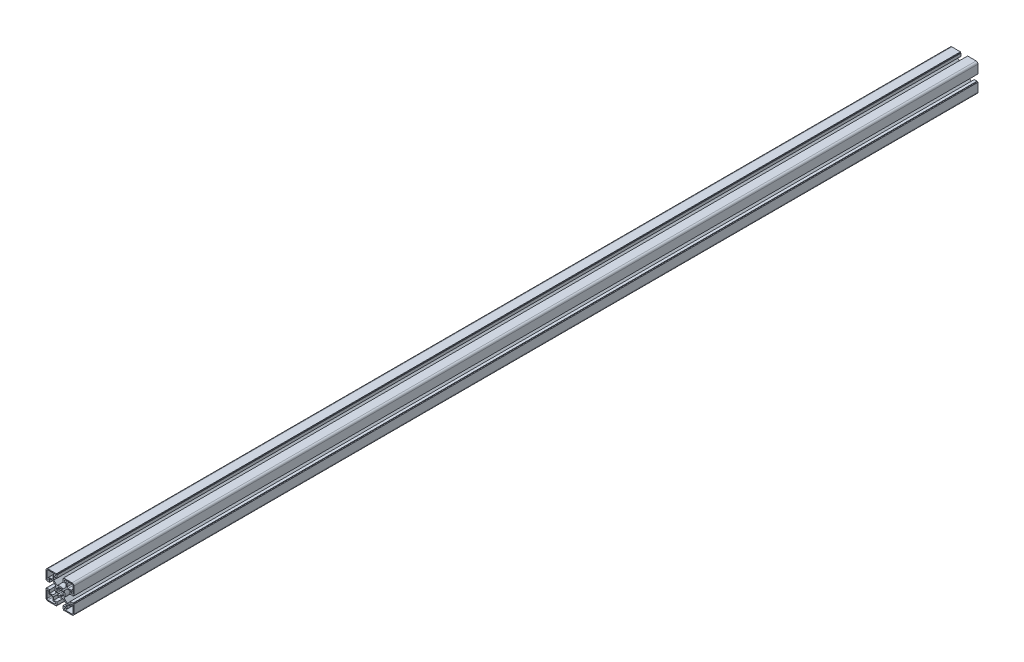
ISO-10303-21;
HEADER;
FILE_DESCRIPTION(('STEP AP214'),'2;1');
FILE_NAME('part.step','',(''),(''),'','','');
FILE_SCHEMA(('AUTOMOTIVE_DESIGN { 1 0 10303 214 1 1 1 1 }'));
ENDSEC;
DATA;
#1=APPLICATION_CONTEXT('core data for automotive mechanical design processes');
#2=APPLICATION_PROTOCOL_DEFINITION('international standard','automotive_design',2000,#1);
#3=PRODUCT_CONTEXT('',#1,'mechanical');
#4=PRODUCT('Part','Part','',(#3));
#5=PRODUCT_RELATED_PRODUCT_CATEGORY('part','',(#4));
#6=PRODUCT_DEFINITION_FORMATION('','',#4);
#7=PRODUCT_DEFINITION_CONTEXT('part definition',#1,'design');
#8=PRODUCT_DEFINITION('design','',#6,#7);
#9=PRODUCT_DEFINITION_SHAPE('','',#8);
#10=(LENGTH_UNIT() NAMED_UNIT(*) SI_UNIT(.MILLI.,.METRE.));
#11=(NAMED_UNIT(*) PLANE_ANGLE_UNIT() SI_UNIT($,.RADIAN.));
#12=(NAMED_UNIT(*) SI_UNIT($,.STERADIAN.) SOLID_ANGLE_UNIT());
#13=UNCERTAINTY_MEASURE_WITH_UNIT(LENGTH_MEASURE(1.E-05),#10,'distance_accuracy_value','');
#14=(GEOMETRIC_REPRESENTATION_CONTEXT(3) GLOBAL_UNCERTAINTY_ASSIGNED_CONTEXT((#13)) GLOBAL_UNIT_ASSIGNED_CONTEXT((#10,
#11,#12)) REPRESENTATION_CONTEXT('',''));
#15=CARTESIAN_POINT('',(0.,0.,0.));
#16=DIRECTION('',(0.,0.,1.));
#17=DIRECTION('',(1.,0.,0.));
#18=AXIS2_PLACEMENT_3D('',#15,#16,#17);
#19=CARTESIAN_POINT('',(3.3867561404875,5.06863875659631,1519.45305538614));
#20=DIRECTION('',(-0.831469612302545,0.555570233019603,0.));
#21=DIRECTION('',(-0.555570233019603,-0.831469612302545,0.));
#22=AXIS2_PLACEMENT_3D('',#19,#20,#21);
#23=PLANE('',#22);
#24=DIRECTION('',(0.,0.,-1.));
#25=VECTOR('',#24,1.);
#26=CARTESIAN_POINT('',(2.77996233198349,4.16050764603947,1519.45305538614));
#27=LINE('',#26,#25);
#28=CARTESIAN_POINT('',(2.77996233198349,4.16050764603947,1455.801));
#29=VERTEX_POINT('',#28);
#30=CARTESIAN_POINT('',(2.77996233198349,4.16050764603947,0.));
#31=VERTEX_POINT('',#30);
#32=EDGE_CURVE('E1054',#29,#31,#27,.T.);
#33=ORIENTED_EDGE('',*,*,#32,.F.);
#34=DIRECTION('',(0.555570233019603,0.831469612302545,0.));
#35=VECTOR('',#34,1.);
#36=CARTESIAN_POINT('',(3.38675614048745,5.06863875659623,1455.801));
#37=LINE('',#36,#35);
#38=CARTESIAN_POINT('',(3.3867561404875,5.06863875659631,1455.801));
#39=VERTEX_POINT('',#38);
#40=EDGE_CURVE('E1984',#29,#39,#37,.T.);
#41=ORIENTED_EDGE('',*,*,#40,.T.);
#42=DIRECTION('',(0.,0.,-1.));
#43=VECTOR('',#42,1.);
#44=CARTESIAN_POINT('',(3.3867561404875,5.06863875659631,1519.45305538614));
#45=LINE('',#44,#43);
#46=CARTESIAN_POINT('',(3.3867561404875,5.06863875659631,0.));
#47=VERTEX_POINT('',#46);
#48=EDGE_CURVE('E1052',#39,#47,#45,.T.);
#49=ORIENTED_EDGE('',*,*,#48,.T.);
#50=DIRECTION('',(0.555570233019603,0.831469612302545,0.));
#51=VECTOR('',#50,1.);
#52=CARTESIAN_POINT('',(3.3867561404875,5.06863875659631,0.));
#53=LINE('',#52,#51);
#54=EDGE_CURVE('E1049',#31,#47,#53,.T.);
#55=ORIENTED_EDGE('',*,*,#54,.F.);
#56=EDGE_LOOP('',(#33,#41,#49,#55));
#57=FACE_BOUND('',#56,.T.);
#58=ADVANCED_FACE('F32',(#57),#23,.T.);
#59=CARTESIAN_POINT('',(0.,0.,1519.45305538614));
#60=DIRECTION('',(0.,0.,-1.));
#61=DIRECTION('',(-1.,0.,0.));
#62=AXIS2_PLACEMENT_3D('',#59,#60,#61);
#63=CYLINDRICAL_SURFACE('',#62,5.00379999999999);
#64=DIRECTION('',(0.,0.,-1.));
#65=VECTOR('',#64,1.);
#66=CARTESIAN_POINT('',(4.16050764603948,2.77996233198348,1519.45305538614));
#67=LINE('',#66,#65);
#68=CARTESIAN_POINT('',(4.16050764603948,2.77996233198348,1455.801));
#69=VERTEX_POINT('',#68);
#70=CARTESIAN_POINT('',(4.16050764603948,2.77996233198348,0.));
#71=VERTEX_POINT('',#70);
#72=EDGE_CURVE('E1056',#69,#71,#67,.T.);
#73=ORIENTED_EDGE('',*,*,#72,.F.);
#74=CARTESIAN_POINT('',(0.,0.,1455.801));
#75=DIRECTION('',(0.,0.,1.));
#76=DIRECTION('',(0.,-1.,0.));
#77=AXIS2_PLACEMENT_3D('',#74,#75,#76);
#78=CIRCLE('',#77,5.00379999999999);
#79=EDGE_CURVE('E1987',#69,#29,#78,.T.);
#80=ORIENTED_EDGE('',*,*,#79,.T.);
#81=ORIENTED_EDGE('',*,*,#32,.T.);
#82=CARTESIAN_POINT('',(0.,0.,0.));
#83=DIRECTION('',(0.,0.,1.));
#84=DIRECTION('',(1.,0.,0.));
#85=AXIS2_PLACEMENT_3D('',#82,#83,#84);
#86=CIRCLE('',#85,5.00379999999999);
#87=EDGE_CURVE('E1046',#71,#31,#86,.T.);
#88=ORIENTED_EDGE('',*,*,#87,.F.);
#89=EDGE_LOOP('',(#73,#80,#81,#88));
#90=FACE_BOUND('',#89,.T.);
#91=ADVANCED_FACE('F2385',(#90),#63,.F.);
#92=CARTESIAN_POINT('',(5.06863875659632,3.38675614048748,1519.45305538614));
#93=DIRECTION('',(0.5555702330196,-0.831469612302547,0.));
#94=DIRECTION('',(0.831469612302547,0.5555702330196,0.));
#95=AXIS2_PLACEMENT_3D('',#92,#93,#94);
#96=PLANE('',#95);
#97=DIRECTION('',(0.,0.,-1.));
#98=VECTOR('',#97,1.);
#99=CARTESIAN_POINT('',(5.06863875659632,3.38675614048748,1519.45305538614));
#100=LINE('',#99,#98);
#101=CARTESIAN_POINT('',(5.06863875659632,3.38675614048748,1455.801));
#102=VERTEX_POINT('',#101);
#103=CARTESIAN_POINT('',(5.06863875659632,3.38675614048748,0.));
#104=VERTEX_POINT('',#103);
#105=EDGE_CURVE('E1058',#102,#104,#100,.T.);
#106=ORIENTED_EDGE('',*,*,#105,.F.);
#107=DIRECTION('',(-0.831469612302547,-0.5555702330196,0.));
#108=VECTOR('',#107,1.);
#109=CARTESIAN_POINT('',(5.06863875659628,3.38675614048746,1455.801));
#110=LINE('',#109,#108);
#111=EDGE_CURVE('E1990',#102,#69,#110,.T.);
#112=ORIENTED_EDGE('',*,*,#111,.T.);
#113=ORIENTED_EDGE('',*,*,#72,.T.);
#114=DIRECTION('',(-0.831469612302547,-0.5555702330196,0.));
#115=VECTOR('',#114,1.);
#116=CARTESIAN_POINT('',(5.06863875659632,3.38675614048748,0.));
#117=LINE('',#116,#115);
#118=EDGE_CURVE('E1043',#104,#71,#117,.T.);
#119=ORIENTED_EDGE('',*,*,#118,.F.);
#120=EDGE_LOOP('',(#106,#112,#113,#119));
#121=FACE_BOUND('',#120,.T.);
#122=ADVANCED_FACE('F2381',(#121),#96,.T.);
#123=CARTESIAN_POINT('',(0.,0.,1519.45305538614));
#124=DIRECTION('',(0.,0.,-1.));
#125=DIRECTION('',(-1.,0.,0.));
#126=AXIS2_PLACEMENT_3D('',#123,#124,#125);
#127=CYLINDRICAL_SURFACE('',#126,6.09599999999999);
#128=DIRECTION('',(0.,0.,-1.));
#129=VECTOR('',#128,1.);
#130=CARTESIAN_POINT('',(5.9788670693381,1.1892706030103,1519.45305538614));
#131=LINE('',#130,#129);
#132=CARTESIAN_POINT('',(5.9788670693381,1.1892706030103,1455.801));
#133=VERTEX_POINT('',#132);
#134=CARTESIAN_POINT('',(5.9788670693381,1.1892706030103,0.));
#135=VERTEX_POINT('',#134);
#136=EDGE_CURVE('E1060',#133,#135,#131,.T.);
#137=ORIENTED_EDGE('',*,*,#136,.F.);
#138=CARTESIAN_POINT('',(0.,0.,1455.801));
#139=DIRECTION('',(0.,0.,1.));
#140=DIRECTION('',(0.,-1.,0.));
#141=AXIS2_PLACEMENT_3D('',#138,#139,#140);
#142=CIRCLE('',#141,6.09599999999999);
#143=EDGE_CURVE('E1993',#133,#102,#142,.T.);
#144=ORIENTED_EDGE('',*,*,#143,.T.);
#145=ORIENTED_EDGE('',*,*,#105,.T.);
#146=CARTESIAN_POINT('',(0.,0.,0.));
#147=DIRECTION('',(0.,0.,1.));
#148=DIRECTION('',(1.,0.,0.));
#149=AXIS2_PLACEMENT_3D('',#146,#147,#148);
#150=CIRCLE('',#149,6.09599999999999);
#151=EDGE_CURVE('E1040',#135,#104,#150,.T.);
#152=ORIENTED_EDGE('',*,*,#151,.F.);
#153=EDGE_LOOP('',(#137,#144,#145,#152));
#154=FACE_BOUND('',#153,.T.);
#155=ADVANCED_FACE('F2377',(#154),#127,.F.);
#156=CARTESIAN_POINT('',(5.9788670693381,1.1892706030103,1519.45305538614));
#157=DIRECTION('',(-0.195090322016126,0.980785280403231,0.));
#158=DIRECTION('',(-0.980785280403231,-0.195090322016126,0.));
#159=AXIS2_PLACEMENT_3D('',#156,#157,#158);
#160=PLANE('',#159);
#161=DIRECTION('',(0.,0.,-1.));
#162=VECTOR('',#161,1.);
#163=CARTESIAN_POINT('',(4.90765338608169,0.976192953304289,1519.45305538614));
#164=LINE('',#163,#162);
#165=CARTESIAN_POINT('',(4.90765338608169,0.976192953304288,1455.801));
#166=VERTEX_POINT('',#165);
#167=CARTESIAN_POINT('',(4.90765338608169,0.976192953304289,0.));
#168=VERTEX_POINT('',#167);
#169=EDGE_CURVE('E1062',#166,#168,#164,.T.);
#170=ORIENTED_EDGE('',*,*,#169,.F.);
#171=DIRECTION('',(0.980785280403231,0.195090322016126,0.));
#172=VECTOR('',#171,1.);
#173=CARTESIAN_POINT('',(5.97886706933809,1.1892706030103,1455.801));
#174=LINE('',#173,#172);
#175=EDGE_CURVE('E1996',#166,#133,#174,.T.);
#176=ORIENTED_EDGE('',*,*,#175,.T.);
#177=ORIENTED_EDGE('',*,*,#136,.T.);
#178=DIRECTION('',(0.980785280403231,0.195090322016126,0.));
#179=VECTOR('',#178,1.);
#180=CARTESIAN_POINT('',(5.9788670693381,1.1892706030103,0.));
#181=LINE('',#180,#179);
#182=EDGE_CURVE('E1037',#168,#135,#181,.T.);
#183=ORIENTED_EDGE('',*,*,#182,.F.);
#184=EDGE_LOOP('',(#170,#176,#177,#183));
#185=FACE_BOUND('',#184,.T.);
#186=ADVANCED_FACE('F2374',(#185),#160,.T.);
#187=CARTESIAN_POINT('',(0.,0.,1519.45305538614));
#188=DIRECTION('',(0.,0.,-1.));
#189=DIRECTION('',(-1.,0.,0.));
#190=AXIS2_PLACEMENT_3D('',#187,#188,#189);
#191=CYLINDRICAL_SURFACE('',#190,5.00379999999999);
#192=DIRECTION('',(0.,0.,-1.));
#193=VECTOR('',#192,1.);
#194=CARTESIAN_POINT('',(4.90765338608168,-0.97619295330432,1519.45305538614));
#195=LINE('',#194,#193);
#196=CARTESIAN_POINT('',(4.90765338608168,-0.976192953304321,1455.801));
#197=VERTEX_POINT('',#196);
#198=CARTESIAN_POINT('',(4.90765338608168,-0.97619295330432,0.));
#199=VERTEX_POINT('',#198);
#200=EDGE_CURVE('E1064',#197,#199,#195,.T.);
#201=ORIENTED_EDGE('',*,*,#200,.F.);
#202=CARTESIAN_POINT('',(0.,0.,1455.801));
#203=DIRECTION('',(0.,0.,1.));
#204=DIRECTION('',(0.,-1.,0.));
#205=AXIS2_PLACEMENT_3D('',#202,#203,#204);
#206=CIRCLE('',#205,5.00379999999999);
#207=EDGE_CURVE('E1999',#197,#166,#206,.T.);
#208=ORIENTED_EDGE('',*,*,#207,.T.);
#209=ORIENTED_EDGE('',*,*,#169,.T.);
#210=CARTESIAN_POINT('',(0.,0.,0.));
#211=DIRECTION('',(0.,0.,1.));
#212=DIRECTION('',(1.,0.,0.));
#213=AXIS2_PLACEMENT_3D('',#210,#211,#212);
#214=CIRCLE('',#213,5.00379999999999);
#215=EDGE_CURVE('E1034',#199,#168,#214,.T.);
#216=ORIENTED_EDGE('',*,*,#215,.F.);
#217=EDGE_LOOP('',(#201,#208,#209,#216));
#218=FACE_BOUND('',#217,.T.);
#219=ADVANCED_FACE('F2369',(#218),#191,.F.);
#220=CARTESIAN_POINT('',(5.97886706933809,-1.18927060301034,1519.45305538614));
#221=DIRECTION('',(-0.195090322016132,-0.98078528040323,0.));
#222=DIRECTION('',(0.98078528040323,-0.195090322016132,0.));
#223=AXIS2_PLACEMENT_3D('',#220,#221,#222);
#224=PLANE('',#223);
#225=DIRECTION('',(0.,0.,-1.));
#226=VECTOR('',#225,1.);
#227=CARTESIAN_POINT('',(5.97886706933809,-1.18927060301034,1519.45305538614));
#228=LINE('',#227,#226);
#229=CARTESIAN_POINT('',(5.97886706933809,-1.18927060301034,1455.801));
#230=VERTEX_POINT('',#229);
#231=CARTESIAN_POINT('',(5.97886706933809,-1.18927060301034,0.));
#232=VERTEX_POINT('',#231);
#233=EDGE_CURVE('E1066',#230,#232,#228,.T.);
#234=ORIENTED_EDGE('',*,*,#233,.F.);
#235=DIRECTION('',(-0.98078528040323,0.195090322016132,0.));
#236=VECTOR('',#235,1.);
#237=CARTESIAN_POINT('',(5.97886706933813,-1.18927060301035,1455.801));
#238=LINE('',#237,#236);
#239=EDGE_CURVE('E2002',#230,#197,#238,.T.);
#240=ORIENTED_EDGE('',*,*,#239,.T.);
#241=ORIENTED_EDGE('',*,*,#200,.T.);
#242=DIRECTION('',(-0.98078528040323,0.195090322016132,0.));
#243=VECTOR('',#242,1.);
#244=CARTESIAN_POINT('',(5.97886706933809,-1.18927060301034,0.));
#245=LINE('',#244,#243);
#246=EDGE_CURVE('E1031',#232,#199,#245,.T.);
#247=ORIENTED_EDGE('',*,*,#246,.F.);
#248=EDGE_LOOP('',(#234,#240,#241,#247));
#249=FACE_BOUND('',#248,.T.);
#250=ADVANCED_FACE('F2365',(#249),#224,.T.);
#251=CARTESIAN_POINT('',(0.,0.,1519.45305538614));
#252=DIRECTION('',(0.,0.,-1.));
#253=DIRECTION('',(-1.,0.,0.));
#254=AXIS2_PLACEMENT_3D('',#251,#252,#253);
#255=CYLINDRICAL_SURFACE('',#254,6.09599999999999);
#256=DIRECTION('',(0.,0.,-1.));
#257=VECTOR('',#256,1.);
#258=CARTESIAN_POINT('',(5.0686387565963,-3.38675614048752,1519.45305538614));
#259=LINE('',#258,#257);
#260=CARTESIAN_POINT('',(5.0686387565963,-3.38675614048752,1455.801));
#261=VERTEX_POINT('',#260);
#262=CARTESIAN_POINT('',(5.0686387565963,-3.38675614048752,0.));
#263=VERTEX_POINT('',#262);
#264=EDGE_CURVE('E1068',#261,#263,#259,.T.);
#265=ORIENTED_EDGE('',*,*,#264,.F.);
#266=CARTESIAN_POINT('',(0.,0.,1455.801));
#267=DIRECTION('',(0.,0.,1.));
#268=DIRECTION('',(0.,-1.,0.));
#269=AXIS2_PLACEMENT_3D('',#266,#267,#268);
#270=CIRCLE('',#269,6.09599999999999);
#271=EDGE_CURVE('E2005',#261,#230,#270,.T.);
#272=ORIENTED_EDGE('',*,*,#271,.T.);
#273=ORIENTED_EDGE('',*,*,#233,.T.);
#274=CARTESIAN_POINT('',(0.,0.,0.));
#275=DIRECTION('',(0.,0.,1.));
#276=DIRECTION('',(1.,0.,0.));
#277=AXIS2_PLACEMENT_3D('',#274,#275,#276);
#278=CIRCLE('',#277,6.09599999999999);
#279=EDGE_CURVE('E1028',#263,#232,#278,.T.);
#280=ORIENTED_EDGE('',*,*,#279,.F.);
#281=EDGE_LOOP('',(#265,#272,#273,#280));
#282=FACE_BOUND('',#281,.T.);
#283=ADVANCED_FACE('F2362',(#282),#255,.F.);
#284=CARTESIAN_POINT('',(5.0686387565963,-3.38675614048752,1519.45305538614));
#285=DIRECTION('',(0.555570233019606,0.831469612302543,0.));
#286=DIRECTION('',(-0.831469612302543,0.555570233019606,0.));
#287=AXIS2_PLACEMENT_3D('',#284,#285,#286);
#288=PLANE('',#287);
#289=DIRECTION('',(0.,0.,-1.));
#290=VECTOR('',#289,1.);
#291=CARTESIAN_POINT('',(4.16050764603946,-2.7799623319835,1519.45305538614));
#292=LINE('',#291,#290);
#293=CARTESIAN_POINT('',(4.16050764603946,-2.77996233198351,1455.801));
#294=VERTEX_POINT('',#293);
#295=CARTESIAN_POINT('',(4.16050764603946,-2.7799623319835,0.));
#296=VERTEX_POINT('',#295);
#297=EDGE_CURVE('E1070',#294,#296,#292,.T.);
#298=ORIENTED_EDGE('',*,*,#297,.F.);
#299=DIRECTION('',(0.831469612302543,-0.555570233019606,0.));
#300=VECTOR('',#299,1.);
#301=CARTESIAN_POINT('',(5.06863875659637,-3.38675614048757,1455.801));
#302=LINE('',#301,#300);
#303=EDGE_CURVE('E2008',#294,#261,#302,.T.);
#304=ORIENTED_EDGE('',*,*,#303,.T.);
#305=ORIENTED_EDGE('',*,*,#264,.T.);
#306=DIRECTION('',(0.831469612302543,-0.555570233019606,0.));
#307=VECTOR('',#306,1.);
#308=CARTESIAN_POINT('',(5.0686387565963,-3.38675614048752,0.));
#309=LINE('',#308,#307);
#310=EDGE_CURVE('E1025',#296,#263,#309,.T.);
#311=ORIENTED_EDGE('',*,*,#310,.F.);
#312=EDGE_LOOP('',(#298,#304,#305,#311));
#313=FACE_BOUND('',#312,.T.);
#314=ADVANCED_FACE('F2357',(#313),#288,.T.);
#315=CARTESIAN_POINT('',(0.,0.,1519.45305538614));
#316=DIRECTION('',(0.,0.,-1.));
#317=DIRECTION('',(-1.,0.,0.));
#318=AXIS2_PLACEMENT_3D('',#315,#316,#317);
#319=CYLINDRICAL_SURFACE('',#318,5.00379999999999);
#320=DIRECTION('',(0.,0.,-1.));
#321=VECTOR('',#320,1.);
#322=CARTESIAN_POINT('',(2.77996233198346,-4.16050764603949,1519.45305538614));
#323=LINE('',#322,#321);
#324=CARTESIAN_POINT('',(2.77996233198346,-4.16050764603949,1455.801));
#325=VERTEX_POINT('',#324);
#326=CARTESIAN_POINT('',(2.77996233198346,-4.16050764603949,0.));
#327=VERTEX_POINT('',#326);
#328=EDGE_CURVE('E1072',#325,#327,#323,.T.);
#329=ORIENTED_EDGE('',*,*,#328,.F.);
#330=CARTESIAN_POINT('',(0.,0.,1455.801));
#331=DIRECTION('',(0.,0.,1.));
#332=DIRECTION('',(0.,-1.,0.));
#333=AXIS2_PLACEMENT_3D('',#330,#331,#332);
#334=CIRCLE('',#333,5.00379999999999);
#335=EDGE_CURVE('E2011',#325,#294,#334,.T.);
#336=ORIENTED_EDGE('',*,*,#335,.T.);
#337=ORIENTED_EDGE('',*,*,#297,.T.);
#338=CARTESIAN_POINT('',(0.,0.,0.));
#339=DIRECTION('',(0.,0.,1.));
#340=DIRECTION('',(1.,0.,0.));
#341=AXIS2_PLACEMENT_3D('',#338,#339,#340);
#342=CIRCLE('',#341,5.00379999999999);
#343=EDGE_CURVE('E1022',#327,#296,#342,.T.);
#344=ORIENTED_EDGE('',*,*,#343,.F.);
#345=EDGE_LOOP('',(#329,#336,#337,#344));
#346=FACE_BOUND('',#345,.T.);
#347=ADVANCED_FACE('F2353',(#346),#319,.F.);
#348=CARTESIAN_POINT('',(3.38675614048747,-5.06863875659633,1519.45305538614));
#349=DIRECTION('',(-0.831469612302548,-0.555570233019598,0.));
#350=DIRECTION('',(0.555570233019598,-0.831469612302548,0.));
#351=AXIS2_PLACEMENT_3D('',#348,#349,#350);
#352=PLANE('',#351);
#353=DIRECTION('',(0.,0.,-1.));
#354=VECTOR('',#353,1.);
#355=CARTESIAN_POINT('',(3.38675614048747,-5.06863875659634,1519.45305538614));
#356=LINE('',#355,#354);
#357=CARTESIAN_POINT('',(3.38675614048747,-5.06863875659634,1455.801));
#358=VERTEX_POINT('',#357);
#359=CARTESIAN_POINT('',(3.38675614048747,-5.06863875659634,0.));
#360=VERTEX_POINT('',#359);
#361=EDGE_CURVE('E1074',#358,#360,#356,.T.);
#362=ORIENTED_EDGE('',*,*,#361,.F.);
#363=DIRECTION('',(-0.555570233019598,0.831469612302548,0.));
#364=VECTOR('',#363,1.);
#365=CARTESIAN_POINT('',(3.38675614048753,-5.06863875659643,1455.801));
#366=LINE('',#365,#364);
#367=EDGE_CURVE('E2014',#358,#325,#366,.T.);
#368=ORIENTED_EDGE('',*,*,#367,.T.);
#369=ORIENTED_EDGE('',*,*,#328,.T.);
#370=DIRECTION('',(-0.555570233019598,0.831469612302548,0.));
#371=VECTOR('',#370,1.);
#372=CARTESIAN_POINT('',(3.38675614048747,-5.06863875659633,0.));
#373=LINE('',#372,#371);
#374=EDGE_CURVE('E1019',#360,#327,#373,.T.);
#375=ORIENTED_EDGE('',*,*,#374,.F.);
#376=EDGE_LOOP('',(#362,#368,#369,#375));
#377=FACE_BOUND('',#376,.T.);
#378=ADVANCED_FACE('F2350',(#377),#352,.T.);
#379=CARTESIAN_POINT('',(0.,0.,1519.45305538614));
#380=DIRECTION('',(0.,0.,-1.));
#381=DIRECTION('',(-1.,0.,0.));
#382=AXIS2_PLACEMENT_3D('',#379,#380,#381);
#383=CYLINDRICAL_SURFACE('',#382,6.096);
#384=DIRECTION('',(0.,0.,-1.));
#385=VECTOR('',#384,1.);
#386=CARTESIAN_POINT('',(1.18927060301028,-5.9788670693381,1519.45305538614));
#387=LINE('',#386,#385);
#388=CARTESIAN_POINT('',(1.18927060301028,-5.9788670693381,1455.801));
#389=VERTEX_POINT('',#388);
#390=CARTESIAN_POINT('',(1.18927060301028,-5.9788670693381,0.));
#391=VERTEX_POINT('',#390);
#392=EDGE_CURVE('E1076',#389,#391,#387,.T.);
#393=ORIENTED_EDGE('',*,*,#392,.F.);
#394=CARTESIAN_POINT('',(0.,0.,1455.801));
#395=DIRECTION('',(0.,0.,1.));
#396=DIRECTION('',(0.,-1.,0.));
#397=AXIS2_PLACEMENT_3D('',#394,#395,#396);
#398=CIRCLE('',#397,6.096);
#399=EDGE_CURVE('E2017',#389,#358,#398,.T.);
#400=ORIENTED_EDGE('',*,*,#399,.T.);
#401=ORIENTED_EDGE('',*,*,#361,.T.);
#402=CARTESIAN_POINT('',(0.,0.,0.));
#403=DIRECTION('',(0.,0.,1.));
#404=DIRECTION('',(1.,0.,0.));
#405=AXIS2_PLACEMENT_3D('',#402,#403,#404);
#406=CIRCLE('',#405,6.096);
#407=EDGE_CURVE('E1016',#391,#360,#406,.T.);
#408=ORIENTED_EDGE('',*,*,#407,.F.);
#409=EDGE_LOOP('',(#393,#400,#401,#408));
#410=FACE_BOUND('',#409,.T.);
#411=ADVANCED_FACE('F2345',(#410),#383,.F.);
#412=CARTESIAN_POINT('',(1.18927060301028,-5.9788670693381,1519.45305538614));
#413=DIRECTION('',(0.980785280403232,0.195090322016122,0.));
#414=DIRECTION('',(-0.195090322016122,0.980785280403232,0.));
#415=AXIS2_PLACEMENT_3D('',#412,#413,#414);
#416=PLANE('',#415);
#417=DIRECTION('',(0.,0.,-1.));
#418=VECTOR('',#417,1.);
#419=CARTESIAN_POINT('',(0.97619295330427,-4.90765338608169,1519.45305538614));
#420=LINE('',#419,#418);
#421=CARTESIAN_POINT('',(0.976192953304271,-4.90765338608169,1455.801));
#422=VERTEX_POINT('',#421);
#423=CARTESIAN_POINT('',(0.97619295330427,-4.90765338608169,0.));
#424=VERTEX_POINT('',#423);
#425=EDGE_CURVE('E1078',#422,#424,#420,.T.);
#426=ORIENTED_EDGE('',*,*,#425,.F.);
#427=DIRECTION('',(0.195090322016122,-0.980785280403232,0.));
#428=VECTOR('',#427,1.);
#429=CARTESIAN_POINT('',(1.18927060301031,-5.97886706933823,1455.801));
#430=LINE('',#429,#428);
#431=EDGE_CURVE('E2020',#422,#389,#430,.T.);
#432=ORIENTED_EDGE('',*,*,#431,.T.);
#433=ORIENTED_EDGE('',*,*,#392,.T.);
#434=DIRECTION('',(0.195090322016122,-0.980785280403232,0.));
#435=VECTOR('',#434,1.);
#436=CARTESIAN_POINT('',(1.18927060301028,-5.9788670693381,0.));
#437=LINE('',#436,#435);
#438=EDGE_CURVE('E1013',#424,#391,#437,.T.);
#439=ORIENTED_EDGE('',*,*,#438,.F.);
#440=EDGE_LOOP('',(#426,#432,#433,#439));
#441=FACE_BOUND('',#440,.T.);
#442=ADVANCED_FACE('F2341',(#441),#416,.T.);
#443=CARTESIAN_POINT('',(0.,0.,1519.45305538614));
#444=DIRECTION('',(0.,0.,-1.));
#445=DIRECTION('',(-1.,0.,0.));
#446=AXIS2_PLACEMENT_3D('',#443,#444,#445);
#447=CYLINDRICAL_SURFACE('',#446,5.0038);
#448=DIRECTION('',(0.,0.,-1.));
#449=VECTOR('',#448,1.);
#450=CARTESIAN_POINT('',(-0.976192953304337,-4.90765338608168,1519.45305538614));
#451=LINE('',#450,#449);
#452=CARTESIAN_POINT('',(-0.976192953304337,-4.90765338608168,1455.801));
#453=VERTEX_POINT('',#452);
#454=CARTESIAN_POINT('',(-0.976192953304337,-4.90765338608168,0.));
#455=VERTEX_POINT('',#454);
#456=EDGE_CURVE('E1080',#453,#455,#451,.T.);
#457=ORIENTED_EDGE('',*,*,#456,.F.);
#458=CARTESIAN_POINT('',(0.,0.,1455.801));
#459=DIRECTION('',(0.,0.,1.));
#460=DIRECTION('',(0.,-1.,0.));
#461=AXIS2_PLACEMENT_3D('',#458,#459,#460);
#462=CIRCLE('',#461,5.0038);
#463=EDGE_CURVE('E2023',#453,#422,#462,.T.);
#464=ORIENTED_EDGE('',*,*,#463,.T.);
#465=ORIENTED_EDGE('',*,*,#425,.T.);
#466=CARTESIAN_POINT('',(0.,0.,0.));
#467=DIRECTION('',(0.,0.,1.));
#468=DIRECTION('',(1.,0.,0.));
#469=AXIS2_PLACEMENT_3D('',#466,#467,#468);
#470=CIRCLE('',#469,5.0038);
#471=EDGE_CURVE('E1010',#455,#424,#470,.T.);
#472=ORIENTED_EDGE('',*,*,#471,.F.);
#473=EDGE_LOOP('',(#457,#464,#465,#472));
#474=FACE_BOUND('',#473,.T.);
#475=ADVANCED_FACE('F2338',(#474),#447,.F.);
#476=CARTESIAN_POINT('',(-1.18927060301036,-5.97886706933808,1519.45305538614));
#477=DIRECTION('',(-0.980785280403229,0.195090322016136,0.));
#478=DIRECTION('',(-0.195090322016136,-0.980785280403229,0.));
#479=AXIS2_PLACEMENT_3D('',#476,#477,#478);
#480=PLANE('',#479);
#481=DIRECTION('',(0.,0.,-1.));
#482=VECTOR('',#481,1.);
#483=CARTESIAN_POINT('',(-1.18927060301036,-5.97886706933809,1519.45305538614));
#484=LINE('',#483,#482);
#485=CARTESIAN_POINT('',(-1.18927060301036,-5.97886706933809,1455.801));
#486=VERTEX_POINT('',#485);
#487=CARTESIAN_POINT('',(-1.18927060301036,-5.97886706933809,0.));
#488=VERTEX_POINT('',#487);
#489=EDGE_CURVE('E1082',#486,#488,#484,.T.);
#490=ORIENTED_EDGE('',*,*,#489,.F.);
#491=DIRECTION('',(0.195090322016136,0.980785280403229,0.));
#492=VECTOR('',#491,1.);
#493=CARTESIAN_POINT('',(-1.18927060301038,-5.9788670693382,1455.801));
#494=LINE('',#493,#492);
#495=EDGE_CURVE('E2026',#486,#453,#494,.T.);
#496=ORIENTED_EDGE('',*,*,#495,.T.);
#497=ORIENTED_EDGE('',*,*,#456,.T.);
#498=DIRECTION('',(0.195090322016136,0.980785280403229,0.));
#499=VECTOR('',#498,1.);
#500=CARTESIAN_POINT('',(-1.18927060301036,-5.97886706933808,0.));
#501=LINE('',#500,#499);
#502=EDGE_CURVE('E1007',#488,#455,#501,.T.);
#503=ORIENTED_EDGE('',*,*,#502,.F.);
#504=EDGE_LOOP('',(#490,#496,#497,#503));
#505=FACE_BOUND('',#504,.T.);
#506=ADVANCED_FACE('F2333',(#505),#480,.T.);
#507=CARTESIAN_POINT('',(0.,0.,1519.45305538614));
#508=DIRECTION('',(0.,0.,-1.));
#509=DIRECTION('',(-1.,0.,0.));
#510=AXIS2_PLACEMENT_3D('',#507,#508,#509);
#511=CYLINDRICAL_SURFACE('',#510,6.096);
#512=DIRECTION('',(0.,0.,-1.));
#513=VECTOR('',#512,1.);
#514=CARTESIAN_POINT('',(-3.38675614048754,-5.06863875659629,1519.45305538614));
#515=LINE('',#514,#513);
#516=CARTESIAN_POINT('',(-3.38675614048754,-5.06863875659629,1455.801));
#517=VERTEX_POINT('',#516);
#518=CARTESIAN_POINT('',(-3.38675614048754,-5.06863875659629,0.));
#519=VERTEX_POINT('',#518);
#520=EDGE_CURVE('E1084',#517,#519,#515,.T.);
#521=ORIENTED_EDGE('',*,*,#520,.F.);
#522=CARTESIAN_POINT('',(0.,0.,1455.801));
#523=DIRECTION('',(0.,0.,1.));
#524=DIRECTION('',(0.,-1.,0.));
#525=AXIS2_PLACEMENT_3D('',#522,#523,#524);
#526=CIRCLE('',#525,6.096);
#527=EDGE_CURVE('E2029',#517,#486,#526,.T.);
#528=ORIENTED_EDGE('',*,*,#527,.T.);
#529=ORIENTED_EDGE('',*,*,#489,.T.);
#530=CARTESIAN_POINT('',(0.,0.,0.));
#531=DIRECTION('',(0.,0.,1.));
#532=DIRECTION('',(1.,0.,0.));
#533=AXIS2_PLACEMENT_3D('',#530,#531,#532);
#534=CIRCLE('',#533,6.096);
#535=EDGE_CURVE('E1004',#519,#488,#534,.T.);
#536=ORIENTED_EDGE('',*,*,#535,.F.);
#537=EDGE_LOOP('',(#521,#528,#529,#536));
#538=FACE_BOUND('',#537,.T.);
#539=ADVANCED_FACE('F2329',(#538),#511,.F.);
#540=CARTESIAN_POINT('',(-3.38675614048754,-5.06863875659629,1519.45305538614));
#541=DIRECTION('',(0.831469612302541,-0.555570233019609,0.));
#542=DIRECTION('',(0.555570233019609,0.831469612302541,0.));
#543=AXIS2_PLACEMENT_3D('',#540,#541,#542);
#544=PLANE('',#543);
#545=DIRECTION('',(0.,0.,-1.));
#546=VECTOR('',#545,1.);
#547=CARTESIAN_POINT('',(-2.77996233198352,-4.16050764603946,1519.45305538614));
#548=LINE('',#547,#546);
#549=CARTESIAN_POINT('',(-2.77996233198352,-4.16050764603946,1455.801));
#550=VERTEX_POINT('',#549);
#551=CARTESIAN_POINT('',(-2.77996233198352,-4.16050764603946,0.));
#552=VERTEX_POINT('',#551);
#553=EDGE_CURVE('E1086',#550,#552,#548,.T.);
#554=ORIENTED_EDGE('',*,*,#553,.F.);
#555=DIRECTION('',(-0.555570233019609,-0.831469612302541,0.));
#556=VECTOR('',#555,1.);
#557=CARTESIAN_POINT('',(-3.38675614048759,-5.06863875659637,1455.801));
#558=LINE('',#557,#556);
#559=EDGE_CURVE('E2032',#550,#517,#558,.T.);
#560=ORIENTED_EDGE('',*,*,#559,.T.);
#561=ORIENTED_EDGE('',*,*,#520,.T.);
#562=DIRECTION('',(-0.555570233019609,-0.831469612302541,0.));
#563=VECTOR('',#562,1.);
#564=CARTESIAN_POINT('',(-3.38675614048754,-5.06863875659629,0.));
#565=LINE('',#564,#563);
#566=EDGE_CURVE('E1001',#552,#519,#565,.T.);
#567=ORIENTED_EDGE('',*,*,#566,.F.);
#568=EDGE_LOOP('',(#554,#560,#561,#567));
#569=FACE_BOUND('',#568,.T.);
#570=ADVANCED_FACE('F2326',(#569),#544,.T.);
#571=CARTESIAN_POINT('',(0.,0.,1519.45305538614));
#572=DIRECTION('',(0.,0.,-1.));
#573=DIRECTION('',(-1.,0.,0.));
#574=AXIS2_PLACEMENT_3D('',#571,#572,#573);
#575=CYLINDRICAL_SURFACE('',#574,5.0038);
#576=DIRECTION('',(0.,0.,-1.));
#577=VECTOR('',#576,1.);
#578=CARTESIAN_POINT('',(-4.1605076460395,-2.77996233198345,1519.45305538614));
#579=LINE('',#578,#577);
#580=CARTESIAN_POINT('',(-4.1605076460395,-2.77996233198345,1455.801));
#581=VERTEX_POINT('',#580);
#582=CARTESIAN_POINT('',(-4.1605076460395,-2.77996233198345,0.));
#583=VERTEX_POINT('',#582);
#584=EDGE_CURVE('E1088',#581,#583,#579,.T.);
#585=ORIENTED_EDGE('',*,*,#584,.F.);
#586=CARTESIAN_POINT('',(0.,0.,1455.801));
#587=DIRECTION('',(0.,0.,1.));
#588=DIRECTION('',(0.,-1.,0.));
#589=AXIS2_PLACEMENT_3D('',#586,#587,#588);
#590=CIRCLE('',#589,5.0038);
#591=EDGE_CURVE('E2035',#581,#550,#590,.T.);
#592=ORIENTED_EDGE('',*,*,#591,.T.);
#593=ORIENTED_EDGE('',*,*,#553,.T.);
#594=CARTESIAN_POINT('',(0.,0.,0.));
#595=DIRECTION('',(0.,0.,1.));
#596=DIRECTION('',(1.,0.,0.));
#597=AXIS2_PLACEMENT_3D('',#594,#595,#596);
#598=CIRCLE('',#597,5.0038);
#599=EDGE_CURVE('E998',#583,#552,#598,.T.);
#600=ORIENTED_EDGE('',*,*,#599,.F.);
#601=EDGE_LOOP('',(#585,#592,#593,#600));
#602=FACE_BOUND('',#601,.T.);
#603=ADVANCED_FACE('F2321',(#602),#575,.F.);
#604=CARTESIAN_POINT('',(-5.06863875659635,-3.38675614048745,1519.45305538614));
#605=DIRECTION('',(-0.555570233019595,0.83146961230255,0.));
#606=DIRECTION('',(-0.831469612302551,-0.555570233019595,0.));
#607=AXIS2_PLACEMENT_3D('',#604,#605,#606);
#608=PLANE('',#607);
#609=DIRECTION('',(0.,0.,-1.));
#610=VECTOR('',#609,1.);
#611=CARTESIAN_POINT('',(-5.06863875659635,-3.38675614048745,1519.45305538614));
#612=LINE('',#611,#610);
#613=CARTESIAN_POINT('',(-5.06863875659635,-3.38675614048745,1455.801));
#614=VERTEX_POINT('',#613);
#615=CARTESIAN_POINT('',(-5.06863875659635,-3.38675614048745,0.));
#616=VERTEX_POINT('',#615);
#617=EDGE_CURVE('E1090',#614,#616,#612,.T.);
#618=ORIENTED_EDGE('',*,*,#617,.F.);
#619=DIRECTION('',(0.83146961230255,0.555570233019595,0.));
#620=VECTOR('',#619,1.);
#621=CARTESIAN_POINT('',(-5.06863875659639,-3.38675614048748,1455.801));
#622=LINE('',#621,#620);
#623=EDGE_CURVE('E2038',#614,#581,#622,.T.);
#624=ORIENTED_EDGE('',*,*,#623,.T.);
#625=ORIENTED_EDGE('',*,*,#584,.T.);
#626=DIRECTION('',(0.83146961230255,0.555570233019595,0.));
#627=VECTOR('',#626,1.);
#628=CARTESIAN_POINT('',(-5.06863875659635,-3.38675614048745,0.));
#629=LINE('',#628,#627);
#630=EDGE_CURVE('E995',#616,#583,#629,.T.);
#631=ORIENTED_EDGE('',*,*,#630,.F.);
#632=EDGE_LOOP('',(#618,#624,#625,#631));
#633=FACE_BOUND('',#632,.T.);
#634=ADVANCED_FACE('F2317',(#633),#608,.T.);
#635=CARTESIAN_POINT('',(0.,0.,1519.45305538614));
#636=DIRECTION('',(0.,0.,-1.));
#637=DIRECTION('',(-1.,0.,0.));
#638=AXIS2_PLACEMENT_3D('',#635,#636,#637);
#639=CYLINDRICAL_SURFACE('',#638,6.09600000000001);
#640=DIRECTION('',(0.,0.,-1.));
#641=VECTOR('',#640,1.);
#642=CARTESIAN_POINT('',(-5.9788670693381,-1.18927060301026,1519.45305538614));
#643=LINE('',#642,#641);
#644=CARTESIAN_POINT('',(-5.9788670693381,-1.18927060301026,1455.801));
#645=VERTEX_POINT('',#644);
#646=CARTESIAN_POINT('',(-5.9788670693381,-1.18927060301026,0.));
#647=VERTEX_POINT('',#646);
#648=EDGE_CURVE('E1092',#645,#647,#643,.T.);
#649=ORIENTED_EDGE('',*,*,#648,.F.);
#650=CARTESIAN_POINT('',(0.,0.,1455.801));
#651=DIRECTION('',(0.,0.,1.));
#652=DIRECTION('',(0.,-1.,0.));
#653=AXIS2_PLACEMENT_3D('',#650,#651,#652);
#654=CIRCLE('',#653,6.09600000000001);
#655=EDGE_CURVE('E2041',#645,#614,#654,.T.);
#656=ORIENTED_EDGE('',*,*,#655,.T.);
#657=ORIENTED_EDGE('',*,*,#617,.T.);
#658=CARTESIAN_POINT('',(0.,0.,0.));
#659=DIRECTION('',(0.,0.,1.));
#660=DIRECTION('',(1.,0.,0.));
#661=AXIS2_PLACEMENT_3D('',#658,#659,#660);
#662=CIRCLE('',#661,6.09600000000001);
#663=EDGE_CURVE('E992',#647,#616,#662,.T.);
#664=ORIENTED_EDGE('',*,*,#663,.F.);
#665=EDGE_LOOP('',(#649,#656,#657,#664));
#666=FACE_BOUND('',#665,.T.);
#667=ADVANCED_FACE('F2314',(#666),#639,.F.);
#668=CARTESIAN_POINT('',(-5.9788670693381,-1.18927060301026,1519.45305538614));
#669=DIRECTION('',(0.195090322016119,-0.980785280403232,0.));
#670=DIRECTION('',(0.980785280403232,0.195090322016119,0.));
#671=AXIS2_PLACEMENT_3D('',#668,#669,#670);
#672=PLANE('',#671);
#673=DIRECTION('',(0.,0.,-1.));
#674=VECTOR('',#673,1.);
#675=CARTESIAN_POINT('',(-4.9076533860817,-0.976192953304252,1519.45305538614));
#676=LINE('',#675,#674);
#677=CARTESIAN_POINT('',(-4.9076533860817,-0.976192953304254,1455.801));
#678=VERTEX_POINT('',#677);
#679=CARTESIAN_POINT('',(-4.9076533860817,-0.976192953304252,0.));
#680=VERTEX_POINT('',#679);
#681=EDGE_CURVE('E1094',#678,#680,#676,.T.);
#682=ORIENTED_EDGE('',*,*,#681,.F.);
#683=DIRECTION('',(-0.980785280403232,-0.195090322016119,0.));
#684=VECTOR('',#683,1.);
#685=CARTESIAN_POINT('',(-5.97886706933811,-1.18927060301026,1455.801));
#686=LINE('',#685,#684);
#687=EDGE_CURVE('E2044',#678,#645,#686,.T.);
#688=ORIENTED_EDGE('',*,*,#687,.T.);
#689=ORIENTED_EDGE('',*,*,#648,.T.);
#690=DIRECTION('',(-0.980785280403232,-0.195090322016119,0.));
#691=VECTOR('',#690,1.);
#692=CARTESIAN_POINT('',(-5.9788670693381,-1.18927060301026,0.));
#693=LINE('',#692,#691);
#694=EDGE_CURVE('E989',#680,#647,#693,.T.);
#695=ORIENTED_EDGE('',*,*,#694,.F.);
#696=EDGE_LOOP('',(#682,#688,#689,#695));
#697=FACE_BOUND('',#696,.T.);
#698=ADVANCED_FACE('F2309',(#697),#672,.T.);
#699=CARTESIAN_POINT('',(0.,0.,1519.45305538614));
#700=DIRECTION('',(0.,0.,-1.));
#701=DIRECTION('',(-1.,0.,0.));
#702=AXIS2_PLACEMENT_3D('',#699,#700,#701);
#703=CYLINDRICAL_SURFACE('',#702,5.00380000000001);
#704=DIRECTION('',(0.,0.,-1.));
#705=VECTOR('',#704,1.);
#706=CARTESIAN_POINT('',(-4.90765338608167,0.976192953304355,1519.45305538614));
#707=LINE('',#706,#705);
#708=CARTESIAN_POINT('',(-4.90765338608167,0.976192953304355,1455.801));
#709=VERTEX_POINT('',#708);
#710=CARTESIAN_POINT('',(-4.90765338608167,0.976192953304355,0.));
#711=VERTEX_POINT('',#710);
#712=EDGE_CURVE('E1096',#709,#711,#707,.T.);
#713=ORIENTED_EDGE('',*,*,#712,.F.);
#714=CARTESIAN_POINT('',(0.,0.,1455.801));
#715=DIRECTION('',(0.,0.,1.));
#716=DIRECTION('',(0.,-1.,0.));
#717=AXIS2_PLACEMENT_3D('',#714,#715,#716);
#718=CIRCLE('',#717,5.00380000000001);
#719=EDGE_CURVE('E2047',#709,#678,#718,.T.);
#720=ORIENTED_EDGE('',*,*,#719,.T.);
#721=ORIENTED_EDGE('',*,*,#681,.T.);
#722=CARTESIAN_POINT('',(0.,0.,0.));
#723=DIRECTION('',(0.,0.,1.));
#724=DIRECTION('',(1.,0.,0.));
#725=AXIS2_PLACEMENT_3D('',#722,#723,#724);
#726=CIRCLE('',#725,5.00380000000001);
#727=EDGE_CURVE('E986',#711,#680,#726,.T.);
#728=ORIENTED_EDGE('',*,*,#727,.F.);
#729=EDGE_LOOP('',(#713,#720,#721,#728));
#730=FACE_BOUND('',#729,.T.);
#731=ADVANCED_FACE('F2305',(#730),#703,.F.);
#732=CARTESIAN_POINT('',(-5.97886706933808,1.18927060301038,1519.45305538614));
#733=DIRECTION('',(0.195090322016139,0.980785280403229,0.));
#734=DIRECTION('',(-0.980785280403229,0.195090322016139,0.));
#735=AXIS2_PLACEMENT_3D('',#732,#733,#734);
#736=PLANE('',#735);
#737=DIRECTION('',(0.,0.,-1.));
#738=VECTOR('',#737,1.);
#739=CARTESIAN_POINT('',(-5.97886706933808,1.18927060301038,1519.45305538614));
#740=LINE('',#739,#738);
#741=CARTESIAN_POINT('',(-5.97886706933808,1.18927060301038,1455.801));
#742=VERTEX_POINT('',#741);
#743=CARTESIAN_POINT('',(-5.97886706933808,1.18927060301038,0.));
#744=VERTEX_POINT('',#743);
#745=EDGE_CURVE('E1098',#742,#744,#740,.T.);
#746=ORIENTED_EDGE('',*,*,#745,.F.);
#747=DIRECTION('',(0.980785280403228,-0.195090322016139,0.));
#748=VECTOR('',#747,1.);
#749=CARTESIAN_POINT('',(-5.97886706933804,1.18927060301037,1455.801));
#750=LINE('',#749,#748);
#751=EDGE_CURVE('E2050',#742,#709,#750,.T.);
#752=ORIENTED_EDGE('',*,*,#751,.T.);
#753=ORIENTED_EDGE('',*,*,#712,.T.);
#754=DIRECTION('',(0.980785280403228,-0.195090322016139,0.));
#755=VECTOR('',#754,1.);
#756=CARTESIAN_POINT('',(-5.97886706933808,1.18927060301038,0.));
#757=LINE('',#756,#755);
#758=EDGE_CURVE('E983',#744,#711,#757,.T.);
#759=ORIENTED_EDGE('',*,*,#758,.F.);
#760=EDGE_LOOP('',(#746,#752,#753,#759));
#761=FACE_BOUND('',#760,.T.);
#762=ADVANCED_FACE('F2302',(#761),#736,.T.);
#763=CARTESIAN_POINT('',(0.,0.,1519.45305538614));
#764=DIRECTION('',(0.,0.,-1.));
#765=DIRECTION('',(-1.,0.,0.));
#766=AXIS2_PLACEMENT_3D('',#763,#764,#765);
#767=CYLINDRICAL_SURFACE('',#766,6.09600000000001);
#768=DIRECTION('',(0.,0.,-1.));
#769=VECTOR('',#768,1.);
#770=CARTESIAN_POINT('',(-5.06863875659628,3.38675614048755,1519.45305538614));
#771=LINE('',#770,#769);
#772=CARTESIAN_POINT('',(-5.06863875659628,3.38675614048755,1455.801));
#773=VERTEX_POINT('',#772);
#774=CARTESIAN_POINT('',(-5.06863875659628,3.38675614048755,0.));
#775=VERTEX_POINT('',#774);
#776=EDGE_CURVE('E1100',#773,#775,#771,.T.);
#777=ORIENTED_EDGE('',*,*,#776,.F.);
#778=CARTESIAN_POINT('',(0.,0.,1455.801));
#779=DIRECTION('',(0.,0.,1.));
#780=DIRECTION('',(0.,-1.,0.));
#781=AXIS2_PLACEMENT_3D('',#778,#779,#780);
#782=CIRCLE('',#781,6.09600000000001);
#783=EDGE_CURVE('E2053',#773,#742,#782,.T.);
#784=ORIENTED_EDGE('',*,*,#783,.T.);
#785=ORIENTED_EDGE('',*,*,#745,.T.);
#786=CARTESIAN_POINT('',(0.,0.,0.));
#787=DIRECTION('',(0.,0.,1.));
#788=DIRECTION('',(1.,0.,0.));
#789=AXIS2_PLACEMENT_3D('',#786,#787,#788);
#790=CIRCLE('',#789,6.09600000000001);
#791=EDGE_CURVE('E980',#775,#744,#790,.T.);
#792=ORIENTED_EDGE('',*,*,#791,.F.);
#793=EDGE_LOOP('',(#777,#784,#785,#792));
#794=FACE_BOUND('',#793,.T.);
#795=ADVANCED_FACE('F2297',(#794),#767,.F.);
#796=CARTESIAN_POINT('',(-5.06863875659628,3.38675614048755,1519.45305538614));
#797=DIRECTION('',(-0.555570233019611,-0.831469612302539,0.));
#798=DIRECTION('',(0.83146961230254,-0.555570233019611,0.));
#799=AXIS2_PLACEMENT_3D('',#796,#797,#798);
#800=PLANE('',#799);
#801=DIRECTION('',(0.,0.,-1.));
#802=VECTOR('',#801,1.);
#803=CARTESIAN_POINT('',(-4.16050764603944,2.77996233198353,1519.45305538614));
#804=LINE('',#803,#802);
#805=CARTESIAN_POINT('',(-4.16050764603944,2.77996233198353,1455.801));
#806=VERTEX_POINT('',#805);
#807=CARTESIAN_POINT('',(-4.16050764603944,2.77996233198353,0.));
#808=VERTEX_POINT('',#807);
#809=EDGE_CURVE('E1102',#806,#808,#804,.T.);
#810=ORIENTED_EDGE('',*,*,#809,.F.);
#811=DIRECTION('',(-0.831469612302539,0.555570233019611,0.));
#812=VECTOR('',#811,1.);
#813=CARTESIAN_POINT('',(-5.0686387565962,3.3867561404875,1455.801));
#814=LINE('',#813,#812);
#815=EDGE_CURVE('E2056',#806,#773,#814,.T.);
#816=ORIENTED_EDGE('',*,*,#815,.T.);
#817=ORIENTED_EDGE('',*,*,#776,.T.);
#818=DIRECTION('',(-0.831469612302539,0.555570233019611,0.));
#819=VECTOR('',#818,1.);
#820=CARTESIAN_POINT('',(-5.06863875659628,3.38675614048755,0.));
#821=LINE('',#820,#819);
#822=EDGE_CURVE('E977',#808,#775,#821,.T.);
#823=ORIENTED_EDGE('',*,*,#822,.F.);
#824=EDGE_LOOP('',(#810,#816,#817,#823));
#825=FACE_BOUND('',#824,.T.);
#826=ADVANCED_FACE('F2293',(#825),#800,.T.);
#827=CARTESIAN_POINT('',(0.,0.,1519.45305538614));
#828=DIRECTION('',(0.,0.,-1.));
#829=DIRECTION('',(-1.,0.,0.));
#830=AXIS2_PLACEMENT_3D('',#827,#828,#829);
#831=CYLINDRICAL_SURFACE('',#830,5.0038);
#832=DIRECTION('',(0.,0.,-1.));
#833=VECTOR('',#832,1.);
#834=CARTESIAN_POINT('',(-2.77996233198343,4.16050764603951,1519.45305538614));
#835=LINE('',#834,#833);
#836=CARTESIAN_POINT('',(-2.77996233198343,4.16050764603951,1455.801));
#837=VERTEX_POINT('',#836);
#838=CARTESIAN_POINT('',(-2.77996233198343,4.16050764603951,0.));
#839=VERTEX_POINT('',#838);
#840=EDGE_CURVE('E1104',#837,#839,#835,.T.);
#841=ORIENTED_EDGE('',*,*,#840,.F.);
#842=CARTESIAN_POINT('',(0.,0.,1455.801));
#843=DIRECTION('',(0.,0.,1.));
#844=DIRECTION('',(0.,-1.,0.));
#845=AXIS2_PLACEMENT_3D('',#842,#843,#844);
#846=CIRCLE('',#845,5.0038);
#847=EDGE_CURVE('E2059',#837,#806,#846,.T.);
#848=ORIENTED_EDGE('',*,*,#847,.T.);
#849=ORIENTED_EDGE('',*,*,#809,.T.);
#850=CARTESIAN_POINT('',(0.,0.,0.));
#851=DIRECTION('',(0.,0.,1.));
#852=DIRECTION('',(1.,0.,0.));
#853=AXIS2_PLACEMENT_3D('',#850,#851,#852);
#854=CIRCLE('',#853,5.0038);
#855=EDGE_CURVE('E974',#839,#808,#854,.T.);
#856=ORIENTED_EDGE('',*,*,#855,.F.);
#857=EDGE_LOOP('',(#841,#848,#849,#856));
#858=FACE_BOUND('',#857,.T.);
#859=ADVANCED_FACE('F2290',(#858),#831,.F.);
#860=CARTESIAN_POINT('',(-3.38675614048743,5.06863875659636,1519.45305538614));
#861=DIRECTION('',(0.831469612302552,0.555570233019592,0.));
#862=DIRECTION('',(-0.555570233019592,0.831469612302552,0.));
#863=AXIS2_PLACEMENT_3D('',#860,#861,#862);
#864=PLANE('',#863);
#865=DIRECTION('',(0.,0.,-1.));
#866=VECTOR('',#865,1.);
#867=CARTESIAN_POINT('',(-3.38675614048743,5.06863875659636,1519.45305538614));
#868=LINE('',#867,#866);
#869=CARTESIAN_POINT('',(-3.38675614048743,5.06863875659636,1455.801));
#870=VERTEX_POINT('',#869);
#871=CARTESIAN_POINT('',(-3.38675614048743,5.06863875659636,0.));
#872=VERTEX_POINT('',#871);
#873=EDGE_CURVE('E1106',#870,#872,#868,.T.);
#874=ORIENTED_EDGE('',*,*,#873,.F.);
#875=DIRECTION('',(0.555570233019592,-0.831469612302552,0.));
#876=VECTOR('',#875,1.);
#877=CARTESIAN_POINT('',(-3.38675614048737,5.06863875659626,1455.801));
#878=LINE('',#877,#876);
#879=EDGE_CURVE('E2062',#870,#837,#878,.T.);
#880=ORIENTED_EDGE('',*,*,#879,.T.);
#881=ORIENTED_EDGE('',*,*,#840,.T.);
#882=DIRECTION('',(0.555570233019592,-0.831469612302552,0.));
#883=VECTOR('',#882,1.);
#884=CARTESIAN_POINT('',(-3.38675614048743,5.06863875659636,0.));
#885=LINE('',#884,#883);
#886=EDGE_CURVE('E971',#872,#839,#885,.T.);
#887=ORIENTED_EDGE('',*,*,#886,.F.);
#888=EDGE_LOOP('',(#874,#880,#881,#887));
#889=FACE_BOUND('',#888,.T.);
#890=ADVANCED_FACE('F2285',(#889),#864,.T.);
#891=CARTESIAN_POINT('',(0.,0.,1519.45305538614));
#892=DIRECTION('',(0.,0.,-1.));
#893=DIRECTION('',(-1.,0.,0.));
#894=AXIS2_PLACEMENT_3D('',#891,#892,#893);
#895=CYLINDRICAL_SURFACE('',#894,6.096);
#896=DIRECTION('',(0.,0.,-1.));
#897=VECTOR('',#896,1.);
#898=CARTESIAN_POINT('',(-1.18927060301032,5.97886706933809,1519.45305538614));
#899=LINE('',#898,#897);
#900=CARTESIAN_POINT('',(-1.18927060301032,5.97886706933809,1455.801));
#901=VERTEX_POINT('',#900);
#902=CARTESIAN_POINT('',(-1.18927060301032,5.97886706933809,0.));
#903=VERTEX_POINT('',#902);
#904=EDGE_CURVE('E1108',#901,#903,#899,.T.);
#905=ORIENTED_EDGE('',*,*,#904,.F.);
#906=CARTESIAN_POINT('',(0.,0.,1455.801));
#907=DIRECTION('',(0.,0.,1.));
#908=DIRECTION('',(0.,-1.,0.));
#909=AXIS2_PLACEMENT_3D('',#906,#907,#908);
#910=CIRCLE('',#909,6.096);
#911=EDGE_CURVE('E2065',#901,#870,#910,.T.);
#912=ORIENTED_EDGE('',*,*,#911,.T.);
#913=ORIENTED_EDGE('',*,*,#873,.T.);
#914=CARTESIAN_POINT('',(0.,0.,0.));
#915=DIRECTION('',(0.,0.,1.));
#916=DIRECTION('',(1.,0.,0.));
#917=AXIS2_PLACEMENT_3D('',#914,#915,#916);
#918=CIRCLE('',#917,6.096);
#919=EDGE_CURVE('E968',#903,#872,#918,.T.);
#920=ORIENTED_EDGE('',*,*,#919,.F.);
#921=EDGE_LOOP('',(#905,#912,#913,#920));
#922=FACE_BOUND('',#921,.T.);
#923=ADVANCED_FACE('F2281',(#922),#895,.F.);
#924=CARTESIAN_POINT('',(-1.18927060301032,5.97886706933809,1519.45305538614));
#925=DIRECTION('',(-0.98078528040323,-0.195090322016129,0.));
#926=DIRECTION('',(0.195090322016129,-0.98078528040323,0.));
#927=AXIS2_PLACEMENT_3D('',#924,#925,#926);
#928=PLANE('',#927);
#929=DIRECTION('',(0.,0.,-1.));
#930=VECTOR('',#929,1.);
#931=CARTESIAN_POINT('',(-0.976192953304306,4.90765338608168,1519.45305538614));
#932=LINE('',#931,#930);
#933=CARTESIAN_POINT('',(-0.976192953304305,4.90765338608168,1455.801));
#934=VERTEX_POINT('',#933);
#935=CARTESIAN_POINT('',(-0.976192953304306,4.90765338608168,0.));
#936=VERTEX_POINT('',#935);
#937=EDGE_CURVE('E1110',#934,#936,#932,.T.);
#938=ORIENTED_EDGE('',*,*,#937,.F.);
#939=DIRECTION('',(-0.195090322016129,0.98078528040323,0.));
#940=VECTOR('',#939,1.);
#941=CARTESIAN_POINT('',(-1.1892706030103,5.97886706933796,1455.801));
#942=LINE('',#941,#940);
#943=EDGE_CURVE('E2068',#934,#901,#942,.T.);
#944=ORIENTED_EDGE('',*,*,#943,.T.);
#945=ORIENTED_EDGE('',*,*,#904,.T.);
#946=DIRECTION('',(-0.195090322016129,0.98078528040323,0.));
#947=VECTOR('',#946,1.);
#948=CARTESIAN_POINT('',(-1.18927060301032,5.97886706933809,0.));
#949=LINE('',#948,#947);
#950=EDGE_CURVE('E965',#936,#903,#949,.T.);
#951=ORIENTED_EDGE('',*,*,#950,.F.);
#952=EDGE_LOOP('',(#938,#944,#945,#951));
#953=FACE_BOUND('',#952,.T.);
#954=ADVANCED_FACE('F2278',(#953),#928,.T.);
#955=CARTESIAN_POINT('',(0.,0.,1519.45305538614));
#956=DIRECTION('',(0.,0.,-1.));
#957=DIRECTION('',(-1.,0.,0.));
#958=AXIS2_PLACEMENT_3D('',#955,#956,#957);
#959=CYLINDRICAL_SURFACE('',#958,5.0038);
#960=DIRECTION('',(0.,0.,-1.));
#961=VECTOR('',#960,1.);
#962=CARTESIAN_POINT('',(0.976192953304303,4.90765338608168,1519.45305538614));
#963=LINE('',#962,#961);
#964=CARTESIAN_POINT('',(0.976192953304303,4.90765338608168,1455.801));
#965=VERTEX_POINT('',#964);
#966=CARTESIAN_POINT('',(0.976192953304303,4.90765338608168,0.));
#967=VERTEX_POINT('',#966);
#968=EDGE_CURVE('E1112',#965,#967,#963,.T.);
#969=ORIENTED_EDGE('',*,*,#968,.F.);
#970=CARTESIAN_POINT('',(0.,0.,1455.801));
#971=DIRECTION('',(0.,0.,1.));
#972=DIRECTION('',(0.,-1.,0.));
#973=AXIS2_PLACEMENT_3D('',#970,#971,#972);
#974=CIRCLE('',#973,5.0038);
#975=EDGE_CURVE('E2071',#965,#934,#974,.T.);
#976=ORIENTED_EDGE('',*,*,#975,.T.);
#977=ORIENTED_EDGE('',*,*,#937,.T.);
#978=CARTESIAN_POINT('',(0.,0.,0.));
#979=DIRECTION('',(0.,0.,1.));
#980=DIRECTION('',(1.,0.,0.));
#981=AXIS2_PLACEMENT_3D('',#978,#979,#980);
#982=CIRCLE('',#981,5.0038);
#983=EDGE_CURVE('E962',#967,#936,#982,.T.);
#984=ORIENTED_EDGE('',*,*,#983,.F.);
#985=EDGE_LOOP('',(#969,#976,#977,#984));
#986=FACE_BOUND('',#985,.T.);
#987=ADVANCED_FACE('F2273',(#986),#959,.F.);
#988=CARTESIAN_POINT('',(1.18927060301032,5.97886706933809,1519.45305538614));
#989=DIRECTION('',(0.98078528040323,-0.195090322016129,0.));
#990=DIRECTION('',(0.195090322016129,0.98078528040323,0.));
#991=AXIS2_PLACEMENT_3D('',#988,#989,#990);
#992=PLANE('',#991);
#993=DIRECTION('',(0.,0.,-1.));
#994=VECTOR('',#993,1.);
#995=CARTESIAN_POINT('',(1.18927060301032,5.97886706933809,1519.45305538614));
#996=LINE('',#995,#994);
#997=CARTESIAN_POINT('',(1.18927060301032,5.97886706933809,1455.801));
#998=VERTEX_POINT('',#997);
#999=CARTESIAN_POINT('',(1.18927060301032,5.97886706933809,0.));
#1000=VERTEX_POINT('',#999);
#1001=EDGE_CURVE('E1114',#998,#1000,#996,.T.);
#1002=ORIENTED_EDGE('',*,*,#1001,.F.);
#1003=DIRECTION('',(-0.195090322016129,-0.980785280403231,0.));
#1004=VECTOR('',#1003,1.);
#1005=CARTESIAN_POINT('',(1.1892706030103,5.97886706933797,1455.801));
#1006=LINE('',#1005,#1004);
#1007=EDGE_CURVE('E2074',#998,#965,#1006,.T.);
#1008=ORIENTED_EDGE('',*,*,#1007,.T.);
#1009=ORIENTED_EDGE('',*,*,#968,.T.);
#1010=DIRECTION('',(-0.195090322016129,-0.98078528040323,0.));
#1011=VECTOR('',#1010,1.);
#1012=CARTESIAN_POINT('',(1.18927060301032,5.97886706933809,0.));
#1013=LINE('',#1012,#1011);
#1014=EDGE_CURVE('E959',#1000,#967,#1013,.T.);
#1015=ORIENTED_EDGE('',*,*,#1014,.F.);
#1016=EDGE_LOOP('',(#1002,#1008,#1009,#1015));
#1017=FACE_BOUND('',#1016,.T.);
#1018=ADVANCED_FACE('F2269',(#1017),#992,.T.);
#1019=CARTESIAN_POINT('',(0.,0.,1519.45305538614));
#1020=DIRECTION('',(0.,0.,-1.));
#1021=DIRECTION('',(-1.,0.,0.));
#1022=AXIS2_PLACEMENT_3D('',#1019,#1020,#1021);
#1023=CYLINDRICAL_SURFACE('',#1022,6.096);
#1024=ORIENTED_EDGE('',*,*,#48,.F.);
#1025=CARTESIAN_POINT('',(0.,0.,1455.801));
#1026=DIRECTION('',(0.,0.,1.));
#1027=DIRECTION('',(0.,-1.,0.));
#1028=AXIS2_PLACEMENT_3D('',#1025,#1026,#1027);
#1029=CIRCLE('',#1028,6.096);
#1030=EDGE_CURVE('E2077',#39,#998,#1029,.T.);
#1031=ORIENTED_EDGE('',*,*,#1030,.T.);
#1032=ORIENTED_EDGE('',*,*,#1001,.T.);
#1033=CARTESIAN_POINT('',(0.,0.,0.));
#1034=DIRECTION('',(0.,0.,1.));
#1035=DIRECTION('',(1.,0.,0.));
#1036=AXIS2_PLACEMENT_3D('',#1033,#1034,#1035);
#1037=CIRCLE('',#1036,6.096);
#1038=EDGE_CURVE('E956',#47,#1000,#1037,.T.);
#1039=ORIENTED_EDGE('',*,*,#1038,.F.);
#1040=EDGE_LOOP('',(#1024,#1031,#1032,#1039));
#1041=FACE_BOUND('',#1040,.T.);
#1042=ADVANCED_FACE('F2266',(#1041),#1023,.F.);
#1043=CARTESIAN_POINT('',(-11.5443,18.0086,1519.45305538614));
#1044=DIRECTION('',(0.,1.,0.));
#1045=DIRECTION('',(-1.,0.,0.));
#1046=AXIS2_PLACEMENT_3D('',#1043,#1044,#1045);
#1047=PLANE('',#1046);
#1048=DIRECTION('',(0.,0.,-1.));
#1049=VECTOR('',#1048,1.);
#1050=CARTESIAN_POINT('',(-11.5443,18.0086,1519.45305538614));
#1051=LINE('',#1050,#1049);
#1052=CARTESIAN_POINT('',(-11.5443,18.0086,1455.801));
#1053=VERTEX_POINT('',#1052);
#1054=CARTESIAN_POINT('',(-11.5443,18.0086,0.));
#1055=VERTEX_POINT('',#1054);
#1056=EDGE_CURVE('E1198',#1053,#1055,#1051,.T.);
#1057=ORIENTED_EDGE('',*,*,#1056,.F.);
#1058=DIRECTION('',(1.,0.,0.));
#1059=VECTOR('',#1058,1.);
#1060=CARTESIAN_POINT('',(-11.5443,18.0086,1455.801));
#1061=LINE('',#1060,#1059);
#1062=CARTESIAN_POINT('',(-8.78839999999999,18.0086,1455.801));
#1063=VERTEX_POINT('',#1062);
#1064=EDGE_CURVE('E2110',#1053,#1063,#1061,.T.);
#1065=ORIENTED_EDGE('',*,*,#1064,.T.);
#1066=DIRECTION('',(0.,0.,-1.));
#1067=VECTOR('',#1066,1.);
#1068=CARTESIAN_POINT('',(-8.78839999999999,18.0086,1519.45305538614));
#1069=LINE('',#1068,#1067);
#1070=CARTESIAN_POINT('',(-8.78839999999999,18.0086,0.));
#1071=VERTEX_POINT('',#1070);
#1072=EDGE_CURVE('E1196',#1063,#1071,#1069,.T.);
#1073=ORIENTED_EDGE('',*,*,#1072,.T.);
#1074=DIRECTION('',(1.,0.,0.));
#1075=VECTOR('',#1074,1.);
#1076=CARTESIAN_POINT('',(-11.5443,18.0086,0.));
#1077=LINE('',#1076,#1075);
#1078=EDGE_CURVE('E1193',#1055,#1071,#1077,.T.);
#1079=ORIENTED_EDGE('',*,*,#1078,.F.);
#1080=EDGE_LOOP('',(#1057,#1065,#1073,#1079));
#1081=FACE_BOUND('',#1080,.T.);
#1082=ADVANCED_FACE('F2225',(#1081),#1047,.T.);
#1083=CARTESIAN_POINT('',(-11.5443,18.0086,1519.45305538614));
#1084=DIRECTION('',(-1.,0.,0.));
#1085=DIRECTION('',(0.,-1.,0.));
#1086=AXIS2_PLACEMENT_3D('',#1083,#1084,#1085);
#1087=PLANE('',#1086);
#1088=DIRECTION('',(0.,0.,-1.));
#1089=VECTOR('',#1088,1.);
#1090=CARTESIAN_POINT('',(-11.5443,13.0429,1519.45305538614));
#1091=LINE('',#1090,#1089);
#1092=CARTESIAN_POINT('',(-11.5443,13.0429,1455.801));
#1093=VERTEX_POINT('',#1092);
#1094=CARTESIAN_POINT('',(-11.5443,13.0429,0.));
#1095=VERTEX_POINT('',#1094);
#1096=EDGE_CURVE('E1200',#1093,#1095,#1091,.T.);
#1097=ORIENTED_EDGE('',*,*,#1096,.F.);
#1098=DIRECTION('',(0.,1.,0.));
#1099=VECTOR('',#1098,1.);
#1100=CARTESIAN_POINT('',(-11.5443,18.0085999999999,1455.801));
#1101=LINE('',#1100,#1099);
#1102=EDGE_CURVE('E2113',#1093,#1053,#1101,.T.);
#1103=ORIENTED_EDGE('',*,*,#1102,.T.);
#1104=ORIENTED_EDGE('',*,*,#1056,.T.);
#1105=DIRECTION('',(0.,1.,0.));
#1106=VECTOR('',#1105,1.);
#1107=CARTESIAN_POINT('',(-11.5443,18.0086,0.));
#1108=LINE('',#1107,#1106);
#1109=EDGE_CURVE('E1190',#1095,#1055,#1108,.T.);
#1110=ORIENTED_EDGE('',*,*,#1109,.F.);
#1111=EDGE_LOOP('',(#1097,#1103,#1104,#1110));
#1112=FACE_BOUND('',#1111,.T.);
#1113=ADVANCED_FACE('F2228',(#1112),#1087,.T.);
#1114=CARTESIAN_POINT('',(-13.0429,13.0429,1519.45305538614));
#1115=DIRECTION('',(0.,0.,-1.));
#1116=DIRECTION('',(-1.,0.,0.));
#1117=AXIS2_PLACEMENT_3D('',#1114,#1115,#1116);
#1118=CYLINDRICAL_SURFACE('',#1117,1.4986);
#1119=DIRECTION('',(0.,0.,-1.));
#1120=VECTOR('',#1119,1.);
#1121=CARTESIAN_POINT('',(-13.0429,11.5443,1519.45305538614));
#1122=LINE('',#1121,#1120);
#1123=CARTESIAN_POINT('',(-13.0429,11.5443,1455.801));
#1124=VERTEX_POINT('',#1123);
#1125=CARTESIAN_POINT('',(-13.0429,11.5443,0.));
#1126=VERTEX_POINT('',#1125);
#1127=EDGE_CURVE('E1202',#1124,#1126,#1122,.T.);
#1128=ORIENTED_EDGE('',*,*,#1127,.F.);
#1129=CARTESIAN_POINT('',(-13.0429,13.0429,1455.801));
#1130=DIRECTION('',(0.,0.,1.));
#1131=DIRECTION('',(0.,-1.,0.));
#1132=AXIS2_PLACEMENT_3D('',#1129,#1130,#1131);
#1133=CIRCLE('',#1132,1.4986);
#1134=EDGE_CURVE('E2116',#1124,#1093,#1133,.T.);
#1135=ORIENTED_EDGE('',*,*,#1134,.T.);
#1136=ORIENTED_EDGE('',*,*,#1096,.T.);
#1137=CARTESIAN_POINT('',(-13.0429,13.0429,0.));
#1138=DIRECTION('',(0.,0.,1.));
#1139=DIRECTION('',(-1.,0.,0.));
#1140=AXIS2_PLACEMENT_3D('',#1137,#1138,#1139);
#1141=CIRCLE('',#1140,1.4986);
#1142=EDGE_CURVE('E1187',#1126,#1095,#1141,.T.);
#1143=ORIENTED_EDGE('',*,*,#1142,.F.);
#1144=EDGE_LOOP('',(#1128,#1135,#1136,#1143));
#1145=FACE_BOUND('',#1144,.T.);
#1146=ADVANCED_FACE('F2233',(#1145),#1118,.F.);
#1147=CARTESIAN_POINT('',(-18.0086,11.5443,1519.45305538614));
#1148=DIRECTION('',(0.,1.,0.));
#1149=DIRECTION('',(-1.,0.,0.));
#1150=AXIS2_PLACEMENT_3D('',#1147,#1148,#1149);
#1151=PLANE('',#1150);
#1152=DIRECTION('',(0.,0.,-1.));
#1153=VECTOR('',#1152,1.);
#1154=CARTESIAN_POINT('',(-18.0086,11.5443,1519.45305538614));
#1155=LINE('',#1154,#1153);
#1156=CARTESIAN_POINT('',(-18.0086,11.5443,1455.801));
#1157=VERTEX_POINT('',#1156);
#1158=CARTESIAN_POINT('',(-18.0086,11.5443,0.));
#1159=VERTEX_POINT('',#1158);
#1160=EDGE_CURVE('E1204',#1157,#1159,#1155,.T.);
#1161=ORIENTED_EDGE('',*,*,#1160,.F.);
#1162=DIRECTION('',(1.,0.,0.));
#1163=VECTOR('',#1162,1.);
#1164=CARTESIAN_POINT('',(-18.0086,11.5443,1455.801));
#1165=LINE('',#1164,#1163);
#1166=EDGE_CURVE('E2119',#1157,#1124,#1165,.T.);
#1167=ORIENTED_EDGE('',*,*,#1166,.T.);
#1168=ORIENTED_EDGE('',*,*,#1127,.T.);
#1169=DIRECTION('',(1.,0.,0.));
#1170=VECTOR('',#1169,1.);
#1171=CARTESIAN_POINT('',(-18.0086,11.5443,0.));
#1172=LINE('',#1171,#1170);
#1173=EDGE_CURVE('E1184',#1159,#1126,#1172,.T.);
#1174=ORIENTED_EDGE('',*,*,#1173,.F.);
#1175=EDGE_LOOP('',(#1161,#1167,#1168,#1174));
#1176=FACE_BOUND('',#1175,.T.);
#1177=ADVANCED_FACE('F2238',(#1176),#1151,.T.);
#1178=CARTESIAN_POINT('',(-18.0086,11.5443,1519.45305538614));
#1179=DIRECTION('',(-1.,0.,0.));
#1180=DIRECTION('',(0.,-1.,0.));
#1181=AXIS2_PLACEMENT_3D('',#1178,#1179,#1180);
#1182=PLANE('',#1181);
#1183=DIRECTION('',(0.,0.,-1.));
#1184=VECTOR('',#1183,1.);
#1185=CARTESIAN_POINT('',(-18.0086,8.78840000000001,1519.45305538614));
#1186=LINE('',#1185,#1184);
#1187=CARTESIAN_POINT('',(-18.0086,8.78840000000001,1455.801));
#1188=VERTEX_POINT('',#1187);
#1189=CARTESIAN_POINT('',(-18.0086,8.78840000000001,0.));
#1190=VERTEX_POINT('',#1189);
#1191=EDGE_CURVE('E1206',#1188,#1190,#1186,.T.);
#1192=ORIENTED_EDGE('',*,*,#1191,.F.);
#1193=DIRECTION('',(0.,1.,0.));
#1194=VECTOR('',#1193,1.);
#1195=CARTESIAN_POINT('',(-18.0086,11.5442999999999,1455.801));
#1196=LINE('',#1195,#1194);
#1197=EDGE_CURVE('E2122',#1188,#1157,#1196,.T.);
#1198=ORIENTED_EDGE('',*,*,#1197,.T.);
#1199=ORIENTED_EDGE('',*,*,#1160,.T.);
#1200=DIRECTION('',(0.,1.,0.));
#1201=VECTOR('',#1200,1.);
#1202=CARTESIAN_POINT('',(-18.0086,11.5443,0.));
#1203=LINE('',#1202,#1201);
#1204=EDGE_CURVE('E1181',#1190,#1159,#1203,.T.);
#1205=ORIENTED_EDGE('',*,*,#1204,.F.);
#1206=EDGE_LOOP('',(#1192,#1198,#1199,#1205));
#1207=FACE_BOUND('',#1206,.T.);
#1208=ADVANCED_FACE('F2241',(#1207),#1182,.T.);
#1209=CARTESIAN_POINT('',(-19.5072,8.7884,1519.45305538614));
#1210=DIRECTION('',(0.,0.,-1.));
#1211=DIRECTION('',(-1.,0.,0.));
#1212=AXIS2_PLACEMENT_3D('',#1209,#1210,#1211);
#1213=CYLINDRICAL_SURFACE('',#1212,1.4986);
#1214=DIRECTION('',(0.,0.,-1.));
#1215=VECTOR('',#1214,1.);
#1216=CARTESIAN_POINT('',(-21.0058,8.78840000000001,1519.45305538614));
#1217=LINE('',#1216,#1215);
#1218=CARTESIAN_POINT('',(-21.0058,8.78840000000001,1455.801));
#1219=VERTEX_POINT('',#1218);
#1220=CARTESIAN_POINT('',(-21.0058,8.78840000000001,0.));
#1221=VERTEX_POINT('',#1220);
#1222=EDGE_CURVE('E1208',#1219,#1221,#1217,.T.);
#1223=ORIENTED_EDGE('',*,*,#1222,.F.);
#1224=CARTESIAN_POINT('',(-19.5072,8.7884,1455.801));
#1225=DIRECTION('',(0.,0.,1.));
#1226=DIRECTION('',(0.,-1.,0.));
#1227=AXIS2_PLACEMENT_3D('',#1224,#1225,#1226);
#1228=CIRCLE('',#1227,1.4986);
#1229=EDGE_CURVE('E2125',#1219,#1188,#1228,.T.);
#1230=ORIENTED_EDGE('',*,*,#1229,.T.);
#1231=ORIENTED_EDGE('',*,*,#1191,.T.);
#1232=CARTESIAN_POINT('',(-19.5072,8.7884,0.));
#1233=DIRECTION('',(0.,0.,1.));
#1234=DIRECTION('',(1.,0.,0.));
#1235=AXIS2_PLACEMENT_3D('',#1232,#1233,#1234);
#1236=CIRCLE('',#1235,1.4986);
#1237=EDGE_CURVE('E1178',#1221,#1190,#1236,.T.);
#1238=ORIENTED_EDGE('',*,*,#1237,.F.);
#1239=EDGE_LOOP('',(#1223,#1230,#1231,#1238));
#1240=FACE_BOUND('',#1239,.T.);
#1241=ADVANCED_FACE('F2245',(#1240),#1213,.F.);
#1242=CARTESIAN_POINT('',(-21.0058,19.5072,1519.45305538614));
#1243=DIRECTION('',(1.,0.,0.));
#1244=DIRECTION('',(0.,0.,-1.));
#1245=AXIS2_PLACEMENT_3D('',#1242,#1243,#1244);
#1246=PLANE('',#1245);
#1247=DIRECTION('',(0.,0.,-1.));
#1248=VECTOR('',#1247,1.);
#1249=CARTESIAN_POINT('',(-21.0058,19.5072,1519.45305538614));
#1250=LINE('',#1249,#1248);
#1251=CARTESIAN_POINT('',(-21.0058,19.5072,1455.801));
#1252=VERTEX_POINT('',#1251);
#1253=CARTESIAN_POINT('',(-21.0058,19.5072,0.));
#1254=VERTEX_POINT('',#1253);
#1255=EDGE_CURVE('E1210',#1252,#1254,#1250,.T.);
#1256=ORIENTED_EDGE('',*,*,#1255,.F.);
#1257=DIRECTION('',(0.,-1.,0.));
#1258=VECTOR('',#1257,1.);
#1259=CARTESIAN_POINT('',(-21.0058,19.5071999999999,1455.801));
#1260=LINE('',#1259,#1258);
#1261=EDGE_CURVE('E2128',#1252,#1219,#1260,.T.);
#1262=ORIENTED_EDGE('',*,*,#1261,.T.);
#1263=ORIENTED_EDGE('',*,*,#1222,.T.);
#1264=DIRECTION('',(0.,-1.,0.));
#1265=VECTOR('',#1264,1.);
#1266=CARTESIAN_POINT('',(-21.0058,19.5072,0.));
#1267=LINE('',#1266,#1265);
#1268=EDGE_CURVE('E1175',#1254,#1221,#1267,.T.);
#1269=ORIENTED_EDGE('',*,*,#1268,.F.);
#1270=EDGE_LOOP('',(#1256,#1262,#1263,#1269));
#1271=FACE_BOUND('',#1270,.T.);
#1272=ADVANCED_FACE('F2250',(#1271),#1246,.T.);
#1273=CARTESIAN_POINT('',(-19.5072,19.5072,1519.45305538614));
#1274=DIRECTION('',(0.,0.,-1.));
#1275=DIRECTION('',(-1.,0.,0.));
#1276=AXIS2_PLACEMENT_3D('',#1273,#1274,#1275);
#1277=CYLINDRICAL_SURFACE('',#1276,1.4986);
#1278=DIRECTION('',(0.,0.,-1.));
#1279=VECTOR('',#1278,1.);
#1280=CARTESIAN_POINT('',(-19.5072,21.0058,1519.45305538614));
#1281=LINE('',#1280,#1279);
#1282=CARTESIAN_POINT('',(-19.5072,21.0058,1455.801));
#1283=VERTEX_POINT('',#1282);
#1284=CARTESIAN_POINT('',(-19.5072,21.0058,0.));
#1285=VERTEX_POINT('',#1284);
#1286=EDGE_CURVE('E1212',#1283,#1285,#1281,.T.);
#1287=ORIENTED_EDGE('',*,*,#1286,.F.);
#1288=CARTESIAN_POINT('',(-19.5072,19.5072,1455.801));
#1289=DIRECTION('',(0.,0.,1.));
#1290=DIRECTION('',(0.,-1.,0.));
#1291=AXIS2_PLACEMENT_3D('',#1288,#1289,#1290);
#1292=CIRCLE('',#1291,1.4986);
#1293=EDGE_CURVE('E2131',#1283,#1252,#1292,.T.);
#1294=ORIENTED_EDGE('',*,*,#1293,.T.);
#1295=ORIENTED_EDGE('',*,*,#1255,.T.);
#1296=CARTESIAN_POINT('',(-19.5072,19.5072,0.));
#1297=DIRECTION('',(0.,0.,1.));
#1298=DIRECTION('',(-1.,0.,0.));
#1299=AXIS2_PLACEMENT_3D('',#1296,#1297,#1298);
#1300=CIRCLE('',#1299,1.4986);
#1301=EDGE_CURVE('E1172',#1285,#1254,#1300,.T.);
#1302=ORIENTED_EDGE('',*,*,#1301,.F.);
#1303=EDGE_LOOP('',(#1287,#1294,#1295,#1302));
#1304=FACE_BOUND('',#1303,.T.);
#1305=ADVANCED_FACE('F2253',(#1304),#1277,.F.);
#1306=CARTESIAN_POINT('',(-19.5072,21.0058,1519.45305538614));
#1307=DIRECTION('',(0.,-1.,0.));
#1308=DIRECTION('',(1.,0.,0.));
#1309=AXIS2_PLACEMENT_3D('',#1306,#1307,#1308);
#1310=PLANE('',#1309);
#1311=DIRECTION('',(0.,0.,-1.));
#1312=VECTOR('',#1311,1.);
#1313=CARTESIAN_POINT('',(-8.7884,21.0058,1519.45305538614));
#1314=LINE('',#1313,#1312);
#1315=CARTESIAN_POINT('',(-8.7884,21.0058,1455.801));
#1316=VERTEX_POINT('',#1315);
#1317=CARTESIAN_POINT('',(-8.7884,21.0058,0.));
#1318=VERTEX_POINT('',#1317);
#1319=EDGE_CURVE('E1214',#1316,#1318,#1314,.T.);
#1320=ORIENTED_EDGE('',*,*,#1319,.F.);
#1321=DIRECTION('',(-1.,0.,0.));
#1322=VECTOR('',#1321,1.);
#1323=CARTESIAN_POINT('',(-19.5072,21.0058,1455.801));
#1324=LINE('',#1323,#1322);
#1325=EDGE_CURVE('E2134',#1316,#1283,#1324,.T.);
#1326=ORIENTED_EDGE('',*,*,#1325,.T.);
#1327=ORIENTED_EDGE('',*,*,#1286,.T.);
#1328=DIRECTION('',(-1.,0.,0.));
#1329=VECTOR('',#1328,1.);
#1330=CARTESIAN_POINT('',(-19.5072,21.0058,0.));
#1331=LINE('',#1330,#1329);
#1332=EDGE_CURVE('E1169',#1318,#1285,#1331,.T.);
#1333=ORIENTED_EDGE('',*,*,#1332,.F.);
#1334=EDGE_LOOP('',(#1320,#1326,#1327,#1333));
#1335=FACE_BOUND('',#1334,.T.);
#1336=ADVANCED_FACE('F2255',(#1335),#1310,.T.);
#1337=CARTESIAN_POINT('',(-8.78839999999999,19.5072,1519.45305538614));
#1338=DIRECTION('',(0.,0.,-1.));
#1339=DIRECTION('',(-1.,0.,0.));
#1340=AXIS2_PLACEMENT_3D('',#1337,#1338,#1339);
#1341=CYLINDRICAL_SURFACE('',#1340,1.4986);
#1342=ORIENTED_EDGE('',*,*,#1072,.F.);
#1343=CARTESIAN_POINT('',(-8.78839999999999,19.5072,1455.801));
#1344=DIRECTION('',(0.,0.,1.));
#1345=DIRECTION('',(0.,-1.,0.));
#1346=AXIS2_PLACEMENT_3D('',#1343,#1344,#1345);
#1347=CIRCLE('',#1346,1.4986);
#1348=EDGE_CURVE('E55',#1063,#1316,#1347,.T.);
#1349=ORIENTED_EDGE('',*,*,#1348,.T.);
#1350=ORIENTED_EDGE('',*,*,#1319,.T.);
#1351=CARTESIAN_POINT('',(-8.78839999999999,19.5072,0.));
#1352=DIRECTION('',(0.,0.,1.));
#1353=DIRECTION('',(-1.,0.,0.));
#1354=AXIS2_PLACEMENT_3D('',#1351,#1352,#1353);
#1355=CIRCLE('',#1354,1.4986);
#1356=EDGE_CURVE('E1166',#1071,#1318,#1355,.T.);
#1357=ORIENTED_EDGE('',*,*,#1356,.F.);
#1358=EDGE_LOOP('',(#1342,#1349,#1350,#1357));
#1359=FACE_BOUND('',#1358,.T.);
#1360=ADVANCED_FACE('F2218',(#1359),#1341,.F.);
#1361=CARTESIAN_POINT('',(-16.51,5.0038,1519.45305538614));
#1362=DIRECTION('',(-1.,0.,0.));
#1363=DIRECTION('',(0.,-1.,0.));
#1364=AXIS2_PLACEMENT_3D('',#1361,#1362,#1363);
#1365=PLANE('',#1364);
#1366=DIRECTION('',(0.,1.,0.));
#1367=VECTOR('',#1366,1.);
#1368=CARTESIAN_POINT('',(-16.51,5.00379999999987,1455.801));
#1369=LINE('',#1368,#1367);
#1370=CARTESIAN_POINT('',(-16.51,5.0038,1455.801));
#1371=VERTEX_POINT('',#1370);
#1372=CARTESIAN_POINT('',(-16.51,10.0457,1455.801));
#1373=VERTEX_POINT('',#1372);
#1374=EDGE_CURVE('E2138',#1371,#1373,#1369,.T.);
#1375=ORIENTED_EDGE('',*,*,#1374,.F.);
#1376=DIRECTION('',(0.,0.,-1.));
#1377=VECTOR('',#1376,1.);
#1378=CARTESIAN_POINT('',(-16.51,5.0038,1519.45305538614));
#1379=LINE('',#1378,#1377);
#1380=CARTESIAN_POINT('',(-16.51,5.0038,0.));
#1381=VERTEX_POINT('',#1380);
#1382=EDGE_CURVE('E47',#1371,#1381,#1379,.T.);
#1383=ORIENTED_EDGE('',*,*,#1382,.T.);
#1384=DIRECTION('',(0.,1.,0.));
#1385=VECTOR('',#1384,1.);
#1386=CARTESIAN_POINT('',(-16.51,5.0038,0.));
#1387=LINE('',#1386,#1385);
#1388=CARTESIAN_POINT('',(-16.51,10.0457,0.));
#1389=VERTEX_POINT('',#1388);
#1390=EDGE_CURVE('E1404',#1381,#1389,#1387,.T.);
#1391=ORIENTED_EDGE('',*,*,#1390,.T.);
#1392=DIRECTION('',(0.,0.,-1.));
#1393=VECTOR('',#1392,1.);
#1394=CARTESIAN_POINT('',(-16.51,10.0457,1519.45305538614));
#1395=LINE('',#1394,#1393);
#1396=EDGE_CURVE('E1407',#1373,#1389,#1395,.T.);
#1397=ORIENTED_EDGE('',*,*,#1396,.F.);
#1398=EDGE_LOOP('',(#1375,#1383,#1391,#1397));
#1399=FACE_BOUND('',#1398,.T.);
#1400=ADVANCED_FACE('F1551',(#1399),#1365,.F.);
#1401=CARTESIAN_POINT('',(-21.0058,5.0038,1519.45305538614));
#1402=DIRECTION('',(0.,1.,0.));
#1403=DIRECTION('',(0.,0.,1.));
#1404=AXIS2_PLACEMENT_3D('',#1401,#1402,#1403);
#1405=PLANE('',#1404);
#1406=DIRECTION('',(1.,0.,0.));
#1407=VECTOR('',#1406,1.);
#1408=CARTESIAN_POINT('',(-21.0058,5.0038,1455.801));
#1409=LINE('',#1408,#1407);
#1410=CARTESIAN_POINT('',(-21.0058,5.0038,1455.801));
#1411=VERTEX_POINT('',#1410);
#1412=EDGE_CURVE('E1558',#1411,#1371,#1409,.T.);
#1413=ORIENTED_EDGE('',*,*,#1412,.F.);
#1414=DIRECTION('',(0.,0.,-1.));
#1415=VECTOR('',#1414,1.);
#1416=CARTESIAN_POINT('',(-21.0058,5.0038,1519.45305538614));
#1417=LINE('',#1416,#1415);
#1418=CARTESIAN_POINT('',(-21.0058,5.0038,0.));
#1419=VERTEX_POINT('',#1418);
#1420=EDGE_CURVE('E1410',#1411,#1419,#1417,.T.);
#1421=ORIENTED_EDGE('',*,*,#1420,.T.);
#1422=DIRECTION('',(1.,0.,0.));
#1423=VECTOR('',#1422,1.);
#1424=CARTESIAN_POINT('',(-21.0058,5.0038,0.));
#1425=LINE('',#1424,#1423);
#1426=EDGE_CURVE('E1402',#1419,#1381,#1425,.T.);
#1427=ORIENTED_EDGE('',*,*,#1426,.T.);
#1428=ORIENTED_EDGE('',*,*,#1382,.F.);
#1429=EDGE_LOOP('',(#1413,#1421,#1427,#1428));
#1430=FACE_BOUND('',#1429,.T.);
#1431=ADVANCED_FACE('F1555',(#1430),#1405,.F.);
#1432=CARTESIAN_POINT('',(-21.0058,5.7912,1519.45305538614));
#1433=DIRECTION('',(1.,0.,0.));
#1434=DIRECTION('',(0.,0.,-1.));
#1435=AXIS2_PLACEMENT_3D('',#1432,#1433,#1434);
#1436=PLANE('',#1435);
#1437=DIRECTION('',(0.,-1.,0.));
#1438=VECTOR('',#1437,1.);
#1439=CARTESIAN_POINT('',(-21.0058,5.79119999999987,1455.801));
#1440=LINE('',#1439,#1438);
#1441=CARTESIAN_POINT('',(-21.0058,5.7912,1455.801));
#1442=VERTEX_POINT('',#1441);
#1443=EDGE_CURVE('E1563',#1442,#1411,#1440,.T.);
#1444=ORIENTED_EDGE('',*,*,#1443,.F.);
#1445=DIRECTION('',(0.,0.,-1.));
#1446=VECTOR('',#1445,1.);
#1447=CARTESIAN_POINT('',(-21.0058,5.7912,1519.45305538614));
#1448=LINE('',#1447,#1446);
#1449=CARTESIAN_POINT('',(-21.0058,5.7912,0.));
#1450=VERTEX_POINT('',#1449);
#1451=EDGE_CURVE('E1412',#1442,#1450,#1448,.T.);
#1452=ORIENTED_EDGE('',*,*,#1451,.T.);
#1453=DIRECTION('',(0.,-1.,0.));
#1454=VECTOR('',#1453,1.);
#1455=CARTESIAN_POINT('',(-21.0058,5.7912,0.));
#1456=LINE('',#1455,#1454);
#1457=EDGE_CURVE('E1399',#1450,#1419,#1456,.T.);
#1458=ORIENTED_EDGE('',*,*,#1457,.T.);
#1459=ORIENTED_EDGE('',*,*,#1420,.F.);
#1460=EDGE_LOOP('',(#1444,#1452,#1458,#1459));
#1461=FACE_BOUND('',#1460,.T.);
#1462=ADVANCED_FACE('F1561',(#1461),#1436,.F.);
#1463=CARTESIAN_POINT('',(-22.5044,5.7912,1519.45305538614));
#1464=DIRECTION('',(0.,1.,0.));
#1465=DIRECTION('',(0.,0.,1.));
#1466=AXIS2_PLACEMENT_3D('',#1463,#1464,#1465);
#1467=PLANE('',#1466);
#1468=DIRECTION('',(1.,0.,0.));
#1469=VECTOR('',#1468,1.);
#1470=CARTESIAN_POINT('',(-22.5044,5.7912,1455.801));
#1471=LINE('',#1470,#1469);
#1472=CARTESIAN_POINT('',(-22.5044,5.7912,1455.801));
#1473=VERTEX_POINT('',#1472);
#1474=EDGE_CURVE('E2142',#1473,#1442,#1471,.T.);
#1475=ORIENTED_EDGE('',*,*,#1474,.F.);
#1476=DIRECTION('',(0.,0.,-1.));
#1477=VECTOR('',#1476,1.);
#1478=CARTESIAN_POINT('',(-22.5044,5.7912,1519.45305538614));
#1479=LINE('',#1478,#1477);
#1480=CARTESIAN_POINT('',(-22.5044,5.7912,0.));
#1481=VERTEX_POINT('',#1480);
#1482=EDGE_CURVE('E1414',#1473,#1481,#1479,.T.);
#1483=ORIENTED_EDGE('',*,*,#1482,.T.);
#1484=DIRECTION('',(1.,0.,0.));
#1485=VECTOR('',#1484,1.);
#1486=CARTESIAN_POINT('',(-22.5044,5.7912,0.));
#1487=LINE('',#1486,#1485);
#1488=EDGE_CURVE('E1396',#1481,#1450,#1487,.T.);
#1489=ORIENTED_EDGE('',*,*,#1488,.T.);
#1490=ORIENTED_EDGE('',*,*,#1451,.F.);
#1491=EDGE_LOOP('',(#1475,#1483,#1489,#1490));
#1492=FACE_BOUND('',#1491,.T.);
#1493=ADVANCED_FACE('F1566',(#1492),#1467,.F.);
#1494=CARTESIAN_POINT('',(-22.5044,19.5072,1519.45305538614));
#1495=DIRECTION('',(1.,0.,0.));
#1496=DIRECTION('',(0.,1.,0.));
#1497=AXIS2_PLACEMENT_3D('',#1494,#1495,#1496);
#1498=PLANE('',#1497);
#1499=DIRECTION('',(0.,-1.,0.));
#1500=VECTOR('',#1499,1.);
#1501=CARTESIAN_POINT('',(-22.5044,19.5071999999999,1455.801));
#1502=LINE('',#1501,#1500);
#1503=CARTESIAN_POINT('',(-22.5044,19.5072,1455.801));
#1504=VERTEX_POINT('',#1503);
#1505=EDGE_CURVE('E1575',#1504,#1473,#1502,.T.);
#1506=ORIENTED_EDGE('',*,*,#1505,.F.);
#1507=DIRECTION('',(0.,0.,-1.));
#1508=VECTOR('',#1507,1.);
#1509=CARTESIAN_POINT('',(-22.5044,19.5072,1519.45305538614));
#1510=LINE('',#1509,#1508);
#1511=CARTESIAN_POINT('',(-22.5044,19.5072,0.));
#1512=VERTEX_POINT('',#1511);
#1513=EDGE_CURVE('E1416',#1504,#1512,#1510,.T.);
#1514=ORIENTED_EDGE('',*,*,#1513,.T.);
#1515=DIRECTION('',(0.,-1.,0.));
#1516=VECTOR('',#1515,1.);
#1517=CARTESIAN_POINT('',(-22.5044,19.5072,0.));
#1518=LINE('',#1517,#1516);
#1519=EDGE_CURVE('E1393',#1512,#1481,#1518,.T.);
#1520=ORIENTED_EDGE('',*,*,#1519,.T.);
#1521=ORIENTED_EDGE('',*,*,#1482,.F.);
#1522=EDGE_LOOP('',(#1506,#1514,#1520,#1521));
#1523=FACE_BOUND('',#1522,.T.);
#1524=ADVANCED_FACE('F1572',(#1523),#1498,.F.);
#1525=CARTESIAN_POINT('',(-19.5072,19.5072,1519.45305538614));
#1526=DIRECTION('',(0.,0.,-1.));
#1527=DIRECTION('',(-1.,0.,0.));
#1528=AXIS2_PLACEMENT_3D('',#1525,#1526,#1527);
#1529=CYLINDRICAL_SURFACE('',#1528,2.9972);
#1530=CARTESIAN_POINT('',(-19.5072,19.5072,1455.801));
#1531=DIRECTION('',(0.,0.,1.));
#1532=DIRECTION('',(0.,-1.,0.));
#1533=AXIS2_PLACEMENT_3D('',#1530,#1531,#1532);
#1534=CIRCLE('',#1533,2.9972);
#1535=CARTESIAN_POINT('',(-19.5072,22.5044,1455.801));
#1536=VERTEX_POINT('',#1535);
#1537=EDGE_CURVE('E1580',#1536,#1504,#1534,.T.);
#1538=ORIENTED_EDGE('',*,*,#1537,.F.);
#1539=DIRECTION('',(0.,0.,-1.));
#1540=VECTOR('',#1539,1.);
#1541=CARTESIAN_POINT('',(-19.5072,22.5044,1519.45305538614));
#1542=LINE('',#1541,#1540);
#1543=CARTESIAN_POINT('',(-19.5072,22.5044,0.));
#1544=VERTEX_POINT('',#1543);
#1545=EDGE_CURVE('E1418',#1536,#1544,#1542,.T.);
#1546=ORIENTED_EDGE('',*,*,#1545,.T.);
#1547=CARTESIAN_POINT('',(-19.5072,19.5072,0.));
#1548=DIRECTION('',(0.,0.,1.));
#1549=DIRECTION('',(-1.,0.,0.));
#1550=AXIS2_PLACEMENT_3D('',#1547,#1548,#1549);
#1551=CIRCLE('',#1550,2.9972);
#1552=EDGE_CURVE('E1390',#1544,#1512,#1551,.T.);
#1553=ORIENTED_EDGE('',*,*,#1552,.T.);
#1554=ORIENTED_EDGE('',*,*,#1513,.F.);
#1555=EDGE_LOOP('',(#1538,#1546,#1553,#1554));
#1556=FACE_BOUND('',#1555,.T.);
#1557=ADVANCED_FACE('F1578',(#1556),#1529,.T.);
#1558=CARTESIAN_POINT('',(-19.5072,22.5044,1519.45305538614));
#1559=DIRECTION('',(0.,-1.,0.));
#1560=DIRECTION('',(0.,0.,-1.));
#1561=AXIS2_PLACEMENT_3D('',#1558,#1559,#1560);
#1562=PLANE('',#1561);
#1563=DIRECTION('',(-1.,0.,0.));
#1564=VECTOR('',#1563,1.);
#1565=CARTESIAN_POINT('',(-19.5072,22.5044,1455.801));
#1566=LINE('',#1565,#1564);
#1567=CARTESIAN_POINT('',(-5.7912,22.5044,1455.801));
#1568=VERTEX_POINT('',#1567);
#1569=EDGE_CURVE('E2146',#1568,#1536,#1566,.T.);
#1570=ORIENTED_EDGE('',*,*,#1569,.F.);
#1571=DIRECTION('',(0.,0.,-1.));
#1572=VECTOR('',#1571,1.);
#1573=CARTESIAN_POINT('',(-5.7912,22.5044,1519.45305538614));
#1574=LINE('',#1573,#1572);
#1575=CARTESIAN_POINT('',(-5.7912,22.5044,0.));
#1576=VERTEX_POINT('',#1575);
#1577=EDGE_CURVE('E1420',#1568,#1576,#1574,.T.);
#1578=ORIENTED_EDGE('',*,*,#1577,.T.);
#1579=DIRECTION('',(-1.,0.,0.));
#1580=VECTOR('',#1579,1.);
#1581=CARTESIAN_POINT('',(-19.5072,22.5044,0.));
#1582=LINE('',#1581,#1580);
#1583=EDGE_CURVE('E1387',#1576,#1544,#1582,.T.);
#1584=ORIENTED_EDGE('',*,*,#1583,.T.);
#1585=ORIENTED_EDGE('',*,*,#1545,.F.);
#1586=EDGE_LOOP('',(#1570,#1578,#1584,#1585));
#1587=FACE_BOUND('',#1586,.T.);
#1588=ADVANCED_FACE('F1583',(#1587),#1562,.F.);
#1589=CARTESIAN_POINT('',(-5.7912,22.5044,1519.45305538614));
#1590=DIRECTION('',(-1.,0.,0.));
#1591=DIRECTION('',(0.,0.,1.));
#1592=AXIS2_PLACEMENT_3D('',#1589,#1590,#1591);
#1593=PLANE('',#1592);
#1594=DIRECTION('',(0.,1.,0.));
#1595=VECTOR('',#1594,1.);
#1596=CARTESIAN_POINT('',(-5.7912,22.5043999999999,1455.801));
#1597=LINE('',#1596,#1595);
#1598=CARTESIAN_POINT('',(-5.7912,21.0058,1455.801));
#1599=VERTEX_POINT('',#1598);
#1600=EDGE_CURVE('E1592',#1599,#1568,#1597,.T.);
#1601=ORIENTED_EDGE('',*,*,#1600,.F.);
#1602=DIRECTION('',(0.,0.,-1.));
#1603=VECTOR('',#1602,1.);
#1604=CARTESIAN_POINT('',(-5.7912,21.0058,1519.45305538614));
#1605=LINE('',#1604,#1603);
#1606=CARTESIAN_POINT('',(-5.7912,21.0058,0.));
#1607=VERTEX_POINT('',#1606);
#1608=EDGE_CURVE('E1422',#1599,#1607,#1605,.T.);
#1609=ORIENTED_EDGE('',*,*,#1608,.T.);
#1610=DIRECTION('',(0.,1.,0.));
#1611=VECTOR('',#1610,1.);
#1612=CARTESIAN_POINT('',(-5.7912,22.5044,0.));
#1613=LINE('',#1612,#1611);
#1614=EDGE_CURVE('E1384',#1607,#1576,#1613,.T.);
#1615=ORIENTED_EDGE('',*,*,#1614,.T.);
#1616=ORIENTED_EDGE('',*,*,#1577,.F.);
#1617=EDGE_LOOP('',(#1601,#1609,#1615,#1616));
#1618=FACE_BOUND('',#1617,.T.);
#1619=ADVANCED_FACE('F1589',(#1618),#1593,.F.);
#1620=CARTESIAN_POINT('',(-5.7912,21.0058,1519.45305538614));
#1621=DIRECTION('',(0.,-1.,0.));
#1622=DIRECTION('',(0.,0.,-1.));
#1623=AXIS2_PLACEMENT_3D('',#1620,#1621,#1622);
#1624=PLANE('',#1623);
#1625=DIRECTION('',(-1.,0.,0.));
#1626=VECTOR('',#1625,1.);
#1627=CARTESIAN_POINT('',(-5.79119999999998,21.0058,1455.801));
#1628=LINE('',#1627,#1626);
#1629=CARTESIAN_POINT('',(-5.0038,21.0058,1455.801));
#1630=VERTEX_POINT('',#1629);
#1631=EDGE_CURVE('E1597',#1630,#1599,#1628,.T.);
#1632=ORIENTED_EDGE('',*,*,#1631,.F.);
#1633=DIRECTION('',(0.,0.,-1.));
#1634=VECTOR('',#1633,1.);
#1635=CARTESIAN_POINT('',(-5.0038,21.0058,1519.45305538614));
#1636=LINE('',#1635,#1634);
#1637=CARTESIAN_POINT('',(-5.0038,21.0058,0.));
#1638=VERTEX_POINT('',#1637);
#1639=EDGE_CURVE('E1424',#1630,#1638,#1636,.T.);
#1640=ORIENTED_EDGE('',*,*,#1639,.T.);
#1641=DIRECTION('',(-1.,0.,0.));
#1642=VECTOR('',#1641,1.);
#1643=CARTESIAN_POINT('',(-5.7912,21.0058,0.));
#1644=LINE('',#1643,#1642);
#1645=EDGE_CURVE('E1381',#1638,#1607,#1644,.T.);
#1646=ORIENTED_EDGE('',*,*,#1645,.T.);
#1647=ORIENTED_EDGE('',*,*,#1608,.F.);
#1648=EDGE_LOOP('',(#1632,#1640,#1646,#1647));
#1649=FACE_BOUND('',#1648,.T.);
#1650=ADVANCED_FACE('F1595',(#1649),#1624,.F.);
#1651=CARTESIAN_POINT('',(-5.0038,21.0058,1519.45305538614));
#1652=DIRECTION('',(-1.,0.,0.));
#1653=DIRECTION('',(0.,-1.,0.));
#1654=AXIS2_PLACEMENT_3D('',#1651,#1652,#1653);
#1655=PLANE('',#1654);
#1656=DIRECTION('',(0.,1.,0.));
#1657=VECTOR('',#1656,1.);
#1658=CARTESIAN_POINT('',(-5.0038,21.0057999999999,1455.801));
#1659=LINE('',#1658,#1657);
#1660=CARTESIAN_POINT('',(-5.0038,16.51,1455.801));
#1661=VERTEX_POINT('',#1660);
#1662=EDGE_CURVE('E2150',#1661,#1630,#1659,.T.);
#1663=ORIENTED_EDGE('',*,*,#1662,.F.);
#1664=DIRECTION('',(0.,0.,-1.));
#1665=VECTOR('',#1664,1.);
#1666=CARTESIAN_POINT('',(-5.0038,16.51,1519.45305538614));
#1667=LINE('',#1666,#1665);
#1668=CARTESIAN_POINT('',(-5.0038,16.51,0.));
#1669=VERTEX_POINT('',#1668);
#1670=EDGE_CURVE('E1426',#1661,#1669,#1667,.T.);
#1671=ORIENTED_EDGE('',*,*,#1670,.T.);
#1672=DIRECTION('',(0.,1.,0.));
#1673=VECTOR('',#1672,1.);
#1674=CARTESIAN_POINT('',(-5.0038,21.0058,0.));
#1675=LINE('',#1674,#1673);
#1676=EDGE_CURVE('E1378',#1669,#1638,#1675,.T.);
#1677=ORIENTED_EDGE('',*,*,#1676,.T.);
#1678=ORIENTED_EDGE('',*,*,#1639,.F.);
#1679=EDGE_LOOP('',(#1663,#1671,#1677,#1678));
#1680=FACE_BOUND('',#1679,.T.);
#1681=ADVANCED_FACE('F1600',(#1680),#1655,.F.);
#1682=CARTESIAN_POINT('',(-5.0038,16.51,1519.45305538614));
#1683=DIRECTION('',(0.,1.,0.));
#1684=DIRECTION('',(0.,0.,1.));
#1685=AXIS2_PLACEMENT_3D('',#1682,#1683,#1684);
#1686=PLANE('',#1685);
#1687=DIRECTION('',(1.,0.,0.));
#1688=VECTOR('',#1687,1.);
#1689=CARTESIAN_POINT('',(-5.00379999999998,16.51,1455.801));
#1690=LINE('',#1689,#1688);
#1691=CARTESIAN_POINT('',(-10.0457,16.51,1455.801));
#1692=VERTEX_POINT('',#1691);
#1693=EDGE_CURVE('E1609',#1692,#1661,#1690,.T.);
#1694=ORIENTED_EDGE('',*,*,#1693,.F.);
#1695=DIRECTION('',(0.,0.,-1.));
#1696=VECTOR('',#1695,1.);
#1697=CARTESIAN_POINT('',(-10.0457,16.51,1519.45305538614));
#1698=LINE('',#1697,#1696);
#1699=CARTESIAN_POINT('',(-10.0457,16.51,0.));
#1700=VERTEX_POINT('',#1699);
#1701=EDGE_CURVE('E1428',#1692,#1700,#1698,.T.);
#1702=ORIENTED_EDGE('',*,*,#1701,.T.);
#1703=DIRECTION('',(1.,0.,0.));
#1704=VECTOR('',#1703,1.);
#1705=CARTESIAN_POINT('',(-5.0038,16.51,0.));
#1706=LINE('',#1705,#1704);
#1707=EDGE_CURVE('E1375',#1700,#1669,#1706,.T.);
#1708=ORIENTED_EDGE('',*,*,#1707,.T.);
#1709=ORIENTED_EDGE('',*,*,#1670,.F.);
#1710=EDGE_LOOP('',(#1694,#1702,#1708,#1709));
#1711=FACE_BOUND('',#1710,.T.);
#1712=ADVANCED_FACE('F1606',(#1711),#1686,.F.);
#1713=CARTESIAN_POINT('',(-10.0457,16.51,1519.45305538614));
#1714=DIRECTION('',(-1.,0.,0.));
#1715=DIRECTION('',(0.,-1.,0.));
#1716=AXIS2_PLACEMENT_3D('',#1713,#1714,#1715);
#1717=PLANE('',#1716);
#1718=DIRECTION('',(0.,1.,0.));
#1719=VECTOR('',#1718,1.);
#1720=CARTESIAN_POINT('',(-10.0457,16.5099999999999,1455.801));
#1721=LINE('',#1720,#1719);
#1722=CARTESIAN_POINT('',(-10.0457,11.6801066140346,1455.801));
#1723=VERTEX_POINT('',#1722);
#1724=EDGE_CURVE('E1614',#1723,#1692,#1721,.T.);
#1725=ORIENTED_EDGE('',*,*,#1724,.F.);
#1726=DIRECTION('',(0.,0.,-1.));
#1727=VECTOR('',#1726,1.);
#1728=CARTESIAN_POINT('',(-10.0457,11.6801066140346,1519.45305538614));
#1729=LINE('',#1728,#1727);
#1730=CARTESIAN_POINT('',(-10.0457,11.6801066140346,0.));
#1731=VERTEX_POINT('',#1730);
#1732=EDGE_CURVE('E1430',#1723,#1731,#1729,.T.);
#1733=ORIENTED_EDGE('',*,*,#1732,.T.);
#1734=DIRECTION('',(0.,1.,0.));
#1735=VECTOR('',#1734,1.);
#1736=CARTESIAN_POINT('',(-10.0457,16.51,0.));
#1737=LINE('',#1736,#1735);
#1738=EDGE_CURVE('E1372',#1731,#1700,#1737,.T.);
#1739=ORIENTED_EDGE('',*,*,#1738,.T.);
#1740=ORIENTED_EDGE('',*,*,#1701,.F.);
#1741=EDGE_LOOP('',(#1725,#1733,#1739,#1740));
#1742=FACE_BOUND('',#1741,.T.);
#1743=ADVANCED_FACE('F1612',(#1742),#1717,.F.);
#1744=CARTESIAN_POINT('',(-10.0457,11.6801066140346,1519.45305538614));
#1745=DIRECTION('',(-0.707106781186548,-0.707106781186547,0.));
#1746=DIRECTION('',(0.707106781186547,-0.707106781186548,0.));
#1747=AXIS2_PLACEMENT_3D('',#1744,#1745,#1746);
#1748=PLANE('',#1747);
#1749=DIRECTION('',(-0.707106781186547,0.707106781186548,0.));
#1750=VECTOR('',#1749,1.);
#1751=CARTESIAN_POINT('',(-10.0456999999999,11.6801066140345,1455.801));
#1752=LINE('',#1751,#1750);
#1753=CARTESIAN_POINT('',(-4.78102670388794,6.41543331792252,1455.801));
#1754=VERTEX_POINT('',#1753);
#1755=EDGE_CURVE('E2154',#1754,#1723,#1752,.T.);
#1756=ORIENTED_EDGE('',*,*,#1755,.F.);
#1757=DIRECTION('',(0.,0.,-1.));
#1758=VECTOR('',#1757,1.);
#1759=CARTESIAN_POINT('',(-4.78102670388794,6.41543331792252,1519.45305538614));
#1760=LINE('',#1759,#1758);
#1761=CARTESIAN_POINT('',(-4.78102670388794,6.41543331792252,0.));
#1762=VERTEX_POINT('',#1761);
#1763=EDGE_CURVE('E1432',#1754,#1762,#1760,.T.);
#1764=ORIENTED_EDGE('',*,*,#1763,.T.);
#1765=DIRECTION('',(-0.707106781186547,0.707106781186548,0.));
#1766=VECTOR('',#1765,1.);
#1767=CARTESIAN_POINT('',(-10.0457,11.6801066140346,0.));
#1768=LINE('',#1767,#1766);
#1769=EDGE_CURVE('E1369',#1762,#1731,#1768,.T.);
#1770=ORIENTED_EDGE('',*,*,#1769,.T.);
#1771=ORIENTED_EDGE('',*,*,#1732,.F.);
#1772=EDGE_LOOP('',(#1756,#1764,#1770,#1771));
#1773=FACE_BOUND('',#1772,.T.);
#1774=ADVANCED_FACE('F1617',(#1773),#1748,.F.);
#1775=CARTESIAN_POINT('',(0.,0.,1519.45305538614));
#1776=DIRECTION('',(0.,0.,-1.));
#1777=DIRECTION('',(-1.,0.,0.));
#1778=AXIS2_PLACEMENT_3D('',#1775,#1776,#1777);
#1779=CYLINDRICAL_SURFACE('',#1778,8.001);
#1780=CARTESIAN_POINT('',(0.,0.,1455.801));
#1781=DIRECTION('',(0.,0.,1.));
#1782=DIRECTION('',(0.,-1.,0.));
#1783=AXIS2_PLACEMENT_3D('',#1780,#1781,#1782);
#1784=CIRCLE('',#1783,8.001);
#1785=CARTESIAN_POINT('',(4.78102670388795,6.41543331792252,1455.801));
#1786=VERTEX_POINT('',#1785);
#1787=EDGE_CURVE('E1626',#1786,#1754,#1784,.T.);
#1788=ORIENTED_EDGE('',*,*,#1787,.F.);
#1789=DIRECTION('',(0.,0.,-1.));
#1790=VECTOR('',#1789,1.);
#1791=CARTESIAN_POINT('',(4.78102670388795,6.41543331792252,1519.45305538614));
#1792=LINE('',#1791,#1790);
#1793=CARTESIAN_POINT('',(4.78102670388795,6.41543331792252,0.));
#1794=VERTEX_POINT('',#1793);
#1795=EDGE_CURVE('E1434',#1786,#1794,#1792,.T.);
#1796=ORIENTED_EDGE('',*,*,#1795,.T.);
#1797=CARTESIAN_POINT('',(0.,0.,0.));
#1798=DIRECTION('',(0.,0.,1.));
#1799=DIRECTION('',(1.,0.,0.));
#1800=AXIS2_PLACEMENT_3D('',#1797,#1798,#1799);
#1801=CIRCLE('',#1800,8.001);
#1802=EDGE_CURVE('E1366',#1794,#1762,#1801,.T.);
#1803=ORIENTED_EDGE('',*,*,#1802,.T.);
#1804=ORIENTED_EDGE('',*,*,#1763,.F.);
#1805=EDGE_LOOP('',(#1788,#1796,#1803,#1804));
#1806=FACE_BOUND('',#1805,.T.);
#1807=ADVANCED_FACE('F1623',(#1806),#1779,.T.);
#1808=CARTESIAN_POINT('',(10.0457,11.6801066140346,1519.45305538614));
#1809=DIRECTION('',(0.707106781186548,-0.707106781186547,0.));
#1810=DIRECTION('',(0.707106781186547,0.707106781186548,0.));
#1811=AXIS2_PLACEMENT_3D('',#1808,#1809,#1810);
#1812=PLANE('',#1811);
#1813=DIRECTION('',(-0.707106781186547,-0.707106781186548,0.));
#1814=VECTOR('',#1813,1.);
#1815=CARTESIAN_POINT('',(10.0457,11.6801066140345,1455.801));
#1816=LINE('',#1815,#1814);
#1817=CARTESIAN_POINT('',(10.0457,11.6801066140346,1455.801));
#1818=VERTEX_POINT('',#1817);
#1819=EDGE_CURVE('E1631',#1818,#1786,#1816,.T.);
#1820=ORIENTED_EDGE('',*,*,#1819,.F.);
#1821=DIRECTION('',(0.,0.,-1.));
#1822=VECTOR('',#1821,1.);
#1823=CARTESIAN_POINT('',(10.0457,11.6801066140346,1519.45305538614));
#1824=LINE('',#1823,#1822);
#1825=CARTESIAN_POINT('',(10.0457,11.6801066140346,0.));
#1826=VERTEX_POINT('',#1825);
#1827=EDGE_CURVE('E1436',#1818,#1826,#1824,.T.);
#1828=ORIENTED_EDGE('',*,*,#1827,.T.);
#1829=DIRECTION('',(-0.707106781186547,-0.707106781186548,0.));
#1830=VECTOR('',#1829,1.);
#1831=CARTESIAN_POINT('',(10.0457,11.6801066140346,0.));
#1832=LINE('',#1831,#1830);
#1833=EDGE_CURVE('E1363',#1826,#1794,#1832,.T.);
#1834=ORIENTED_EDGE('',*,*,#1833,.T.);
#1835=ORIENTED_EDGE('',*,*,#1795,.F.);
#1836=EDGE_LOOP('',(#1820,#1828,#1834,#1835));
#1837=FACE_BOUND('',#1836,.T.);
#1838=ADVANCED_FACE('F1629',(#1837),#1812,.F.);
#1839=CARTESIAN_POINT('',(10.0457,16.51,1519.45305538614));
#1840=DIRECTION('',(1.,0.,0.));
#1841=DIRECTION('',(0.,1.,0.));
#1842=AXIS2_PLACEMENT_3D('',#1839,#1840,#1841);
#1843=PLANE('',#1842);
#1844=DIRECTION('',(0.,-1.,0.));
#1845=VECTOR('',#1844,1.);
#1846=CARTESIAN_POINT('',(10.0457,16.5099999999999,1455.801));
#1847=LINE('',#1846,#1845);
#1848=CARTESIAN_POINT('',(10.0457,16.51,1455.801));
#1849=VERTEX_POINT('',#1848);
#1850=EDGE_CURVE('E2158',#1849,#1818,#1847,.T.);
#1851=ORIENTED_EDGE('',*,*,#1850,.F.);
#1852=DIRECTION('',(0.,0.,-1.));
#1853=VECTOR('',#1852,1.);
#1854=CARTESIAN_POINT('',(10.0457,16.51,1519.45305538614));
#1855=LINE('',#1854,#1853);
#1856=CARTESIAN_POINT('',(10.0457,16.51,0.));
#1857=VERTEX_POINT('',#1856);
#1858=EDGE_CURVE('E1438',#1849,#1857,#1855,.T.);
#1859=ORIENTED_EDGE('',*,*,#1858,.T.);
#1860=DIRECTION('',(0.,-1.,0.));
#1861=VECTOR('',#1860,1.);
#1862=CARTESIAN_POINT('',(10.0457,16.51,0.));
#1863=LINE('',#1862,#1861);
#1864=EDGE_CURVE('E1360',#1857,#1826,#1863,.T.);
#1865=ORIENTED_EDGE('',*,*,#1864,.T.);
#1866=ORIENTED_EDGE('',*,*,#1827,.F.);
#1867=EDGE_LOOP('',(#1851,#1859,#1865,#1866));
#1868=FACE_BOUND('',#1867,.T.);
#1869=ADVANCED_FACE('F1634',(#1868),#1843,.F.);
#1870=CARTESIAN_POINT('',(5.00380000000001,16.51,1519.45305538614));
#1871=DIRECTION('',(0.,1.,0.));
#1872=DIRECTION('',(0.,0.,1.));
#1873=AXIS2_PLACEMENT_3D('',#1870,#1871,#1872);
#1874=PLANE('',#1873);
#1875=DIRECTION('',(1.,0.,0.));
#1876=VECTOR('',#1875,1.);
#1877=CARTESIAN_POINT('',(5.00380000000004,16.51,1455.801));
#1878=LINE('',#1877,#1876);
#1879=CARTESIAN_POINT('',(5.00380000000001,16.51,1455.801));
#1880=VERTEX_POINT('',#1879);
#1881=EDGE_CURVE('E1643',#1880,#1849,#1878,.T.);
#1882=ORIENTED_EDGE('',*,*,#1881,.F.);
#1883=DIRECTION('',(0.,0.,-1.));
#1884=VECTOR('',#1883,1.);
#1885=CARTESIAN_POINT('',(5.00380000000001,16.51,1519.45305538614));
#1886=LINE('',#1885,#1884);
#1887=CARTESIAN_POINT('',(5.00380000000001,16.51,0.));
#1888=VERTEX_POINT('',#1887);
#1889=EDGE_CURVE('E1440',#1880,#1888,#1886,.T.);
#1890=ORIENTED_EDGE('',*,*,#1889,.T.);
#1891=DIRECTION('',(1.,0.,0.));
#1892=VECTOR('',#1891,1.);
#1893=CARTESIAN_POINT('',(5.00380000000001,16.51,0.));
#1894=LINE('',#1893,#1892);
#1895=EDGE_CURVE('E1357',#1888,#1857,#1894,.T.);
#1896=ORIENTED_EDGE('',*,*,#1895,.T.);
#1897=ORIENTED_EDGE('',*,*,#1858,.F.);
#1898=EDGE_LOOP('',(#1882,#1890,#1896,#1897));
#1899=FACE_BOUND('',#1898,.T.);
#1900=ADVANCED_FACE('F1640',(#1899),#1874,.F.);
#1901=CARTESIAN_POINT('',(5.00380000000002,21.0058,1519.45305538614));
#1902=DIRECTION('',(1.,0.,0.));
#1903=DIRECTION('',(0.,1.,0.));
#1904=AXIS2_PLACEMENT_3D('',#1901,#1902,#1903);
#1905=PLANE('',#1904);
#1906=DIRECTION('',(0.,-1.,0.));
#1907=VECTOR('',#1906,1.);
#1908=CARTESIAN_POINT('',(5.00380000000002,21.0057999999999,1455.801));
#1909=LINE('',#1908,#1907);
#1910=CARTESIAN_POINT('',(5.00380000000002,21.0058,1455.801));
#1911=VERTEX_POINT('',#1910);
#1912=EDGE_CURVE('E1648',#1911,#1880,#1909,.T.);
#1913=ORIENTED_EDGE('',*,*,#1912,.F.);
#1914=DIRECTION('',(0.,0.,-1.));
#1915=VECTOR('',#1914,1.);
#1916=CARTESIAN_POINT('',(5.00380000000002,21.0058,1519.45305538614));
#1917=LINE('',#1916,#1915);
#1918=CARTESIAN_POINT('',(5.00380000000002,21.0058,0.));
#1919=VERTEX_POINT('',#1918);
#1920=EDGE_CURVE('E1442',#1911,#1919,#1917,.T.);
#1921=ORIENTED_EDGE('',*,*,#1920,.T.);
#1922=DIRECTION('',(0.,-1.,0.));
#1923=VECTOR('',#1922,1.);
#1924=CARTESIAN_POINT('',(5.00380000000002,21.0058,0.));
#1925=LINE('',#1924,#1923);
#1926=EDGE_CURVE('E1354',#1919,#1888,#1925,.T.);
#1927=ORIENTED_EDGE('',*,*,#1926,.T.);
#1928=ORIENTED_EDGE('',*,*,#1889,.F.);
#1929=EDGE_LOOP('',(#1913,#1921,#1927,#1928));
#1930=FACE_BOUND('',#1929,.T.);
#1931=ADVANCED_FACE('F1646',(#1930),#1905,.F.);
#1932=CARTESIAN_POINT('',(5.79120000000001,21.0058,1519.45305538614));
#1933=DIRECTION('',(0.,-1.,0.));
#1934=DIRECTION('',(0.,0.,-1.));
#1935=AXIS2_PLACEMENT_3D('',#1932,#1933,#1934);
#1936=PLANE('',#1935);
#1937=DIRECTION('',(-1.,0.,0.));
#1938=VECTOR('',#1937,1.);
#1939=CARTESIAN_POINT('',(5.79120000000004,21.0058,1455.801));
#1940=LINE('',#1939,#1938);
#1941=CARTESIAN_POINT('',(5.79120000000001,21.0058,1455.801));
#1942=VERTEX_POINT('',#1941);
#1943=EDGE_CURVE('E2162',#1942,#1911,#1940,.T.);
#1944=ORIENTED_EDGE('',*,*,#1943,.F.);
#1945=DIRECTION('',(0.,0.,-1.));
#1946=VECTOR('',#1945,1.);
#1947=CARTESIAN_POINT('',(5.79120000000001,21.0058,1519.45305538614));
#1948=LINE('',#1947,#1946);
#1949=CARTESIAN_POINT('',(5.79120000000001,21.0058,0.));
#1950=VERTEX_POINT('',#1949);
#1951=EDGE_CURVE('E1444',#1942,#1950,#1948,.T.);
#1952=ORIENTED_EDGE('',*,*,#1951,.T.);
#1953=DIRECTION('',(-1.,0.,0.));
#1954=VECTOR('',#1953,1.);
#1955=CARTESIAN_POINT('',(5.79120000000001,21.0058,0.));
#1956=LINE('',#1955,#1954);
#1957=EDGE_CURVE('E1351',#1950,#1919,#1956,.T.);
#1958=ORIENTED_EDGE('',*,*,#1957,.T.);
#1959=ORIENTED_EDGE('',*,*,#1920,.F.);
#1960=EDGE_LOOP('',(#1944,#1952,#1958,#1959));
#1961=FACE_BOUND('',#1960,.T.);
#1962=ADVANCED_FACE('F1651',(#1961),#1936,.F.);
#1963=CARTESIAN_POINT('',(5.79120000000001,22.5044,1519.45305538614));
#1964=DIRECTION('',(1.,0.,0.));
#1965=DIRECTION('',(0.,0.,-1.));
#1966=AXIS2_PLACEMENT_3D('',#1963,#1964,#1965);
#1967=PLANE('',#1966);
#1968=DIRECTION('',(0.,-1.,0.));
#1969=VECTOR('',#1968,1.);
#1970=CARTESIAN_POINT('',(5.79120000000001,22.5043999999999,1455.801));
#1971=LINE('',#1970,#1969);
#1972=CARTESIAN_POINT('',(5.79120000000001,22.5044,1455.801));
#1973=VERTEX_POINT('',#1972);
#1974=EDGE_CURVE('E1660',#1973,#1942,#1971,.T.);
#1975=ORIENTED_EDGE('',*,*,#1974,.F.);
#1976=DIRECTION('',(0.,0.,-1.));
#1977=VECTOR('',#1976,1.);
#1978=CARTESIAN_POINT('',(5.79120000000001,22.5044,1519.45305538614));
#1979=LINE('',#1978,#1977);
#1980=CARTESIAN_POINT('',(5.79120000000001,22.5044,0.));
#1981=VERTEX_POINT('',#1980);
#1982=EDGE_CURVE('E1446',#1973,#1981,#1979,.T.);
#1983=ORIENTED_EDGE('',*,*,#1982,.T.);
#1984=DIRECTION('',(0.,-1.,0.));
#1985=VECTOR('',#1984,1.);
#1986=CARTESIAN_POINT('',(5.79120000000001,22.5044,0.));
#1987=LINE('',#1986,#1985);
#1988=EDGE_CURVE('E1348',#1981,#1950,#1987,.T.);
#1989=ORIENTED_EDGE('',*,*,#1988,.T.);
#1990=ORIENTED_EDGE('',*,*,#1951,.F.);
#1991=EDGE_LOOP('',(#1975,#1983,#1989,#1990));
#1992=FACE_BOUND('',#1991,.T.);
#1993=ADVANCED_FACE('F1657',(#1992),#1967,.F.);
#1994=CARTESIAN_POINT('',(19.5072,22.5044,1519.45305538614));
#1995=DIRECTION('',(0.,-1.,0.));
#1996=DIRECTION('',(0.,0.,-1.));
#1997=AXIS2_PLACEMENT_3D('',#1994,#1995,#1996);
#1998=PLANE('',#1997);
#1999=DIRECTION('',(-1.,0.,0.));
#2000=VECTOR('',#1999,1.);
#2001=CARTESIAN_POINT('',(19.5072,22.5044,1455.801));
#2002=LINE('',#2001,#2000);
#2003=CARTESIAN_POINT('',(19.5072,22.5044,1455.801));
#2004=VERTEX_POINT('',#2003);
#2005=EDGE_CURVE('E1665',#2004,#1973,#2002,.T.);
#2006=ORIENTED_EDGE('',*,*,#2005,.F.);
#2007=DIRECTION('',(0.,0.,-1.));
#2008=VECTOR('',#2007,1.);
#2009=CARTESIAN_POINT('',(19.5072,22.5044,1519.45305538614));
#2010=LINE('',#2009,#2008);
#2011=CARTESIAN_POINT('',(19.5072,22.5044,0.));
#2012=VERTEX_POINT('',#2011);
#2013=EDGE_CURVE('E1448',#2004,#2012,#2010,.T.);
#2014=ORIENTED_EDGE('',*,*,#2013,.T.);
#2015=DIRECTION('',(-1.,0.,0.));
#2016=VECTOR('',#2015,1.);
#2017=CARTESIAN_POINT('',(19.5072,22.5044,0.));
#2018=LINE('',#2017,#2016);
#2019=EDGE_CURVE('E1345',#2012,#1981,#2018,.T.);
#2020=ORIENTED_EDGE('',*,*,#2019,.T.);
#2021=ORIENTED_EDGE('',*,*,#1982,.F.);
#2022=EDGE_LOOP('',(#2006,#2014,#2020,#2021));
#2023=FACE_BOUND('',#2022,.T.);
#2024=ADVANCED_FACE('F1663',(#2023),#1998,.F.);
#2025=CARTESIAN_POINT('',(19.5072,19.5072,1519.45305538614));
#2026=DIRECTION('',(0.,0.,-1.));
#2027=DIRECTION('',(-1.,0.,0.));
#2028=AXIS2_PLACEMENT_3D('',#2025,#2026,#2027);
#2029=CYLINDRICAL_SURFACE('',#2028,2.9972);
#2030=CARTESIAN_POINT('',(19.5072,19.5072,1455.801));
#2031=DIRECTION('',(0.,0.,1.));
#2032=DIRECTION('',(0.,-1.,0.));
#2033=AXIS2_PLACEMENT_3D('',#2030,#2031,#2032);
#2034=CIRCLE('',#2033,2.9972);
#2035=CARTESIAN_POINT('',(22.5044,19.5072,1455.801));
#2036=VERTEX_POINT('',#2035);
#2037=EDGE_CURVE('E2166',#2036,#2004,#2034,.T.);
#2038=ORIENTED_EDGE('',*,*,#2037,.F.);
#2039=DIRECTION('',(0.,0.,-1.));
#2040=VECTOR('',#2039,1.);
#2041=CARTESIAN_POINT('',(22.5044,19.5072,1519.45305538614));
#2042=LINE('',#2041,#2040);
#2043=CARTESIAN_POINT('',(22.5044,19.5072,0.));
#2044=VERTEX_POINT('',#2043);
#2045=EDGE_CURVE('E1450',#2036,#2044,#2042,.T.);
#2046=ORIENTED_EDGE('',*,*,#2045,.T.);
#2047=CARTESIAN_POINT('',(19.5072,19.5072,0.));
#2048=DIRECTION('',(0.,0.,1.));
#2049=DIRECTION('',(1.,0.,0.));
#2050=AXIS2_PLACEMENT_3D('',#2047,#2048,#2049);
#2051=CIRCLE('',#2050,2.9972);
#2052=EDGE_CURVE('E1342',#2044,#2012,#2051,.T.);
#2053=ORIENTED_EDGE('',*,*,#2052,.T.);
#2054=ORIENTED_EDGE('',*,*,#2013,.F.);
#2055=EDGE_LOOP('',(#2038,#2046,#2053,#2054));
#2056=FACE_BOUND('',#2055,.T.);
#2057=ADVANCED_FACE('F1668',(#2056),#2029,.T.);
#2058=CARTESIAN_POINT('',(22.5044,19.5072,1519.45305538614));
#2059=DIRECTION('',(-1.,0.,0.));
#2060=DIRECTION('',(0.,-1.,0.));
#2061=AXIS2_PLACEMENT_3D('',#2058,#2059,#2060);
#2062=PLANE('',#2061);
#2063=DIRECTION('',(0.,1.,0.));
#2064=VECTOR('',#2063,1.);
#2065=CARTESIAN_POINT('',(22.5044,19.5071999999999,1455.801));
#2066=LINE('',#2065,#2064);
#2067=CARTESIAN_POINT('',(22.5044,5.7912,1455.801));
#2068=VERTEX_POINT('',#2067);
#2069=EDGE_CURVE('E1677',#2068,#2036,#2066,.T.);
#2070=ORIENTED_EDGE('',*,*,#2069,.F.);
#2071=DIRECTION('',(0.,0.,-1.));
#2072=VECTOR('',#2071,1.);
#2073=CARTESIAN_POINT('',(22.5044,5.7912,1519.45305538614));
#2074=LINE('',#2073,#2072);
#2075=CARTESIAN_POINT('',(22.5044,5.7912,0.));
#2076=VERTEX_POINT('',#2075);
#2077=EDGE_CURVE('E1452',#2068,#2076,#2074,.T.);
#2078=ORIENTED_EDGE('',*,*,#2077,.T.);
#2079=DIRECTION('',(0.,1.,0.));
#2080=VECTOR('',#2079,1.);
#2081=CARTESIAN_POINT('',(22.5044,19.5072,0.));
#2082=LINE('',#2081,#2080);
#2083=EDGE_CURVE('E1339',#2076,#2044,#2082,.T.);
#2084=ORIENTED_EDGE('',*,*,#2083,.T.);
#2085=ORIENTED_EDGE('',*,*,#2045,.F.);
#2086=EDGE_LOOP('',(#2070,#2078,#2084,#2085));
#2087=FACE_BOUND('',#2086,.T.);
#2088=ADVANCED_FACE('F1674',(#2087),#2062,.F.);
#2089=CARTESIAN_POINT('',(22.5044,5.7912,1519.45305538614));
#2090=DIRECTION('',(0.,1.,0.));
#2091=DIRECTION('',(0.,0.,1.));
#2092=AXIS2_PLACEMENT_3D('',#2089,#2090,#2091);
#2093=PLANE('',#2092);
#2094=DIRECTION('',(1.,0.,0.));
#2095=VECTOR('',#2094,1.);
#2096=CARTESIAN_POINT('',(22.5044,5.7912,1455.801));
#2097=LINE('',#2096,#2095);
#2098=CARTESIAN_POINT('',(21.0058,5.7912,1455.801));
#2099=VERTEX_POINT('',#2098);
#2100=EDGE_CURVE('E1682',#2099,#2068,#2097,.T.);
#2101=ORIENTED_EDGE('',*,*,#2100,.F.);
#2102=DIRECTION('',(0.,0.,-1.));
#2103=VECTOR('',#2102,1.);
#2104=CARTESIAN_POINT('',(21.0058,5.7912,1519.45305538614));
#2105=LINE('',#2104,#2103);
#2106=CARTESIAN_POINT('',(21.0058,5.7912,0.));
#2107=VERTEX_POINT('',#2106);
#2108=EDGE_CURVE('E1454',#2099,#2107,#2105,.T.);
#2109=ORIENTED_EDGE('',*,*,#2108,.T.);
#2110=DIRECTION('',(1.,0.,0.));
#2111=VECTOR('',#2110,1.);
#2112=CARTESIAN_POINT('',(22.5044,5.7912,0.));
#2113=LINE('',#2112,#2111);
#2114=EDGE_CURVE('E1336',#2107,#2076,#2113,.T.);
#2115=ORIENTED_EDGE('',*,*,#2114,.T.);
#2116=ORIENTED_EDGE('',*,*,#2077,.F.);
#2117=EDGE_LOOP('',(#2101,#2109,#2115,#2116));
#2118=FACE_BOUND('',#2117,.T.);
#2119=ADVANCED_FACE('F1680',(#2118),#2093,.F.);
#2120=CARTESIAN_POINT('',(21.0058,5.7912,1519.45305538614));
#2121=DIRECTION('',(-1.,0.,0.));
#2122=DIRECTION('',(0.,0.,1.));
#2123=AXIS2_PLACEMENT_3D('',#2120,#2121,#2122);
#2124=PLANE('',#2123);
#2125=DIRECTION('',(0.,1.,0.));
#2126=VECTOR('',#2125,1.);
#2127=CARTESIAN_POINT('',(21.0058,5.79119999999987,1455.801));
#2128=LINE('',#2127,#2126);
#2129=CARTESIAN_POINT('',(21.0058,5.0038,1455.801));
#2130=VERTEX_POINT('',#2129);
#2131=EDGE_CURVE('E2170',#2130,#2099,#2128,.T.);
#2132=ORIENTED_EDGE('',*,*,#2131,.F.);
#2133=DIRECTION('',(0.,0.,-1.));
#2134=VECTOR('',#2133,1.);
#2135=CARTESIAN_POINT('',(21.0058,5.0038,1519.45305538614));
#2136=LINE('',#2135,#2134);
#2137=CARTESIAN_POINT('',(21.0058,5.0038,0.));
#2138=VERTEX_POINT('',#2137);
#2139=EDGE_CURVE('E1456',#2130,#2138,#2136,.T.);
#2140=ORIENTED_EDGE('',*,*,#2139,.T.);
#2141=DIRECTION('',(0.,1.,0.));
#2142=VECTOR('',#2141,1.);
#2143=CARTESIAN_POINT('',(21.0058,5.7912,0.));
#2144=LINE('',#2143,#2142);
#2145=EDGE_CURVE('E1333',#2138,#2107,#2144,.T.);
#2146=ORIENTED_EDGE('',*,*,#2145,.T.);
#2147=ORIENTED_EDGE('',*,*,#2108,.F.);
#2148=EDGE_LOOP('',(#2132,#2140,#2146,#2147));
#2149=FACE_BOUND('',#2148,.T.);
#2150=ADVANCED_FACE('F1685',(#2149),#2124,.F.);
#2151=CARTESIAN_POINT('',(21.0058,5.0038,1519.45305538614));
#2152=DIRECTION('',(0.,1.,0.));
#2153=DIRECTION('',(0.,0.,1.));
#2154=AXIS2_PLACEMENT_3D('',#2151,#2152,#2153);
#2155=PLANE('',#2154);
#2156=DIRECTION('',(1.,0.,0.));
#2157=VECTOR('',#2156,1.);
#2158=CARTESIAN_POINT('',(21.0058,5.0038,1455.801));
#2159=LINE('',#2158,#2157);
#2160=CARTESIAN_POINT('',(16.51,5.0038,1455.801));
#2161=VERTEX_POINT('',#2160);
#2162=EDGE_CURVE('E1694',#2161,#2130,#2159,.T.);
#2163=ORIENTED_EDGE('',*,*,#2162,.F.);
#2164=DIRECTION('',(0.,0.,-1.));
#2165=VECTOR('',#2164,1.);
#2166=CARTESIAN_POINT('',(16.51,5.0038,1519.45305538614));
#2167=LINE('',#2166,#2165);
#2168=CARTESIAN_POINT('',(16.51,5.0038,0.));
#2169=VERTEX_POINT('',#2168);
#2170=EDGE_CURVE('E1458',#2161,#2169,#2167,.T.);
#2171=ORIENTED_EDGE('',*,*,#2170,.T.);
#2172=DIRECTION('',(1.,0.,0.));
#2173=VECTOR('',#2172,1.);
#2174=CARTESIAN_POINT('',(21.0058,5.0038,0.));
#2175=LINE('',#2174,#2173);
#2176=EDGE_CURVE('E1330',#2169,#2138,#2175,.T.);
#2177=ORIENTED_EDGE('',*,*,#2176,.T.);
#2178=ORIENTED_EDGE('',*,*,#2139,.F.);
#2179=EDGE_LOOP('',(#2163,#2171,#2177,#2178));
#2180=FACE_BOUND('',#2179,.T.);
#2181=ADVANCED_FACE('F1691',(#2180),#2155,.F.);
#2182=CARTESIAN_POINT('',(16.51,5.0038,1519.45305538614));
#2183=DIRECTION('',(1.,0.,0.));
#2184=DIRECTION('',(0.,1.,0.));
#2185=AXIS2_PLACEMENT_3D('',#2182,#2183,#2184);
#2186=PLANE('',#2185);
#2187=DIRECTION('',(0.,-1.,0.));
#2188=VECTOR('',#2187,1.);
#2189=CARTESIAN_POINT('',(16.51,5.00379999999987,1455.801));
#2190=LINE('',#2189,#2188);
#2191=CARTESIAN_POINT('',(16.51,10.0457,1455.801));
#2192=VERTEX_POINT('',#2191);
#2193=EDGE_CURVE('E1699',#2192,#2161,#2190,.T.);
#2194=ORIENTED_EDGE('',*,*,#2193,.F.);
#2195=DIRECTION('',(0.,0.,-1.));
#2196=VECTOR('',#2195,1.);
#2197=CARTESIAN_POINT('',(16.51,10.0457,1519.45305538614));
#2198=LINE('',#2197,#2196);
#2199=CARTESIAN_POINT('',(16.51,10.0457,0.));
#2200=VERTEX_POINT('',#2199);
#2201=EDGE_CURVE('E1460',#2192,#2200,#2198,.T.);
#2202=ORIENTED_EDGE('',*,*,#2201,.T.);
#2203=DIRECTION('',(0.,-1.,0.));
#2204=VECTOR('',#2203,1.);
#2205=CARTESIAN_POINT('',(16.51,5.0038,0.));
#2206=LINE('',#2205,#2204);
#2207=EDGE_CURVE('E1327',#2200,#2169,#2206,.T.);
#2208=ORIENTED_EDGE('',*,*,#2207,.T.);
#2209=ORIENTED_EDGE('',*,*,#2170,.F.);
#2210=EDGE_LOOP('',(#2194,#2202,#2208,#2209));
#2211=FACE_BOUND('',#2210,.T.);
#2212=ADVANCED_FACE('F1697',(#2211),#2186,.F.);
#2213=CARTESIAN_POINT('',(16.51,10.0457,1519.45305538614));
#2214=DIRECTION('',(0.,1.,0.));
#2215=DIRECTION('',(-1.,0.,0.));
#2216=AXIS2_PLACEMENT_3D('',#2213,#2214,#2215);
#2217=PLANE('',#2216);
#2218=DIRECTION('',(1.,0.,0.));
#2219=VECTOR('',#2218,1.);
#2220=CARTESIAN_POINT('',(16.51,10.0457,1455.801));
#2221=LINE('',#2220,#2219);
#2222=CARTESIAN_POINT('',(11.6801066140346,10.0457,1455.801));
#2223=VERTEX_POINT('',#2222);
#2224=EDGE_CURVE('E2174',#2223,#2192,#2221,.T.);
#2225=ORIENTED_EDGE('',*,*,#2224,.F.);
#2226=DIRECTION('',(0.,0.,-1.));
#2227=VECTOR('',#2226,1.);
#2228=CARTESIAN_POINT('',(11.6801066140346,10.0457,1519.45305538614));
#2229=LINE('',#2228,#2227);
#2230=CARTESIAN_POINT('',(11.6801066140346,10.0457,0.));
#2231=VERTEX_POINT('',#2230);
#2232=EDGE_CURVE('E1462',#2223,#2231,#2229,.T.);
#2233=ORIENTED_EDGE('',*,*,#2232,.T.);
#2234=DIRECTION('',(1.,0.,0.));
#2235=VECTOR('',#2234,1.);
#2236=CARTESIAN_POINT('',(16.51,10.0457,0.));
#2237=LINE('',#2236,#2235);
#2238=EDGE_CURVE('E1324',#2231,#2200,#2237,.T.);
#2239=ORIENTED_EDGE('',*,*,#2238,.T.);
#2240=ORIENTED_EDGE('',*,*,#2201,.F.);
#2241=EDGE_LOOP('',(#2225,#2233,#2239,#2240));
#2242=FACE_BOUND('',#2241,.T.);
#2243=ADVANCED_FACE('F1702',(#2242),#2217,.F.);
#2244=CARTESIAN_POINT('',(11.6801066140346,10.0457,1519.45305538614));
#2245=DIRECTION('',(-0.707106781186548,0.707106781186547,0.));
#2246=DIRECTION('',(-0.707106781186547,-0.707106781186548,0.));
#2247=AXIS2_PLACEMENT_3D('',#2244,#2245,#2246);
#2248=PLANE('',#2247);
#2249=DIRECTION('',(0.707106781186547,0.707106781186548,0.));
#2250=VECTOR('',#2249,1.);
#2251=CARTESIAN_POINT('',(11.6801066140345,10.0456999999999,1455.801));
#2252=LINE('',#2251,#2250);
#2253=CARTESIAN_POINT('',(6.41543331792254,4.78102670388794,1455.801));
#2254=VERTEX_POINT('',#2253);
#2255=EDGE_CURVE('E1711',#2254,#2223,#2252,.T.);
#2256=ORIENTED_EDGE('',*,*,#2255,.F.);
#2257=DIRECTION('',(0.,0.,-1.));
#2258=VECTOR('',#2257,1.);
#2259=CARTESIAN_POINT('',(6.41543331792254,4.78102670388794,1519.45305538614));
#2260=LINE('',#2259,#2258);
#2261=CARTESIAN_POINT('',(6.41543331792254,4.78102670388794,0.));
#2262=VERTEX_POINT('',#2261);
#2263=EDGE_CURVE('E1464',#2254,#2262,#2260,.T.);
#2264=ORIENTED_EDGE('',*,*,#2263,.T.);
#2265=DIRECTION('',(0.707106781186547,0.707106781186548,0.));
#2266=VECTOR('',#2265,1.);
#2267=CARTESIAN_POINT('',(11.6801066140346,10.0457,0.));
#2268=LINE('',#2267,#2266);
#2269=EDGE_CURVE('E1321',#2262,#2231,#2268,.T.);
#2270=ORIENTED_EDGE('',*,*,#2269,.T.);
#2271=ORIENTED_EDGE('',*,*,#2232,.F.);
#2272=EDGE_LOOP('',(#2256,#2264,#2270,#2271));
#2273=FACE_BOUND('',#2272,.T.);
#2274=ADVANCED_FACE('F1708',(#2273),#2248,.F.);
#2275=CARTESIAN_POINT('',(0.,0.,1519.45305538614));
#2276=DIRECTION('',(0.,0.,-1.));
#2277=DIRECTION('',(-1.,0.,0.));
#2278=AXIS2_PLACEMENT_3D('',#2275,#2276,#2277);
#2279=CYLINDRICAL_SURFACE('',#2278,8.001);
#2280=CARTESIAN_POINT('',(0.,0.,1455.801));
#2281=DIRECTION('',(0.,0.,1.));
#2282=DIRECTION('',(0.,-1.,0.));
#2283=AXIS2_PLACEMENT_3D('',#2280,#2281,#2282);
#2284=CIRCLE('',#2283,8.001);
#2285=CARTESIAN_POINT('',(6.41543331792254,-4.78102670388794,1455.801));
#2286=VERTEX_POINT('',#2285);
#2287=EDGE_CURVE('E1716',#2286,#2254,#2284,.T.);
#2288=ORIENTED_EDGE('',*,*,#2287,.F.);
#2289=DIRECTION('',(0.,0.,-1.));
#2290=VECTOR('',#2289,1.);
#2291=CARTESIAN_POINT('',(6.41543331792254,-4.78102670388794,1519.45305538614));
#2292=LINE('',#2291,#2290);
#2293=CARTESIAN_POINT('',(6.41543331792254,-4.78102670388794,0.));
#2294=VERTEX_POINT('',#2293);
#2295=EDGE_CURVE('E1466',#2286,#2294,#2292,.T.);
#2296=ORIENTED_EDGE('',*,*,#2295,.T.);
#2297=CARTESIAN_POINT('',(0.,0.,0.));
#2298=DIRECTION('',(0.,0.,1.));
#2299=DIRECTION('',(1.,0.,0.));
#2300=AXIS2_PLACEMENT_3D('',#2297,#2298,#2299);
#2301=CIRCLE('',#2300,8.001);
#2302=EDGE_CURVE('E1318',#2294,#2262,#2301,.T.);
#2303=ORIENTED_EDGE('',*,*,#2302,.T.);
#2304=ORIENTED_EDGE('',*,*,#2263,.F.);
#2305=EDGE_LOOP('',(#2288,#2296,#2303,#2304));
#2306=FACE_BOUND('',#2305,.T.);
#2307=ADVANCED_FACE('F1714',(#2306),#2279,.T.);
#2308=CARTESIAN_POINT('',(11.6801066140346,-10.0457,1519.45305538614));
#2309=DIRECTION('',(-0.707106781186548,-0.707106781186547,0.));
#2310=DIRECTION('',(0.707106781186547,-0.707106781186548,0.));
#2311=AXIS2_PLACEMENT_3D('',#2308,#2309,#2310);
#2312=PLANE('',#2311);
#2313=DIRECTION('',(-0.707106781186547,0.707106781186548,0.));
#2314=VECTOR('',#2313,1.);
#2315=CARTESIAN_POINT('',(11.6801066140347,-10.0457000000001,1455.801));
#2316=LINE('',#2315,#2314);
#2317=CARTESIAN_POINT('',(11.6801066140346,-10.0457,1455.801));
#2318=VERTEX_POINT('',#2317);
#2319=EDGE_CURVE('E2178',#2318,#2286,#2316,.T.);
#2320=ORIENTED_EDGE('',*,*,#2319,.F.);
#2321=DIRECTION('',(0.,0.,-1.));
#2322=VECTOR('',#2321,1.);
#2323=CARTESIAN_POINT('',(11.6801066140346,-10.0457,1519.45305538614));
#2324=LINE('',#2323,#2322);
#2325=CARTESIAN_POINT('',(11.6801066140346,-10.0457,0.));
#2326=VERTEX_POINT('',#2325);
#2327=EDGE_CURVE('E1468',#2318,#2326,#2324,.T.);
#2328=ORIENTED_EDGE('',*,*,#2327,.T.);
#2329=DIRECTION('',(-0.707106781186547,0.707106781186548,0.));
#2330=VECTOR('',#2329,1.);
#2331=CARTESIAN_POINT('',(11.6801066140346,-10.0457,0.));
#2332=LINE('',#2331,#2330);
#2333=EDGE_CURVE('E1315',#2326,#2294,#2332,.T.);
#2334=ORIENTED_EDGE('',*,*,#2333,.T.);
#2335=ORIENTED_EDGE('',*,*,#2295,.F.);
#2336=EDGE_LOOP('',(#2320,#2328,#2334,#2335));
#2337=FACE_BOUND('',#2336,.T.);
#2338=ADVANCED_FACE('F1719',(#2337),#2312,.F.);
#2339=CARTESIAN_POINT('',(16.51,-10.0457,1519.45305538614));
#2340=DIRECTION('',(0.,-1.,0.));
#2341=DIRECTION('',(1.,0.,0.));
#2342=AXIS2_PLACEMENT_3D('',#2339,#2340,#2341);
#2343=PLANE('',#2342);
#2344=DIRECTION('',(-1.,0.,0.));
#2345=VECTOR('',#2344,1.);
#2346=CARTESIAN_POINT('',(16.51,-10.0457,1455.801));
#2347=LINE('',#2346,#2345);
#2348=CARTESIAN_POINT('',(16.51,-10.0457,1455.801));
#2349=VERTEX_POINT('',#2348);
#2350=EDGE_CURVE('E1728',#2349,#2318,#2347,.T.);
#2351=ORIENTED_EDGE('',*,*,#2350,.F.);
#2352=DIRECTION('',(0.,0.,-1.));
#2353=VECTOR('',#2352,1.);
#2354=CARTESIAN_POINT('',(16.51,-10.0457,1519.45305538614));
#2355=LINE('',#2354,#2353);
#2356=CARTESIAN_POINT('',(16.51,-10.0457,0.));
#2357=VERTEX_POINT('',#2356);
#2358=EDGE_CURVE('E1470',#2349,#2357,#2355,.T.);
#2359=ORIENTED_EDGE('',*,*,#2358,.T.);
#2360=DIRECTION('',(-1.,0.,0.));
#2361=VECTOR('',#2360,1.);
#2362=CARTESIAN_POINT('',(16.51,-10.0457,0.));
#2363=LINE('',#2362,#2361);
#2364=EDGE_CURVE('E1312',#2357,#2326,#2363,.T.);
#2365=ORIENTED_EDGE('',*,*,#2364,.T.);
#2366=ORIENTED_EDGE('',*,*,#2327,.F.);
#2367=EDGE_LOOP('',(#2351,#2359,#2365,#2366));
#2368=FACE_BOUND('',#2367,.T.);
#2369=ADVANCED_FACE('F1725',(#2368),#2343,.F.);
#2370=CARTESIAN_POINT('',(16.51,-5.0038,1519.45305538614));
#2371=DIRECTION('',(1.,0.,0.));
#2372=DIRECTION('',(0.,1.,0.));
#2373=AXIS2_PLACEMENT_3D('',#2370,#2371,#2372);
#2374=PLANE('',#2373);
#2375=DIRECTION('',(0.,-1.,0.));
#2376=VECTOR('',#2375,1.);
#2377=CARTESIAN_POINT('',(16.51,-5.00380000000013,1455.801));
#2378=LINE('',#2377,#2376);
#2379=CARTESIAN_POINT('',(16.51,-5.0038,1455.801));
#2380=VERTEX_POINT('',#2379);
#2381=EDGE_CURVE('E1733',#2380,#2349,#2378,.T.);
#2382=ORIENTED_EDGE('',*,*,#2381,.F.);
#2383=DIRECTION('',(0.,0.,-1.));
#2384=VECTOR('',#2383,1.);
#2385=CARTESIAN_POINT('',(16.51,-5.0038,1519.45305538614));
#2386=LINE('',#2385,#2384);
#2387=CARTESIAN_POINT('',(16.51,-5.0038,0.));
#2388=VERTEX_POINT('',#2387);
#2389=EDGE_CURVE('E1472',#2380,#2388,#2386,.T.);
#2390=ORIENTED_EDGE('',*,*,#2389,.T.);
#2391=DIRECTION('',(0.,-1.,0.));
#2392=VECTOR('',#2391,1.);
#2393=CARTESIAN_POINT('',(16.51,-5.0038,0.));
#2394=LINE('',#2393,#2392);
#2395=EDGE_CURVE('E1309',#2388,#2357,#2394,.T.);
#2396=ORIENTED_EDGE('',*,*,#2395,.T.);
#2397=ORIENTED_EDGE('',*,*,#2358,.F.);
#2398=EDGE_LOOP('',(#2382,#2390,#2396,#2397));
#2399=FACE_BOUND('',#2398,.T.);
#2400=ADVANCED_FACE('F1731',(#2399),#2374,.F.);
#2401=CARTESIAN_POINT('',(21.0058,-5.0038,1519.45305538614));
#2402=DIRECTION('',(0.,-1.,0.));
#2403=DIRECTION('',(0.,0.,-1.));
#2404=AXIS2_PLACEMENT_3D('',#2401,#2402,#2403);
#2405=PLANE('',#2404);
#2406=DIRECTION('',(-1.,0.,0.));
#2407=VECTOR('',#2406,1.);
#2408=CARTESIAN_POINT('',(21.0058,-5.0038,1455.801));
#2409=LINE('',#2408,#2407);
#2410=CARTESIAN_POINT('',(21.0058,-5.0038,1455.801));
#2411=VERTEX_POINT('',#2410);
#2412=EDGE_CURVE('E2182',#2411,#2380,#2409,.T.);
#2413=ORIENTED_EDGE('',*,*,#2412,.F.);
#2414=DIRECTION('',(0.,0.,-1.));
#2415=VECTOR('',#2414,1.);
#2416=CARTESIAN_POINT('',(21.0058,-5.0038,1519.45305538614));
#2417=LINE('',#2416,#2415);
#2418=CARTESIAN_POINT('',(21.0058,-5.0038,0.));
#2419=VERTEX_POINT('',#2418);
#2420=EDGE_CURVE('E1474',#2411,#2419,#2417,.T.);
#2421=ORIENTED_EDGE('',*,*,#2420,.T.);
#2422=DIRECTION('',(-1.,0.,0.));
#2423=VECTOR('',#2422,1.);
#2424=CARTESIAN_POINT('',(21.0058,-5.0038,0.));
#2425=LINE('',#2424,#2423);
#2426=EDGE_CURVE('E1306',#2419,#2388,#2425,.T.);
#2427=ORIENTED_EDGE('',*,*,#2426,.T.);
#2428=ORIENTED_EDGE('',*,*,#2389,.F.);
#2429=EDGE_LOOP('',(#2413,#2421,#2427,#2428));
#2430=FACE_BOUND('',#2429,.T.);
#2431=ADVANCED_FACE('F1736',(#2430),#2405,.F.);
#2432=CARTESIAN_POINT('',(21.0058,-5.7912,1519.45305538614));
#2433=DIRECTION('',(-1.,0.,0.));
#2434=DIRECTION('',(0.,0.,1.));
#2435=AXIS2_PLACEMENT_3D('',#2432,#2433,#2434);
#2436=PLANE('',#2435);
#2437=DIRECTION('',(0.,1.,0.));
#2438=VECTOR('',#2437,1.);
#2439=CARTESIAN_POINT('',(21.0058,-5.79120000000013,1455.801));
#2440=LINE('',#2439,#2438);
#2441=CARTESIAN_POINT('',(21.0058,-5.7912,1455.801));
#2442=VERTEX_POINT('',#2441);
#2443=EDGE_CURVE('E1745',#2442,#2411,#2440,.T.);
#2444=ORIENTED_EDGE('',*,*,#2443,.F.);
#2445=DIRECTION('',(0.,0.,-1.));
#2446=VECTOR('',#2445,1.);
#2447=CARTESIAN_POINT('',(21.0058,-5.7912,1519.45305538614));
#2448=LINE('',#2447,#2446);
#2449=CARTESIAN_POINT('',(21.0058,-5.7912,0.));
#2450=VERTEX_POINT('',#2449);
#2451=EDGE_CURVE('E1476',#2442,#2450,#2448,.T.);
#2452=ORIENTED_EDGE('',*,*,#2451,.T.);
#2453=DIRECTION('',(0.,1.,0.));
#2454=VECTOR('',#2453,1.);
#2455=CARTESIAN_POINT('',(21.0058,-5.7912,0.));
#2456=LINE('',#2455,#2454);
#2457=EDGE_CURVE('E1303',#2450,#2419,#2456,.T.);
#2458=ORIENTED_EDGE('',*,*,#2457,.T.);
#2459=ORIENTED_EDGE('',*,*,#2420,.F.);
#2460=EDGE_LOOP('',(#2444,#2452,#2458,#2459));
#2461=FACE_BOUND('',#2460,.T.);
#2462=ADVANCED_FACE('F1742',(#2461),#2436,.F.);
#2463=CARTESIAN_POINT('',(22.5044,-5.7912,1519.45305538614));
#2464=DIRECTION('',(0.,-1.,0.));
#2465=DIRECTION('',(0.,0.,-1.));
#2466=AXIS2_PLACEMENT_3D('',#2463,#2464,#2465);
#2467=PLANE('',#2466);
#2468=DIRECTION('',(-1.,0.,0.));
#2469=VECTOR('',#2468,1.);
#2470=CARTESIAN_POINT('',(22.5044,-5.7912,1455.801));
#2471=LINE('',#2470,#2469);
#2472=CARTESIAN_POINT('',(22.5044,-5.7912,1455.801));
#2473=VERTEX_POINT('',#2472);
#2474=EDGE_CURVE('E1750',#2473,#2442,#2471,.T.);
#2475=ORIENTED_EDGE('',*,*,#2474,.F.);
#2476=DIRECTION('',(0.,0.,-1.));
#2477=VECTOR('',#2476,1.);
#2478=CARTESIAN_POINT('',(22.5044,-5.7912,1519.45305538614));
#2479=LINE('',#2478,#2477);
#2480=CARTESIAN_POINT('',(22.5044,-5.7912,0.));
#2481=VERTEX_POINT('',#2480);
#2482=EDGE_CURVE('E1478',#2473,#2481,#2479,.T.);
#2483=ORIENTED_EDGE('',*,*,#2482,.T.);
#2484=DIRECTION('',(-1.,0.,0.));
#2485=VECTOR('',#2484,1.);
#2486=CARTESIAN_POINT('',(22.5044,-5.7912,0.));
#2487=LINE('',#2486,#2485);
#2488=EDGE_CURVE('E1300',#2481,#2450,#2487,.T.);
#2489=ORIENTED_EDGE('',*,*,#2488,.T.);
#2490=ORIENTED_EDGE('',*,*,#2451,.F.);
#2491=EDGE_LOOP('',(#2475,#2483,#2489,#2490));
#2492=FACE_BOUND('',#2491,.T.);
#2493=ADVANCED_FACE('F1748',(#2492),#2467,.F.);
#2494=CARTESIAN_POINT('',(22.5044,-19.5072,1519.45305538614));
#2495=DIRECTION('',(-1.,0.,0.));
#2496=DIRECTION('',(0.,-1.,0.));
#2497=AXIS2_PLACEMENT_3D('',#2494,#2495,#2496);
#2498=PLANE('',#2497);
#2499=DIRECTION('',(0.,1.,0.));
#2500=VECTOR('',#2499,1.);
#2501=CARTESIAN_POINT('',(22.5044,-19.5072000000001,1455.801));
#2502=LINE('',#2501,#2500);
#2503=CARTESIAN_POINT('',(22.5044,-19.5072,1455.801));
#2504=VERTEX_POINT('',#2503);
#2505=EDGE_CURVE('E2186',#2504,#2473,#2502,.T.);
#2506=ORIENTED_EDGE('',*,*,#2505,.F.);
#2507=DIRECTION('',(0.,0.,-1.));
#2508=VECTOR('',#2507,1.);
#2509=CARTESIAN_POINT('',(22.5044,-19.5072,1519.45305538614));
#2510=LINE('',#2509,#2508);
#2511=CARTESIAN_POINT('',(22.5044,-19.5072,0.));
#2512=VERTEX_POINT('',#2511);
#2513=EDGE_CURVE('E1480',#2504,#2512,#2510,.T.);
#2514=ORIENTED_EDGE('',*,*,#2513,.T.);
#2515=DIRECTION('',(0.,1.,0.));
#2516=VECTOR('',#2515,1.);
#2517=CARTESIAN_POINT('',(22.5044,-19.5072,0.));
#2518=LINE('',#2517,#2516);
#2519=EDGE_CURVE('E1297',#2512,#2481,#2518,.T.);
#2520=ORIENTED_EDGE('',*,*,#2519,.T.);
#2521=ORIENTED_EDGE('',*,*,#2482,.F.);
#2522=EDGE_LOOP('',(#2506,#2514,#2520,#2521));
#2523=FACE_BOUND('',#2522,.T.);
#2524=ADVANCED_FACE('F1753',(#2523),#2498,.F.);
#2525=CARTESIAN_POINT('',(19.5072,-19.5072,1519.45305538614));
#2526=DIRECTION('',(0.,0.,-1.));
#2527=DIRECTION('',(-1.,0.,0.));
#2528=AXIS2_PLACEMENT_3D('',#2525,#2526,#2527);
#2529=CYLINDRICAL_SURFACE('',#2528,2.9972);
#2530=CARTESIAN_POINT('',(19.5072,-19.5072,1455.801));
#2531=DIRECTION('',(0.,0.,1.));
#2532=DIRECTION('',(0.,-1.,0.));
#2533=AXIS2_PLACEMENT_3D('',#2530,#2531,#2532);
#2534=CIRCLE('',#2533,2.9972);
#2535=CARTESIAN_POINT('',(19.5072,-22.5044,1455.801));
#2536=VERTEX_POINT('',#2535);
#2537=EDGE_CURVE('E1762',#2536,#2504,#2534,.T.);
#2538=ORIENTED_EDGE('',*,*,#2537,.F.);
#2539=DIRECTION('',(0.,0.,-1.));
#2540=VECTOR('',#2539,1.);
#2541=CARTESIAN_POINT('',(19.5072,-22.5044,1519.45305538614));
#2542=LINE('',#2541,#2540);
#2543=CARTESIAN_POINT('',(19.5072,-22.5044,0.));
#2544=VERTEX_POINT('',#2543);
#2545=EDGE_CURVE('E1482',#2536,#2544,#2542,.T.);
#2546=ORIENTED_EDGE('',*,*,#2545,.T.);
#2547=CARTESIAN_POINT('',(19.5072,-19.5072,0.));
#2548=DIRECTION('',(0.,0.,1.));
#2549=DIRECTION('',(-1.,0.,0.));
#2550=AXIS2_PLACEMENT_3D('',#2547,#2548,#2549);
#2551=CIRCLE('',#2550,2.9972);
#2552=EDGE_CURVE('E1294',#2544,#2512,#2551,.T.);
#2553=ORIENTED_EDGE('',*,*,#2552,.T.);
#2554=ORIENTED_EDGE('',*,*,#2513,.F.);
#2555=EDGE_LOOP('',(#2538,#2546,#2553,#2554));
#2556=FACE_BOUND('',#2555,.T.);
#2557=ADVANCED_FACE('F1759',(#2556),#2529,.T.);
#2558=CARTESIAN_POINT('',(19.5072,-22.5044,1519.45305538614));
#2559=DIRECTION('',(0.,1.,0.));
#2560=DIRECTION('',(0.,0.,1.));
#2561=AXIS2_PLACEMENT_3D('',#2558,#2559,#2560);
#2562=PLANE('',#2561);
#2563=DIRECTION('',(1.,0.,0.));
#2564=VECTOR('',#2563,1.);
#2565=CARTESIAN_POINT('',(19.5072,-22.5044,1455.801));
#2566=LINE('',#2565,#2564);
#2567=CARTESIAN_POINT('',(5.79120000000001,-22.5044,1455.801));
#2568=VERTEX_POINT('',#2567);
#2569=EDGE_CURVE('E1767',#2568,#2536,#2566,.T.);
#2570=ORIENTED_EDGE('',*,*,#2569,.F.);
#2571=DIRECTION('',(0.,0.,-1.));
#2572=VECTOR('',#2571,1.);
#2573=CARTESIAN_POINT('',(5.79120000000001,-22.5044,1519.45305538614));
#2574=LINE('',#2573,#2572);
#2575=CARTESIAN_POINT('',(5.79120000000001,-22.5044,0.));
#2576=VERTEX_POINT('',#2575);
#2577=EDGE_CURVE('E1484',#2568,#2576,#2574,.T.);
#2578=ORIENTED_EDGE('',*,*,#2577,.T.);
#2579=DIRECTION('',(1.,0.,0.));
#2580=VECTOR('',#2579,1.);
#2581=CARTESIAN_POINT('',(19.5072,-22.5044,0.));
#2582=LINE('',#2581,#2580);
#2583=EDGE_CURVE('E1291',#2576,#2544,#2582,.T.);
#2584=ORIENTED_EDGE('',*,*,#2583,.T.);
#2585=ORIENTED_EDGE('',*,*,#2545,.F.);
#2586=EDGE_LOOP('',(#2570,#2578,#2584,#2585));
#2587=FACE_BOUND('',#2586,.T.);
#2588=ADVANCED_FACE('F1765',(#2587),#2562,.F.);
#2589=CARTESIAN_POINT('',(5.79120000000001,-22.5044,1519.45305538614));
#2590=DIRECTION('',(1.,0.,0.));
#2591=DIRECTION('',(0.,0.,-1.));
#2592=AXIS2_PLACEMENT_3D('',#2589,#2590,#2591);
#2593=PLANE('',#2592);
#2594=DIRECTION('',(0.,-1.,0.));
#2595=VECTOR('',#2594,1.);
#2596=CARTESIAN_POINT('',(5.79120000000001,-22.5044000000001,1455.801));
#2597=LINE('',#2596,#2595);
#2598=CARTESIAN_POINT('',(5.79120000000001,-21.0058,1455.801));
#2599=VERTEX_POINT('',#2598);
#2600=EDGE_CURVE('E2190',#2599,#2568,#2597,.T.);
#2601=ORIENTED_EDGE('',*,*,#2600,.F.);
#2602=DIRECTION('',(0.,0.,-1.));
#2603=VECTOR('',#2602,1.);
#2604=CARTESIAN_POINT('',(5.79120000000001,-21.0058,1519.45305538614));
#2605=LINE('',#2604,#2603);
#2606=CARTESIAN_POINT('',(5.79120000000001,-21.0058,0.));
#2607=VERTEX_POINT('',#2606);
#2608=EDGE_CURVE('E1486',#2599,#2607,#2605,.T.);
#2609=ORIENTED_EDGE('',*,*,#2608,.T.);
#2610=DIRECTION('',(0.,-1.,0.));
#2611=VECTOR('',#2610,1.);
#2612=CARTESIAN_POINT('',(5.79120000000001,-22.5044,0.));
#2613=LINE('',#2612,#2611);
#2614=EDGE_CURVE('E1288',#2607,#2576,#2613,.T.);
#2615=ORIENTED_EDGE('',*,*,#2614,.T.);
#2616=ORIENTED_EDGE('',*,*,#2577,.F.);
#2617=EDGE_LOOP('',(#2601,#2609,#2615,#2616));
#2618=FACE_BOUND('',#2617,.T.);
#2619=ADVANCED_FACE('F1770',(#2618),#2593,.F.);
#2620=CARTESIAN_POINT('',(5.79120000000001,-21.0058,1519.45305538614));
#2621=DIRECTION('',(0.,1.,0.));
#2622=DIRECTION('',(0.,0.,1.));
#2623=AXIS2_PLACEMENT_3D('',#2620,#2621,#2622);
#2624=PLANE('',#2623);
#2625=DIRECTION('',(1.,0.,0.));
#2626=VECTOR('',#2625,1.);
#2627=CARTESIAN_POINT('',(5.79120000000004,-21.0058,1455.801));
#2628=LINE('',#2627,#2626);
#2629=CARTESIAN_POINT('',(5.00380000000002,-21.0058,1455.801));
#2630=VERTEX_POINT('',#2629);
#2631=EDGE_CURVE('E1779',#2630,#2599,#2628,.T.);
#2632=ORIENTED_EDGE('',*,*,#2631,.F.);
#2633=DIRECTION('',(0.,0.,-1.));
#2634=VECTOR('',#2633,1.);
#2635=CARTESIAN_POINT('',(5.00380000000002,-21.0058,1519.45305538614));
#2636=LINE('',#2635,#2634);
#2637=CARTESIAN_POINT('',(5.00380000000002,-21.0058,0.));
#2638=VERTEX_POINT('',#2637);
#2639=EDGE_CURVE('E1488',#2630,#2638,#2636,.T.);
#2640=ORIENTED_EDGE('',*,*,#2639,.T.);
#2641=DIRECTION('',(1.,0.,0.));
#2642=VECTOR('',#2641,1.);
#2643=CARTESIAN_POINT('',(5.79120000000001,-21.0058,0.));
#2644=LINE('',#2643,#2642);
#2645=EDGE_CURVE('E1285',#2638,#2607,#2644,.T.);
#2646=ORIENTED_EDGE('',*,*,#2645,.T.);
#2647=ORIENTED_EDGE('',*,*,#2608,.F.);
#2648=EDGE_LOOP('',(#2632,#2640,#2646,#2647));
#2649=FACE_BOUND('',#2648,.T.);
#2650=ADVANCED_FACE('F1776',(#2649),#2624,.F.);
#2651=CARTESIAN_POINT('',(5.00380000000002,-21.0058,1519.45305538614));
#2652=DIRECTION('',(1.,0.,0.));
#2653=DIRECTION('',(0.,1.,0.));
#2654=AXIS2_PLACEMENT_3D('',#2651,#2652,#2653);
#2655=PLANE('',#2654);
#2656=DIRECTION('',(0.,-1.,0.));
#2657=VECTOR('',#2656,1.);
#2658=CARTESIAN_POINT('',(5.00380000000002,-21.0058000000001,1455.801));
#2659=LINE('',#2658,#2657);
#2660=CARTESIAN_POINT('',(5.00380000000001,-16.51,1455.801));
#2661=VERTEX_POINT('',#2660);
#2662=EDGE_CURVE('E1784',#2661,#2630,#2659,.T.);
#2663=ORIENTED_EDGE('',*,*,#2662,.F.);
#2664=DIRECTION('',(0.,0.,-1.));
#2665=VECTOR('',#2664,1.);
#2666=CARTESIAN_POINT('',(5.00380000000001,-16.51,1519.45305538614));
#2667=LINE('',#2666,#2665);
#2668=CARTESIAN_POINT('',(5.00380000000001,-16.51,0.));
#2669=VERTEX_POINT('',#2668);
#2670=EDGE_CURVE('E1490',#2661,#2669,#2667,.T.);
#2671=ORIENTED_EDGE('',*,*,#2670,.T.);
#2672=DIRECTION('',(0.,-1.,0.));
#2673=VECTOR('',#2672,1.);
#2674=CARTESIAN_POINT('',(5.00380000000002,-21.0058,0.));
#2675=LINE('',#2674,#2673);
#2676=EDGE_CURVE('E1282',#2669,#2638,#2675,.T.);
#2677=ORIENTED_EDGE('',*,*,#2676,.T.);
#2678=ORIENTED_EDGE('',*,*,#2639,.F.);
#2679=EDGE_LOOP('',(#2663,#2671,#2677,#2678));
#2680=FACE_BOUND('',#2679,.T.);
#2681=ADVANCED_FACE('F1782',(#2680),#2655,.F.);
#2682=CARTESIAN_POINT('',(5.00380000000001,-16.51,1519.45305538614));
#2683=DIRECTION('',(0.,-1.,0.));
#2684=DIRECTION('',(0.,0.,-1.));
#2685=AXIS2_PLACEMENT_3D('',#2682,#2683,#2684);
#2686=PLANE('',#2685);
#2687=DIRECTION('',(-1.,0.,0.));
#2688=VECTOR('',#2687,1.);
#2689=CARTESIAN_POINT('',(5.00380000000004,-16.51,1455.801));
#2690=LINE('',#2689,#2688);
#2691=CARTESIAN_POINT('',(10.0457,-16.51,1455.801));
#2692=VERTEX_POINT('',#2691);
#2693=EDGE_CURVE('E2194',#2692,#2661,#2690,.T.);
#2694=ORIENTED_EDGE('',*,*,#2693,.F.);
#2695=DIRECTION('',(0.,0.,-1.));
#2696=VECTOR('',#2695,1.);
#2697=CARTESIAN_POINT('',(10.0457,-16.51,1519.45305538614));
#2698=LINE('',#2697,#2696);
#2699=CARTESIAN_POINT('',(10.0457,-16.51,0.));
#2700=VERTEX_POINT('',#2699);
#2701=EDGE_CURVE('E1492',#2692,#2700,#2698,.T.);
#2702=ORIENTED_EDGE('',*,*,#2701,.T.);
#2703=DIRECTION('',(-1.,0.,0.));
#2704=VECTOR('',#2703,1.);
#2705=CARTESIAN_POINT('',(5.00380000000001,-16.51,0.));
#2706=LINE('',#2705,#2704);
#2707=EDGE_CURVE('E1279',#2700,#2669,#2706,.T.);
#2708=ORIENTED_EDGE('',*,*,#2707,.T.);
#2709=ORIENTED_EDGE('',*,*,#2670,.F.);
#2710=EDGE_LOOP('',(#2694,#2702,#2708,#2709));
#2711=FACE_BOUND('',#2710,.T.);
#2712=ADVANCED_FACE('F1787',(#2711),#2686,.F.);
#2713=CARTESIAN_POINT('',(10.0457,-16.51,1519.45305538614));
#2714=DIRECTION('',(1.,0.,0.));
#2715=DIRECTION('',(0.,1.,0.));
#2716=AXIS2_PLACEMENT_3D('',#2713,#2714,#2715);
#2717=PLANE('',#2716);
#2718=DIRECTION('',(0.,-1.,0.));
#2719=VECTOR('',#2718,1.);
#2720=CARTESIAN_POINT('',(10.0457,-16.5100000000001,1455.801));
#2721=LINE('',#2720,#2719);
#2722=CARTESIAN_POINT('',(10.0457,-11.6801066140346,1455.801));
#2723=VERTEX_POINT('',#2722);
#2724=EDGE_CURVE('E1796',#2723,#2692,#2721,.T.);
#2725=ORIENTED_EDGE('',*,*,#2724,.F.);
#2726=DIRECTION('',(0.,0.,-1.));
#2727=VECTOR('',#2726,1.);
#2728=CARTESIAN_POINT('',(10.0457,-11.6801066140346,1519.45305538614));
#2729=LINE('',#2728,#2727);
#2730=CARTESIAN_POINT('',(10.0457,-11.6801066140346,0.));
#2731=VERTEX_POINT('',#2730);
#2732=EDGE_CURVE('E1494',#2723,#2731,#2729,.T.);
#2733=ORIENTED_EDGE('',*,*,#2732,.T.);
#2734=DIRECTION('',(0.,-1.,0.));
#2735=VECTOR('',#2734,1.);
#2736=CARTESIAN_POINT('',(10.0457,-16.51,0.));
#2737=LINE('',#2736,#2735);
#2738=EDGE_CURVE('E1276',#2731,#2700,#2737,.T.);
#2739=ORIENTED_EDGE('',*,*,#2738,.T.);
#2740=ORIENTED_EDGE('',*,*,#2701,.F.);
#2741=EDGE_LOOP('',(#2725,#2733,#2739,#2740));
#2742=FACE_BOUND('',#2741,.T.);
#2743=ADVANCED_FACE('F1793',(#2742),#2717,.F.);
#2744=CARTESIAN_POINT('',(10.0457,-11.6801066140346,1519.45305538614));
#2745=DIRECTION('',(0.707106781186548,0.707106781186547,0.));
#2746=DIRECTION('',(-0.707106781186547,0.707106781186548,0.));
#2747=AXIS2_PLACEMENT_3D('',#2744,#2745,#2746);
#2748=PLANE('',#2747);
#2749=DIRECTION('',(0.707106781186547,-0.707106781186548,0.));
#2750=VECTOR('',#2749,1.);
#2751=CARTESIAN_POINT('',(10.0457000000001,-11.6801066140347,1455.801));
#2752=LINE('',#2751,#2750);
#2753=CARTESIAN_POINT('',(4.78102670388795,-6.41543331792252,1455.801));
#2754=VERTEX_POINT('',#2753);
#2755=EDGE_CURVE('E1801',#2754,#2723,#2752,.T.);
#2756=ORIENTED_EDGE('',*,*,#2755,.F.);
#2757=DIRECTION('',(0.,0.,-1.));
#2758=VECTOR('',#2757,1.);
#2759=CARTESIAN_POINT('',(4.78102670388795,-6.41543331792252,1519.45305538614));
#2760=LINE('',#2759,#2758);
#2761=CARTESIAN_POINT('',(4.78102670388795,-6.41543331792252,0.));
#2762=VERTEX_POINT('',#2761);
#2763=EDGE_CURVE('E1496',#2754,#2762,#2760,.T.);
#2764=ORIENTED_EDGE('',*,*,#2763,.T.);
#2765=DIRECTION('',(0.707106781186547,-0.707106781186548,0.));
#2766=VECTOR('',#2765,1.);
#2767=CARTESIAN_POINT('',(10.0457,-11.6801066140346,0.));
#2768=LINE('',#2767,#2766);
#2769=EDGE_CURVE('E1273',#2762,#2731,#2768,.T.);
#2770=ORIENTED_EDGE('',*,*,#2769,.T.);
#2771=ORIENTED_EDGE('',*,*,#2732,.F.);
#2772=EDGE_LOOP('',(#2756,#2764,#2770,#2771));
#2773=FACE_BOUND('',#2772,.T.);
#2774=ADVANCED_FACE('F1799',(#2773),#2748,.F.);
#2775=CARTESIAN_POINT('',(0.,0.,1519.45305538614));
#2776=DIRECTION('',(0.,0.,-1.));
#2777=DIRECTION('',(-1.,0.,0.));
#2778=AXIS2_PLACEMENT_3D('',#2775,#2776,#2777);
#2779=CYLINDRICAL_SURFACE('',#2778,8.001);
#2780=CARTESIAN_POINT('',(0.,0.,1455.801));
#2781=DIRECTION('',(0.,0.,1.));
#2782=DIRECTION('',(0.,-1.,0.));
#2783=AXIS2_PLACEMENT_3D('',#2780,#2781,#2782);
#2784=CIRCLE('',#2783,8.001);
#2785=CARTESIAN_POINT('',(-4.78102670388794,-6.41543331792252,1455.801));
#2786=VERTEX_POINT('',#2785);
#2787=EDGE_CURVE('E2198',#2786,#2754,#2784,.T.);
#2788=ORIENTED_EDGE('',*,*,#2787,.F.);
#2789=DIRECTION('',(0.,0.,-1.));
#2790=VECTOR('',#2789,1.);
#2791=CARTESIAN_POINT('',(-4.78102670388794,-6.41543331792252,1519.45305538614));
#2792=LINE('',#2791,#2790);
#2793=CARTESIAN_POINT('',(-4.78102670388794,-6.41543331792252,0.));
#2794=VERTEX_POINT('',#2793);
#2795=EDGE_CURVE('E1498',#2786,#2794,#2792,.T.);
#2796=ORIENTED_EDGE('',*,*,#2795,.T.);
#2797=CARTESIAN_POINT('',(0.,0.,0.));
#2798=DIRECTION('',(0.,0.,1.));
#2799=DIRECTION('',(1.,0.,0.));
#2800=AXIS2_PLACEMENT_3D('',#2797,#2798,#2799);
#2801=CIRCLE('',#2800,8.001);
#2802=EDGE_CURVE('E1270',#2794,#2762,#2801,.T.);
#2803=ORIENTED_EDGE('',*,*,#2802,.T.);
#2804=ORIENTED_EDGE('',*,*,#2763,.F.);
#2805=EDGE_LOOP('',(#2788,#2796,#2803,#2804));
#2806=FACE_BOUND('',#2805,.T.);
#2807=ADVANCED_FACE('F1804',(#2806),#2779,.T.);
#2808=CARTESIAN_POINT('',(-10.0457,-11.6801066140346,1519.45305538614));
#2809=DIRECTION('',(-0.707106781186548,0.707106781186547,0.));
#2810=DIRECTION('',(-0.707106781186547,-0.707106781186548,0.));
#2811=AXIS2_PLACEMENT_3D('',#2808,#2809,#2810);
#2812=PLANE('',#2811);
#2813=DIRECTION('',(0.707106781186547,0.707106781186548,0.));
#2814=VECTOR('',#2813,1.);
#2815=CARTESIAN_POINT('',(-10.0457000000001,-11.6801066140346,1455.801));
#2816=LINE('',#2815,#2814);
#2817=CARTESIAN_POINT('',(-10.0457,-11.6801066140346,1455.801));
#2818=VERTEX_POINT('',#2817);
#2819=EDGE_CURVE('E1813',#2818,#2786,#2816,.T.);
#2820=ORIENTED_EDGE('',*,*,#2819,.F.);
#2821=DIRECTION('',(0.,0.,-1.));
#2822=VECTOR('',#2821,1.);
#2823=CARTESIAN_POINT('',(-10.0457,-11.6801066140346,1519.45305538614));
#2824=LINE('',#2823,#2822);
#2825=CARTESIAN_POINT('',(-10.0457,-11.6801066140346,0.));
#2826=VERTEX_POINT('',#2825);
#2827=EDGE_CURVE('E1500',#2818,#2826,#2824,.T.);
#2828=ORIENTED_EDGE('',*,*,#2827,.T.);
#2829=DIRECTION('',(0.707106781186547,0.707106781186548,0.));
#2830=VECTOR('',#2829,1.);
#2831=CARTESIAN_POINT('',(-10.0457,-11.6801066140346,0.));
#2832=LINE('',#2831,#2830);
#2833=EDGE_CURVE('E1267',#2826,#2794,#2832,.T.);
#2834=ORIENTED_EDGE('',*,*,#2833,.T.);
#2835=ORIENTED_EDGE('',*,*,#2795,.F.);
#2836=EDGE_LOOP('',(#2820,#2828,#2834,#2835));
#2837=FACE_BOUND('',#2836,.T.);
#2838=ADVANCED_FACE('F1810',(#2837),#2812,.F.);
#2839=CARTESIAN_POINT('',(-10.0457,-16.51,1519.45305538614));
#2840=DIRECTION('',(-1.,0.,0.));
#2841=DIRECTION('',(0.,-1.,0.));
#2842=AXIS2_PLACEMENT_3D('',#2839,#2840,#2841);
#2843=PLANE('',#2842);
#2844=DIRECTION('',(0.,1.,0.));
#2845=VECTOR('',#2844,1.);
#2846=CARTESIAN_POINT('',(-10.0457,-16.5100000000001,1455.801));
#2847=LINE('',#2846,#2845);
#2848=CARTESIAN_POINT('',(-10.0457,-16.51,1455.801));
#2849=VERTEX_POINT('',#2848);
#2850=EDGE_CURVE('E1818',#2849,#2818,#2847,.T.);
#2851=ORIENTED_EDGE('',*,*,#2850,.F.);
#2852=DIRECTION('',(0.,0.,-1.));
#2853=VECTOR('',#2852,1.);
#2854=CARTESIAN_POINT('',(-10.0457,-16.51,1519.45305538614));
#2855=LINE('',#2854,#2853);
#2856=CARTESIAN_POINT('',(-10.0457,-16.51,0.));
#2857=VERTEX_POINT('',#2856);
#2858=EDGE_CURVE('E1502',#2849,#2857,#2855,.T.);
#2859=ORIENTED_EDGE('',*,*,#2858,.T.);
#2860=DIRECTION('',(0.,1.,0.));
#2861=VECTOR('',#2860,1.);
#2862=CARTESIAN_POINT('',(-10.0457,-16.51,0.));
#2863=LINE('',#2862,#2861);
#2864=EDGE_CURVE('E1264',#2857,#2826,#2863,.T.);
#2865=ORIENTED_EDGE('',*,*,#2864,.T.);
#2866=ORIENTED_EDGE('',*,*,#2827,.F.);
#2867=EDGE_LOOP('',(#2851,#2859,#2865,#2866));
#2868=FACE_BOUND('',#2867,.T.);
#2869=ADVANCED_FACE('F1816',(#2868),#2843,.F.);
#2870=CARTESIAN_POINT('',(-5.0038,-16.51,1519.45305538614));
#2871=DIRECTION('',(0.,-1.,0.));
#2872=DIRECTION('',(0.,0.,-1.));
#2873=AXIS2_PLACEMENT_3D('',#2870,#2871,#2872);
#2874=PLANE('',#2873);
#2875=DIRECTION('',(-1.,0.,0.));
#2876=VECTOR('',#2875,1.);
#2877=CARTESIAN_POINT('',(-5.00379999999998,-16.51,1455.801));
#2878=LINE('',#2877,#2876);
#2879=CARTESIAN_POINT('',(-5.0038,-16.51,1455.801));
#2880=VERTEX_POINT('',#2879);
#2881=EDGE_CURVE('E2202',#2880,#2849,#2878,.T.);
#2882=ORIENTED_EDGE('',*,*,#2881,.F.);
#2883=DIRECTION('',(0.,0.,-1.));
#2884=VECTOR('',#2883,1.);
#2885=CARTESIAN_POINT('',(-5.0038,-16.51,1519.45305538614));
#2886=LINE('',#2885,#2884);
#2887=CARTESIAN_POINT('',(-5.0038,-16.51,0.));
#2888=VERTEX_POINT('',#2887);
#2889=EDGE_CURVE('E1504',#2880,#2888,#2886,.T.);
#2890=ORIENTED_EDGE('',*,*,#2889,.T.);
#2891=DIRECTION('',(-1.,0.,0.));
#2892=VECTOR('',#2891,1.);
#2893=CARTESIAN_POINT('',(-5.0038,-16.51,0.));
#2894=LINE('',#2893,#2892);
#2895=EDGE_CURVE('E1261',#2888,#2857,#2894,.T.);
#2896=ORIENTED_EDGE('',*,*,#2895,.T.);
#2897=ORIENTED_EDGE('',*,*,#2858,.F.);
#2898=EDGE_LOOP('',(#2882,#2890,#2896,#2897));
#2899=FACE_BOUND('',#2898,.T.);
#2900=ADVANCED_FACE('F1821',(#2899),#2874,.F.);
#2901=CARTESIAN_POINT('',(-5.0038,-21.0058,1519.45305538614));
#2902=DIRECTION('',(-1.,0.,0.));
#2903=DIRECTION('',(0.,-1.,0.));
#2904=AXIS2_PLACEMENT_3D('',#2901,#2902,#2903);
#2905=PLANE('',#2904);
#2906=DIRECTION('',(0.,1.,0.));
#2907=VECTOR('',#2906,1.);
#2908=CARTESIAN_POINT('',(-5.0038,-21.0058000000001,1455.801));
#2909=LINE('',#2908,#2907);
#2910=CARTESIAN_POINT('',(-5.0038,-21.0058,1455.801));
#2911=VERTEX_POINT('',#2910);
#2912=EDGE_CURVE('E1830',#2911,#2880,#2909,.T.);
#2913=ORIENTED_EDGE('',*,*,#2912,.F.);
#2914=DIRECTION('',(0.,0.,-1.));
#2915=VECTOR('',#2914,1.);
#2916=CARTESIAN_POINT('',(-5.0038,-21.0058,1519.45305538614));
#2917=LINE('',#2916,#2915);
#2918=CARTESIAN_POINT('',(-5.0038,-21.0058,0.));
#2919=VERTEX_POINT('',#2918);
#2920=EDGE_CURVE('E1506',#2911,#2919,#2917,.T.);
#2921=ORIENTED_EDGE('',*,*,#2920,.T.);
#2922=DIRECTION('',(0.,1.,0.));
#2923=VECTOR('',#2922,1.);
#2924=CARTESIAN_POINT('',(-5.0038,-21.0058,0.));
#2925=LINE('',#2924,#2923);
#2926=EDGE_CURVE('E1258',#2919,#2888,#2925,.T.);
#2927=ORIENTED_EDGE('',*,*,#2926,.T.);
#2928=ORIENTED_EDGE('',*,*,#2889,.F.);
#2929=EDGE_LOOP('',(#2913,#2921,#2927,#2928));
#2930=FACE_BOUND('',#2929,.T.);
#2931=ADVANCED_FACE('F1827',(#2930),#2905,.F.);
#2932=CARTESIAN_POINT('',(-5.7912,-21.0058,1519.45305538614));
#2933=DIRECTION('',(0.,1.,0.));
#2934=DIRECTION('',(0.,0.,1.));
#2935=AXIS2_PLACEMENT_3D('',#2932,#2933,#2934);
#2936=PLANE('',#2935);
#2937=DIRECTION('',(1.,0.,0.));
#2938=VECTOR('',#2937,1.);
#2939=CARTESIAN_POINT('',(-5.79119999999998,-21.0058,1455.801));
#2940=LINE('',#2939,#2938);
#2941=CARTESIAN_POINT('',(-5.7912,-21.0058,1455.801));
#2942=VERTEX_POINT('',#2941);
#2943=EDGE_CURVE('E1835',#2942,#2911,#2940,.T.);
#2944=ORIENTED_EDGE('',*,*,#2943,.F.);
#2945=DIRECTION('',(0.,0.,-1.));
#2946=VECTOR('',#2945,1.);
#2947=CARTESIAN_POINT('',(-5.7912,-21.0058,1519.45305538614));
#2948=LINE('',#2947,#2946);
#2949=CARTESIAN_POINT('',(-5.7912,-21.0058,0.));
#2950=VERTEX_POINT('',#2949);
#2951=EDGE_CURVE('E1508',#2942,#2950,#2948,.T.);
#2952=ORIENTED_EDGE('',*,*,#2951,.T.);
#2953=DIRECTION('',(1.,0.,0.));
#2954=VECTOR('',#2953,1.);
#2955=CARTESIAN_POINT('',(-5.7912,-21.0058,0.));
#2956=LINE('',#2955,#2954);
#2957=EDGE_CURVE('E1255',#2950,#2919,#2956,.T.);
#2958=ORIENTED_EDGE('',*,*,#2957,.T.);
#2959=ORIENTED_EDGE('',*,*,#2920,.F.);
#2960=EDGE_LOOP('',(#2944,#2952,#2958,#2959));
#2961=FACE_BOUND('',#2960,.T.);
#2962=ADVANCED_FACE('F1833',(#2961),#2936,.F.);
#2963=CARTESIAN_POINT('',(-5.7912,-22.5044,1519.45305538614));
#2964=DIRECTION('',(-1.,0.,0.));
#2965=DIRECTION('',(0.,0.,1.));
#2966=AXIS2_PLACEMENT_3D('',#2963,#2964,#2965);
#2967=PLANE('',#2966);
#2968=DIRECTION('',(0.,1.,0.));
#2969=VECTOR('',#2968,1.);
#2970=CARTESIAN_POINT('',(-5.7912,-22.5044000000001,1455.801));
#2971=LINE('',#2970,#2969);
#2972=CARTESIAN_POINT('',(-5.7912,-22.5044,1455.801));
#2973=VERTEX_POINT('',#2972);
#2974=EDGE_CURVE('E2206',#2973,#2942,#2971,.T.);
#2975=ORIENTED_EDGE('',*,*,#2974,.F.);
#2976=DIRECTION('',(0.,0.,-1.));
#2977=VECTOR('',#2976,1.);
#2978=CARTESIAN_POINT('',(-5.7912,-22.5044,1519.45305538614));
#2979=LINE('',#2978,#2977);
#2980=CARTESIAN_POINT('',(-5.7912,-22.5044,0.));
#2981=VERTEX_POINT('',#2980);
#2982=EDGE_CURVE('E1510',#2973,#2981,#2979,.T.);
#2983=ORIENTED_EDGE('',*,*,#2982,.T.);
#2984=DIRECTION('',(0.,1.,0.));
#2985=VECTOR('',#2984,1.);
#2986=CARTESIAN_POINT('',(-5.7912,-22.5044,0.));
#2987=LINE('',#2986,#2985);
#2988=EDGE_CURVE('E1252',#2981,#2950,#2987,.T.);
#2989=ORIENTED_EDGE('',*,*,#2988,.T.);
#2990=ORIENTED_EDGE('',*,*,#2951,.F.);
#2991=EDGE_LOOP('',(#2975,#2983,#2989,#2990));
#2992=FACE_BOUND('',#2991,.T.);
#2993=ADVANCED_FACE('F1838',(#2992),#2967,.F.);
#2994=CARTESIAN_POINT('',(-19.5072,-22.5044,1519.45305538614));
#2995=DIRECTION('',(0.,1.,0.));
#2996=DIRECTION('',(0.,0.,1.));
#2997=AXIS2_PLACEMENT_3D('',#2994,#2995,#2996);
#2998=PLANE('',#2997);
#2999=DIRECTION('',(1.,0.,0.));
#3000=VECTOR('',#2999,1.);
#3001=CARTESIAN_POINT('',(-19.5072,-22.5044,1455.801));
#3002=LINE('',#3001,#3000);
#3003=CARTESIAN_POINT('',(-19.5072,-22.5044,1455.801));
#3004=VERTEX_POINT('',#3003);
#3005=EDGE_CURVE('E1847',#3004,#2973,#3002,.T.);
#3006=ORIENTED_EDGE('',*,*,#3005,.F.);
#3007=DIRECTION('',(0.,0.,-1.));
#3008=VECTOR('',#3007,1.);
#3009=CARTESIAN_POINT('',(-19.5072,-22.5044,1519.45305538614));
#3010=LINE('',#3009,#3008);
#3011=CARTESIAN_POINT('',(-19.5072,-22.5044,0.));
#3012=VERTEX_POINT('',#3011);
#3013=EDGE_CURVE('E1512',#3004,#3012,#3010,.T.);
#3014=ORIENTED_EDGE('',*,*,#3013,.T.);
#3015=DIRECTION('',(1.,0.,0.));
#3016=VECTOR('',#3015,1.);
#3017=CARTESIAN_POINT('',(-19.5072,-22.5044,0.));
#3018=LINE('',#3017,#3016);
#3019=EDGE_CURVE('E1249',#3012,#2981,#3018,.T.);
#3020=ORIENTED_EDGE('',*,*,#3019,.T.);
#3021=ORIENTED_EDGE('',*,*,#2982,.F.);
#3022=EDGE_LOOP('',(#3006,#3014,#3020,#3021));
#3023=FACE_BOUND('',#3022,.T.);
#3024=ADVANCED_FACE('F1844',(#3023),#2998,.F.);
#3025=CARTESIAN_POINT('',(-19.5072,-19.5072,1519.45305538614));
#3026=DIRECTION('',(0.,0.,-1.));
#3027=DIRECTION('',(-1.,0.,0.));
#3028=AXIS2_PLACEMENT_3D('',#3025,#3026,#3027);
#3029=CYLINDRICAL_SURFACE('',#3028,2.9972);
#3030=CARTESIAN_POINT('',(-19.5072,-19.5072,1455.801));
#3031=DIRECTION('',(0.,0.,1.));
#3032=DIRECTION('',(0.,-1.,0.));
#3033=AXIS2_PLACEMENT_3D('',#3030,#3031,#3032);
#3034=CIRCLE('',#3033,2.9972);
#3035=CARTESIAN_POINT('',(-22.5044,-19.5072,1455.801));
#3036=VERTEX_POINT('',#3035);
#3037=EDGE_CURVE('E1852',#3036,#3004,#3034,.T.);
#3038=ORIENTED_EDGE('',*,*,#3037,.F.);
#3039=DIRECTION('',(0.,0.,-1.));
#3040=VECTOR('',#3039,1.);
#3041=CARTESIAN_POINT('',(-22.5044,-19.5072,1519.45305538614));
#3042=LINE('',#3041,#3040);
#3043=CARTESIAN_POINT('',(-22.5044,-19.5072,0.));
#3044=VERTEX_POINT('',#3043);
#3045=EDGE_CURVE('E1514',#3036,#3044,#3042,.T.);
#3046=ORIENTED_EDGE('',*,*,#3045,.T.);
#3047=CARTESIAN_POINT('',(-19.5072,-19.5072,0.));
#3048=DIRECTION('',(0.,0.,1.));
#3049=DIRECTION('',(1.,0.,0.));
#3050=AXIS2_PLACEMENT_3D('',#3047,#3048,#3049);
#3051=CIRCLE('',#3050,2.9972);
#3052=EDGE_CURVE('E1246',#3044,#3012,#3051,.T.);
#3053=ORIENTED_EDGE('',*,*,#3052,.T.);
#3054=ORIENTED_EDGE('',*,*,#3013,.F.);
#3055=EDGE_LOOP('',(#3038,#3046,#3053,#3054));
#3056=FACE_BOUND('',#3055,.T.);
#3057=ADVANCED_FACE('F1850',(#3056),#3029,.T.);
#3058=CARTESIAN_POINT('',(-22.5044,-19.5072,1519.45305538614));
#3059=DIRECTION('',(1.,0.,0.));
#3060=DIRECTION('',(0.,1.,0.));
#3061=AXIS2_PLACEMENT_3D('',#3058,#3059,#3060);
#3062=PLANE('',#3061);
#3063=DIRECTION('',(0.,-1.,0.));
#3064=VECTOR('',#3063,1.);
#3065=CARTESIAN_POINT('',(-22.5044,-19.5072000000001,1455.801));
#3066=LINE('',#3065,#3064);
#3067=CARTESIAN_POINT('',(-22.5044,-5.7912,1455.801));
#3068=VERTEX_POINT('',#3067);
#3069=EDGE_CURVE('E2210',#3068,#3036,#3066,.T.);
#3070=ORIENTED_EDGE('',*,*,#3069,.F.);
#3071=DIRECTION('',(0.,0.,-1.));
#3072=VECTOR('',#3071,1.);
#3073=CARTESIAN_POINT('',(-22.5044,-5.7912,1519.45305538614));
#3074=LINE('',#3073,#3072);
#3075=CARTESIAN_POINT('',(-22.5044,-5.7912,0.));
#3076=VERTEX_POINT('',#3075);
#3077=EDGE_CURVE('E1516',#3068,#3076,#3074,.T.);
#3078=ORIENTED_EDGE('',*,*,#3077,.T.);
#3079=DIRECTION('',(0.,-1.,0.));
#3080=VECTOR('',#3079,1.);
#3081=CARTESIAN_POINT('',(-22.5044,-19.5072,0.));
#3082=LINE('',#3081,#3080);
#3083=EDGE_CURVE('E1243',#3076,#3044,#3082,.T.);
#3084=ORIENTED_EDGE('',*,*,#3083,.T.);
#3085=ORIENTED_EDGE('',*,*,#3045,.F.);
#3086=EDGE_LOOP('',(#3070,#3078,#3084,#3085));
#3087=FACE_BOUND('',#3086,.T.);
#3088=ADVANCED_FACE('F1855',(#3087),#3062,.F.);
#3089=CARTESIAN_POINT('',(-22.5044,-5.7912,1519.45305538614));
#3090=DIRECTION('',(0.,-1.,0.));
#3091=DIRECTION('',(0.,0.,-1.));
#3092=AXIS2_PLACEMENT_3D('',#3089,#3090,#3091);
#3093=PLANE('',#3092);
#3094=DIRECTION('',(-1.,0.,0.));
#3095=VECTOR('',#3094,1.);
#3096=CARTESIAN_POINT('',(-22.5044,-5.7912,1455.801));
#3097=LINE('',#3096,#3095);
#3098=CARTESIAN_POINT('',(-21.0058,-5.7912,1455.801));
#3099=VERTEX_POINT('',#3098);
#3100=EDGE_CURVE('E1864',#3099,#3068,#3097,.T.);
#3101=ORIENTED_EDGE('',*,*,#3100,.F.);
#3102=DIRECTION('',(0.,0.,-1.));
#3103=VECTOR('',#3102,1.);
#3104=CARTESIAN_POINT('',(-21.0058,-5.7912,1519.45305538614));
#3105=LINE('',#3104,#3103);
#3106=CARTESIAN_POINT('',(-21.0058,-5.7912,0.));
#3107=VERTEX_POINT('',#3106);
#3108=EDGE_CURVE('E1518',#3099,#3107,#3105,.T.);
#3109=ORIENTED_EDGE('',*,*,#3108,.T.);
#3110=DIRECTION('',(-1.,0.,0.));
#3111=VECTOR('',#3110,1.);
#3112=CARTESIAN_POINT('',(-22.5044,-5.7912,0.));
#3113=LINE('',#3112,#3111);
#3114=EDGE_CURVE('E1240',#3107,#3076,#3113,.T.);
#3115=ORIENTED_EDGE('',*,*,#3114,.T.);
#3116=ORIENTED_EDGE('',*,*,#3077,.F.);
#3117=EDGE_LOOP('',(#3101,#3109,#3115,#3116));
#3118=FACE_BOUND('',#3117,.T.);
#3119=ADVANCED_FACE('F1861',(#3118),#3093,.F.);
#3120=CARTESIAN_POINT('',(-21.0058,-5.7912,1519.45305538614));
#3121=DIRECTION('',(1.,0.,0.));
#3122=DIRECTION('',(0.,0.,-1.));
#3123=AXIS2_PLACEMENT_3D('',#3120,#3121,#3122);
#3124=PLANE('',#3123);
#3125=DIRECTION('',(0.,-1.,0.));
#3126=VECTOR('',#3125,1.);
#3127=CARTESIAN_POINT('',(-21.0058,-5.79120000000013,1455.801));
#3128=LINE('',#3127,#3126);
#3129=CARTESIAN_POINT('',(-21.0058,-5.0038,1455.801));
#3130=VERTEX_POINT('',#3129);
#3131=EDGE_CURVE('E1869',#3130,#3099,#3128,.T.);
#3132=ORIENTED_EDGE('',*,*,#3131,.F.);
#3133=DIRECTION('',(0.,0.,-1.));
#3134=VECTOR('',#3133,1.);
#3135=CARTESIAN_POINT('',(-21.0058,-5.0038,1519.45305538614));
#3136=LINE('',#3135,#3134);
#3137=CARTESIAN_POINT('',(-21.0058,-5.0038,0.));
#3138=VERTEX_POINT('',#3137);
#3139=EDGE_CURVE('E1520',#3130,#3138,#3136,.T.);
#3140=ORIENTED_EDGE('',*,*,#3139,.T.);
#3141=DIRECTION('',(0.,-1.,0.));
#3142=VECTOR('',#3141,1.);
#3143=CARTESIAN_POINT('',(-21.0058,-5.7912,0.));
#3144=LINE('',#3143,#3142);
#3145=EDGE_CURVE('E1237',#3138,#3107,#3144,.T.);
#3146=ORIENTED_EDGE('',*,*,#3145,.T.);
#3147=ORIENTED_EDGE('',*,*,#3108,.F.);
#3148=EDGE_LOOP('',(#3132,#3140,#3146,#3147));
#3149=FACE_BOUND('',#3148,.T.);
#3150=ADVANCED_FACE('F1867',(#3149),#3124,.F.);
#3151=CARTESIAN_POINT('',(-21.0058,-5.0038,1519.45305538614));
#3152=DIRECTION('',(0.,-1.,0.));
#3153=DIRECTION('',(0.,0.,-1.));
#3154=AXIS2_PLACEMENT_3D('',#3151,#3152,#3153);
#3155=PLANE('',#3154);
#3156=DIRECTION('',(-1.,0.,0.));
#3157=VECTOR('',#3156,1.);
#3158=CARTESIAN_POINT('',(-21.0058,-5.0038,1455.801));
#3159=LINE('',#3158,#3157);
#3160=CARTESIAN_POINT('',(-16.51,-5.0038,1455.801));
#3161=VERTEX_POINT('',#3160);
#3162=EDGE_CURVE('E2214',#3161,#3130,#3159,.T.);
#3163=ORIENTED_EDGE('',*,*,#3162,.F.);
#3164=DIRECTION('',(0.,0.,-1.));
#3165=VECTOR('',#3164,1.);
#3166=CARTESIAN_POINT('',(-16.51,-5.0038,1519.45305538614));
#3167=LINE('',#3166,#3165);
#3168=CARTESIAN_POINT('',(-16.51,-5.0038,0.));
#3169=VERTEX_POINT('',#3168);
#3170=EDGE_CURVE('E1522',#3161,#3169,#3167,.T.);
#3171=ORIENTED_EDGE('',*,*,#3170,.T.);
#3172=DIRECTION('',(-1.,0.,0.));
#3173=VECTOR('',#3172,1.);
#3174=CARTESIAN_POINT('',(-21.0058,-5.0038,0.));
#3175=LINE('',#3174,#3173);
#3176=EDGE_CURVE('E1234',#3169,#3138,#3175,.T.);
#3177=ORIENTED_EDGE('',*,*,#3176,.T.);
#3178=ORIENTED_EDGE('',*,*,#3139,.F.);
#3179=EDGE_LOOP('',(#3163,#3171,#3177,#3178));
#3180=FACE_BOUND('',#3179,.T.);
#3181=ADVANCED_FACE('F1872',(#3180),#3155,.F.);
#3182=CARTESIAN_POINT('',(-16.51,-5.0038,1519.45305538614));
#3183=DIRECTION('',(-1.,0.,0.));
#3184=DIRECTION('',(0.,-1.,0.));
#3185=AXIS2_PLACEMENT_3D('',#3182,#3183,#3184);
#3186=PLANE('',#3185);
#3187=DIRECTION('',(0.,1.,0.));
#3188=VECTOR('',#3187,1.);
#3189=CARTESIAN_POINT('',(-16.51,-5.00380000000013,1455.801));
#3190=LINE('',#3189,#3188);
#3191=CARTESIAN_POINT('',(-16.51,-10.0457,1455.801));
#3192=VERTEX_POINT('',#3191);
#3193=EDGE_CURVE('E1880',#3192,#3161,#3190,.T.);
#3194=ORIENTED_EDGE('',*,*,#3193,.F.);
#3195=DIRECTION('',(0.,0.,-1.));
#3196=VECTOR('',#3195,1.);
#3197=CARTESIAN_POINT('',(-16.51,-10.0457,1519.45305538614));
#3198=LINE('',#3197,#3196);
#3199=CARTESIAN_POINT('',(-16.51,-10.0457,0.));
#3200=VERTEX_POINT('',#3199);
#3201=EDGE_CURVE('E1524',#3192,#3200,#3198,.T.);
#3202=ORIENTED_EDGE('',*,*,#3201,.T.);
#3203=DIRECTION('',(0.,1.,0.));
#3204=VECTOR('',#3203,1.);
#3205=CARTESIAN_POINT('',(-16.51,-5.0038,0.));
#3206=LINE('',#3205,#3204);
#3207=EDGE_CURVE('E1231',#3200,#3169,#3206,.T.);
#3208=ORIENTED_EDGE('',*,*,#3207,.T.);
#3209=ORIENTED_EDGE('',*,*,#3170,.F.);
#3210=EDGE_LOOP('',(#3194,#3202,#3208,#3209));
#3211=FACE_BOUND('',#3210,.T.);
#3212=ADVANCED_FACE('F1877',(#3211),#3186,.F.);
#3213=CARTESIAN_POINT('',(-16.51,-10.0457,1519.45305538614));
#3214=DIRECTION('',(0.,-1.,0.));
#3215=DIRECTION('',(1.,0.,0.));
#3216=AXIS2_PLACEMENT_3D('',#3213,#3214,#3215);
#3217=PLANE('',#3216);
#3218=DIRECTION('',(-1.,0.,0.));
#3219=VECTOR('',#3218,1.);
#3220=CARTESIAN_POINT('',(-16.51,-10.0457,1455.801));
#3221=LINE('',#3220,#3219);
#3222=CARTESIAN_POINT('',(-11.6801066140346,-10.0457,1455.801));
#3223=VERTEX_POINT('',#3222);
#3224=EDGE_CURVE('E1885',#3223,#3192,#3221,.T.);
#3225=ORIENTED_EDGE('',*,*,#3224,.F.);
#3226=DIRECTION('',(0.,0.,-1.));
#3227=VECTOR('',#3226,1.);
#3228=CARTESIAN_POINT('',(-11.6801066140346,-10.0457,1519.45305538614));
#3229=LINE('',#3228,#3227);
#3230=CARTESIAN_POINT('',(-11.6801066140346,-10.0457,0.));
#3231=VERTEX_POINT('',#3230);
#3232=EDGE_CURVE('E1526',#3223,#3231,#3229,.T.);
#3233=ORIENTED_EDGE('',*,*,#3232,.T.);
#3234=DIRECTION('',(-1.,0.,0.));
#3235=VECTOR('',#3234,1.);
#3236=CARTESIAN_POINT('',(-16.51,-10.0457,0.));
#3237=LINE('',#3236,#3235);
#3238=EDGE_CURVE('E1228',#3231,#3200,#3237,.T.);
#3239=ORIENTED_EDGE('',*,*,#3238,.T.);
#3240=ORIENTED_EDGE('',*,*,#3201,.F.);
#3241=EDGE_LOOP('',(#3225,#3233,#3239,#3240));
#3242=FACE_BOUND('',#3241,.T.);
#3243=ADVANCED_FACE('F1883',(#3242),#3217,.F.);
#3244=CARTESIAN_POINT('',(-11.6801066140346,-10.0457,1519.45305538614));
#3245=DIRECTION('',(0.707106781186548,-0.707106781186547,0.));
#3246=DIRECTION('',(0.707106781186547,0.707106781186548,0.));
#3247=AXIS2_PLACEMENT_3D('',#3244,#3245,#3246);
#3248=PLANE('',#3247);
#3249=DIRECTION('',(-0.707106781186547,-0.707106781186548,0.));
#3250=VECTOR('',#3249,1.);
#3251=CARTESIAN_POINT('',(-11.6801066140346,-10.0457,1455.801));
#3252=LINE('',#3251,#3250);
#3253=CARTESIAN_POINT('',(-6.41543331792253,-4.78102670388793,1455.801));
#3254=VERTEX_POINT('',#3253);
#3255=EDGE_CURVE('E1890',#3254,#3223,#3252,.T.);
#3256=ORIENTED_EDGE('',*,*,#3255,.F.);
#3257=DIRECTION('',(0.,0.,-1.));
#3258=VECTOR('',#3257,1.);
#3259=CARTESIAN_POINT('',(-6.41543331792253,-4.78102670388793,1519.45305538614));
#3260=LINE('',#3259,#3258);
#3261=CARTESIAN_POINT('',(-6.41543331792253,-4.78102670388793,0.));
#3262=VERTEX_POINT('',#3261);
#3263=EDGE_CURVE('E1528',#3254,#3262,#3260,.T.);
#3264=ORIENTED_EDGE('',*,*,#3263,.T.);
#3265=DIRECTION('',(-0.707106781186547,-0.707106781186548,0.));
#3266=VECTOR('',#3265,1.);
#3267=CARTESIAN_POINT('',(-11.6801066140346,-10.0457,0.));
#3268=LINE('',#3267,#3266);
#3269=EDGE_CURVE('E1225',#3262,#3231,#3268,.T.);
#3270=ORIENTED_EDGE('',*,*,#3269,.T.);
#3271=ORIENTED_EDGE('',*,*,#3232,.F.);
#3272=EDGE_LOOP('',(#3256,#3264,#3270,#3271));
#3273=FACE_BOUND('',#3272,.T.);
#3274=ADVANCED_FACE('F1888',(#3273),#3248,.F.);
#3275=CARTESIAN_POINT('',(0.,0.,1519.45305538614));
#3276=DIRECTION('',(0.,0.,-1.));
#3277=DIRECTION('',(-1.,0.,0.));
#3278=AXIS2_PLACEMENT_3D('',#3275,#3276,#3277);
#3279=CYLINDRICAL_SURFACE('',#3278,8.001);
#3280=CARTESIAN_POINT('',(0.,0.,1455.801));
#3281=DIRECTION('',(0.,0.,1.));
#3282=DIRECTION('',(0.,-1.,0.));
#3283=AXIS2_PLACEMENT_3D('',#3280,#3281,#3282);
#3284=CIRCLE('',#3283,8.001);
#3285=CARTESIAN_POINT('',(-6.41543331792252,4.78102670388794,1455.801));
#3286=VERTEX_POINT('',#3285);
#3287=EDGE_CURVE('E1894',#3286,#3254,#3284,.T.);
#3288=ORIENTED_EDGE('',*,*,#3287,.F.);
#3289=DIRECTION('',(0.,0.,-1.));
#3290=VECTOR('',#3289,1.);
#3291=CARTESIAN_POINT('',(-6.41543331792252,4.78102670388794,1519.45305538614));
#3292=LINE('',#3291,#3290);
#3293=CARTESIAN_POINT('',(-6.41543331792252,4.78102670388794,0.));
#3294=VERTEX_POINT('',#3293);
#3295=EDGE_CURVE('E1530',#3286,#3294,#3292,.T.);
#3296=ORIENTED_EDGE('',*,*,#3295,.T.);
#3297=CARTESIAN_POINT('',(0.,0.,0.));
#3298=DIRECTION('',(0.,0.,1.));
#3299=DIRECTION('',(1.,0.,0.));
#3300=AXIS2_PLACEMENT_3D('',#3297,#3298,#3299);
#3301=CIRCLE('',#3300,8.001);
#3302=EDGE_CURVE('E1222',#3294,#3262,#3301,.T.);
#3303=ORIENTED_EDGE('',*,*,#3302,.T.);
#3304=ORIENTED_EDGE('',*,*,#3263,.F.);
#3305=EDGE_LOOP('',(#3288,#3296,#3303,#3304));
#3306=FACE_BOUND('',#3305,.T.);
#3307=ADVANCED_FACE('F1893',(#3306),#3279,.T.);
#3308=CARTESIAN_POINT('',(-11.6801066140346,10.0457,1519.45305538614));
#3309=DIRECTION('',(0.707106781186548,0.707106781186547,0.));
#3310=DIRECTION('',(-0.707106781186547,0.707106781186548,0.));
#3311=AXIS2_PLACEMENT_3D('',#3308,#3309,#3310);
#3312=PLANE('',#3311);
#3313=DIRECTION('',(0.707106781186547,-0.707106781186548,0.));
#3314=VECTOR('',#3313,1.);
#3315=CARTESIAN_POINT('',(-11.6801066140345,10.0456999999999,1455.801));
#3316=LINE('',#3315,#3314);
#3317=CARTESIAN_POINT('',(-11.6801066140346,10.0457,1455.801));
#3318=VERTEX_POINT('',#3317);
#3319=EDGE_CURVE('E1538',#3318,#3286,#3316,.T.);
#3320=ORIENTED_EDGE('',*,*,#3319,.F.);
#3321=DIRECTION('',(0.,0.,-1.));
#3322=VECTOR('',#3321,1.);
#3323=CARTESIAN_POINT('',(-11.6801066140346,10.0457,1519.45305538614));
#3324=LINE('',#3323,#3322);
#3325=CARTESIAN_POINT('',(-11.6801066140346,10.0457,0.));
#3326=VERTEX_POINT('',#3325);
#3327=EDGE_CURVE('E40',#3318,#3326,#3324,.T.);
#3328=ORIENTED_EDGE('',*,*,#3327,.T.);
#3329=DIRECTION('',(0.707106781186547,-0.707106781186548,0.));
#3330=VECTOR('',#3329,1.);
#3331=CARTESIAN_POINT('',(-11.6801066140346,10.0457,0.));
#3332=LINE('',#3331,#3330);
#3333=EDGE_CURVE('E1219',#3326,#3294,#3332,.T.);
#3334=ORIENTED_EDGE('',*,*,#3333,.T.);
#3335=ORIENTED_EDGE('',*,*,#3295,.F.);
#3336=EDGE_LOOP('',(#3320,#3328,#3334,#3335));
#3337=FACE_BOUND('',#3336,.T.);
#3338=ADVANCED_FACE('F1534',(#3337),#3312,.F.);
#3339=CARTESIAN_POINT('',(-16.51,10.0457,1519.45305538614));
#3340=DIRECTION('',(0.,1.,0.));
#3341=DIRECTION('',(-1.,0.,0.));
#3342=AXIS2_PLACEMENT_3D('',#3339,#3340,#3341);
#3343=PLANE('',#3342);
#3344=DIRECTION('',(1.,0.,0.));
#3345=VECTOR('',#3344,1.);
#3346=CARTESIAN_POINT('',(-16.51,10.0457,1455.801));
#3347=LINE('',#3346,#3345);
#3348=EDGE_CURVE('E1548',#1373,#3318,#3347,.T.);
#3349=ORIENTED_EDGE('',*,*,#3348,.F.);
#3350=ORIENTED_EDGE('',*,*,#1396,.T.);
#3351=DIRECTION('',(1.,0.,0.));
#3352=VECTOR('',#3351,1.);
#3353=CARTESIAN_POINT('',(-16.51,10.0457,0.));
#3354=LINE('',#3353,#3352);
#3355=EDGE_CURVE('E1216',#1389,#3326,#3354,.T.);
#3356=ORIENTED_EDGE('',*,*,#3355,.T.);
#3357=ORIENTED_EDGE('',*,*,#3327,.F.);
#3358=EDGE_LOOP('',(#3349,#3350,#3356,#3357));
#3359=FACE_BOUND('',#3358,.T.);
#3360=ADVANCED_FACE('F34',(#3359),#3343,.F.);
#3361=CARTESIAN_POINT('',(19.5072,21.0058,1519.45305538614));
#3362=DIRECTION('',(0.,-1.,0.));
#3363=DIRECTION('',(1.,0.,0.));
#3364=AXIS2_PLACEMENT_3D('',#3361,#3362,#3363);
#3365=PLANE('',#3364);
#3366=DIRECTION('',(0.,0.,-1.));
#3367=VECTOR('',#3366,1.);
#3368=CARTESIAN_POINT('',(19.5072,21.0058,1519.45305538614));
#3369=LINE('',#3368,#3367);
#3370=CARTESIAN_POINT('',(19.5072,21.0058,1455.801));
#3371=VERTEX_POINT('',#3370);
#3372=CARTESIAN_POINT('',(19.5072,21.0058,0.));
#3373=VERTEX_POINT('',#3372);
#3374=EDGE_CURVE('E1148',#3371,#3373,#3369,.T.);
#3375=ORIENTED_EDGE('',*,*,#3374,.F.);
#3376=DIRECTION('',(-1.,0.,0.));
#3377=VECTOR('',#3376,1.);
#3378=CARTESIAN_POINT('',(19.5072,21.0058,1455.801));
#3379=LINE('',#3378,#3377);
#3380=CARTESIAN_POINT('',(8.78840000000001,21.0058,1455.801));
#3381=VERTEX_POINT('',#3380);
#3382=EDGE_CURVE('E2080',#3371,#3381,#3379,.T.);
#3383=ORIENTED_EDGE('',*,*,#3382,.T.);
#3384=DIRECTION('',(0.,0.,-1.));
#3385=VECTOR('',#3384,1.);
#3386=CARTESIAN_POINT('',(8.78840000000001,21.0058,1519.45305538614));
#3387=LINE('',#3386,#3385);
#3388=CARTESIAN_POINT('',(8.78840000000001,21.0058,0.));
#3389=VERTEX_POINT('',#3388);
#3390=EDGE_CURVE('E1146',#3381,#3389,#3387,.T.);
#3391=ORIENTED_EDGE('',*,*,#3390,.T.);
#3392=DIRECTION('',(-1.,0.,0.));
#3393=VECTOR('',#3392,1.);
#3394=CARTESIAN_POINT('',(19.5072,21.0058,0.));
#3395=LINE('',#3394,#3393);
#3396=EDGE_CURVE('E1143',#3373,#3389,#3395,.T.);
#3397=ORIENTED_EDGE('',*,*,#3396,.F.);
#3398=EDGE_LOOP('',(#3375,#3383,#3391,#3397));
#3399=FACE_BOUND('',#3398,.T.);
#3400=ADVANCED_FACE('F2401',(#3399),#3365,.T.);
#3401=CARTESIAN_POINT('',(19.5072,19.5072,1519.45305538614));
#3402=DIRECTION('',(0.,0.,-1.));
#3403=DIRECTION('',(-1.,0.,0.));
#3404=AXIS2_PLACEMENT_3D('',#3401,#3402,#3403);
#3405=CYLINDRICAL_SURFACE('',#3404,1.4986);
#3406=DIRECTION('',(0.,0.,-1.));
#3407=VECTOR('',#3406,1.);
#3408=CARTESIAN_POINT('',(21.0058,19.5072,1519.45305538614));
#3409=LINE('',#3408,#3407);
#3410=CARTESIAN_POINT('',(21.0058,19.5072,1455.801));
#3411=VERTEX_POINT('',#3410);
#3412=CARTESIAN_POINT('',(21.0058,19.5072,0.));
#3413=VERTEX_POINT('',#3412);
#3414=EDGE_CURVE('E1150',#3411,#3413,#3409,.T.);
#3415=ORIENTED_EDGE('',*,*,#3414,.F.);
#3416=CARTESIAN_POINT('',(19.5072,19.5072,1455.801));
#3417=DIRECTION('',(0.,0.,1.));
#3418=DIRECTION('',(0.,-1.,0.));
#3419=AXIS2_PLACEMENT_3D('',#3416,#3417,#3418);
#3420=CIRCLE('',#3419,1.4986);
#3421=EDGE_CURVE('E2083',#3411,#3371,#3420,.T.);
#3422=ORIENTED_EDGE('',*,*,#3421,.T.);
#3423=ORIENTED_EDGE('',*,*,#3374,.T.);
#3424=CARTESIAN_POINT('',(19.5072,19.5072,0.));
#3425=DIRECTION('',(0.,0.,1.));
#3426=DIRECTION('',(1.,0.,0.));
#3427=AXIS2_PLACEMENT_3D('',#3424,#3425,#3426);
#3428=CIRCLE('',#3427,1.4986);
#3429=EDGE_CURVE('E1140',#3413,#3373,#3428,.T.);
#3430=ORIENTED_EDGE('',*,*,#3429,.F.);
#3431=EDGE_LOOP('',(#3415,#3422,#3423,#3430));
#3432=FACE_BOUND('',#3431,.T.);
#3433=ADVANCED_FACE('F2405',(#3432),#3405,.F.);
#3434=CARTESIAN_POINT('',(21.0058,19.5072,1519.45305538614));
#3435=DIRECTION('',(-1.,0.,0.));
#3436=DIRECTION('',(0.,0.,1.));
#3437=AXIS2_PLACEMENT_3D('',#3434,#3435,#3436);
#3438=PLANE('',#3437);
#3439=DIRECTION('',(0.,0.,-1.));
#3440=VECTOR('',#3439,1.);
#3441=CARTESIAN_POINT('',(21.0058,8.7884,1519.45305538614));
#3442=LINE('',#3441,#3440);
#3443=CARTESIAN_POINT('',(21.0058,8.7884,1455.801));
#3444=VERTEX_POINT('',#3443);
#3445=CARTESIAN_POINT('',(21.0058,8.7884,0.));
#3446=VERTEX_POINT('',#3445);
#3447=EDGE_CURVE('E1152',#3444,#3446,#3442,.T.);
#3448=ORIENTED_EDGE('',*,*,#3447,.F.);
#3449=DIRECTION('',(0.,1.,0.));
#3450=VECTOR('',#3449,1.);
#3451=CARTESIAN_POINT('',(21.0058,19.5071999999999,1455.801));
#3452=LINE('',#3451,#3450);
#3453=EDGE_CURVE('E2086',#3444,#3411,#3452,.T.);
#3454=ORIENTED_EDGE('',*,*,#3453,.T.);
#3455=ORIENTED_EDGE('',*,*,#3414,.T.);
#3456=DIRECTION('',(0.,1.,0.));
#3457=VECTOR('',#3456,1.);
#3458=CARTESIAN_POINT('',(21.0058,19.5072,0.));
#3459=LINE('',#3458,#3457);
#3460=EDGE_CURVE('E1137',#3446,#3413,#3459,.T.);
#3461=ORIENTED_EDGE('',*,*,#3460,.F.);
#3462=EDGE_LOOP('',(#3448,#3454,#3455,#3461));
#3463=FACE_BOUND('',#3462,.T.);
#3464=ADVANCED_FACE('F2410',(#3463),#3438,.T.);
#3465=CARTESIAN_POINT('',(19.5072,8.7884,1519.45305538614));
#3466=DIRECTION('',(0.,0.,-1.));
#3467=DIRECTION('',(-1.,0.,0.));
#3468=AXIS2_PLACEMENT_3D('',#3465,#3466,#3467);
#3469=CYLINDRICAL_SURFACE('',#3468,1.49860000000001);
#3470=DIRECTION('',(0.,0.,-1.));
#3471=VECTOR('',#3470,1.);
#3472=CARTESIAN_POINT('',(18.0086,8.7884,1519.45305538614));
#3473=LINE('',#3472,#3471);
#3474=CARTESIAN_POINT('',(18.0086,8.7884,1455.801));
#3475=VERTEX_POINT('',#3474);
#3476=CARTESIAN_POINT('',(18.0086,8.7884,0.));
#3477=VERTEX_POINT('',#3476);
#3478=EDGE_CURVE('E1154',#3475,#3477,#3473,.T.);
#3479=ORIENTED_EDGE('',*,*,#3478,.F.);
#3480=CARTESIAN_POINT('',(19.5072,8.7884,1455.801));
#3481=DIRECTION('',(0.,0.,1.));
#3482=DIRECTION('',(0.,-1.,0.));
#3483=AXIS2_PLACEMENT_3D('',#3480,#3481,#3482);
#3484=CIRCLE('',#3483,1.49860000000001);
#3485=EDGE_CURVE('E2089',#3475,#3444,#3484,.T.);
#3486=ORIENTED_EDGE('',*,*,#3485,.T.);
#3487=ORIENTED_EDGE('',*,*,#3447,.T.);
#3488=CARTESIAN_POINT('',(19.5072,8.7884,0.));
#3489=DIRECTION('',(0.,0.,1.));
#3490=DIRECTION('',(-1.,0.,0.));
#3491=AXIS2_PLACEMENT_3D('',#3488,#3489,#3490);
#3492=CIRCLE('',#3491,1.49860000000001);
#3493=EDGE_CURVE('E1134',#3477,#3446,#3492,.T.);
#3494=ORIENTED_EDGE('',*,*,#3493,.F.);
#3495=EDGE_LOOP('',(#3479,#3486,#3487,#3494));
#3496=FACE_BOUND('',#3495,.T.);
#3497=ADVANCED_FACE('F2413',(#3496),#3469,.F.);
#3498=CARTESIAN_POINT('',(18.0086,11.5443,1519.45305538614));
#3499=DIRECTION('',(1.,0.,0.));
#3500=DIRECTION('',(0.,1.,0.));
#3501=AXIS2_PLACEMENT_3D('',#3498,#3499,#3500);
#3502=PLANE('',#3501);
#3503=DIRECTION('',(0.,0.,-1.));
#3504=VECTOR('',#3503,1.);
#3505=CARTESIAN_POINT('',(18.0086,11.5443,1519.45305538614));
#3506=LINE('',#3505,#3504);
#3507=CARTESIAN_POINT('',(18.0086,11.5443,1455.801));
#3508=VERTEX_POINT('',#3507);
#3509=CARTESIAN_POINT('',(18.0086,11.5443,0.));
#3510=VERTEX_POINT('',#3509);
#3511=EDGE_CURVE('E1156',#3508,#3510,#3506,.T.);
#3512=ORIENTED_EDGE('',*,*,#3511,.F.);
#3513=DIRECTION('',(0.,-1.,0.));
#3514=VECTOR('',#3513,1.);
#3515=CARTESIAN_POINT('',(18.0086,11.5442999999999,1455.801));
#3516=LINE('',#3515,#3514);
#3517=EDGE_CURVE('E2092',#3508,#3475,#3516,.T.);
#3518=ORIENTED_EDGE('',*,*,#3517,.T.);
#3519=ORIENTED_EDGE('',*,*,#3478,.T.);
#3520=DIRECTION('',(0.,-1.,0.));
#3521=VECTOR('',#3520,1.);
#3522=CARTESIAN_POINT('',(18.0086,11.5443,0.));
#3523=LINE('',#3522,#3521);
#3524=EDGE_CURVE('E1131',#3510,#3477,#3523,.T.);
#3525=ORIENTED_EDGE('',*,*,#3524,.F.);
#3526=EDGE_LOOP('',(#3512,#3518,#3519,#3525));
#3527=FACE_BOUND('',#3526,.T.);
#3528=ADVANCED_FACE('F2417',(#3527),#3502,.T.);
#3529=CARTESIAN_POINT('',(18.0086,11.5443,1519.45305538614));
#3530=DIRECTION('',(0.,1.,0.));
#3531=DIRECTION('',(0.,0.,1.));
#3532=AXIS2_PLACEMENT_3D('',#3529,#3530,#3531);
#3533=PLANE('',#3532);
#3534=DIRECTION('',(0.,0.,-1.));
#3535=VECTOR('',#3534,1.);
#3536=CARTESIAN_POINT('',(13.0429,11.5443,1519.45305538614));
#3537=LINE('',#3536,#3535);
#3538=CARTESIAN_POINT('',(13.0429,11.5443,1455.801));
#3539=VERTEX_POINT('',#3538);
#3540=CARTESIAN_POINT('',(13.0429,11.5443,0.));
#3541=VERTEX_POINT('',#3540);
#3542=EDGE_CURVE('E1158',#3539,#3541,#3537,.T.);
#3543=ORIENTED_EDGE('',*,*,#3542,.F.);
#3544=DIRECTION('',(1.,0.,0.));
#3545=VECTOR('',#3544,1.);
#3546=CARTESIAN_POINT('',(18.0086,11.5443,1455.801));
#3547=LINE('',#3546,#3545);
#3548=EDGE_CURVE('E2095',#3539,#3508,#3547,.T.);
#3549=ORIENTED_EDGE('',*,*,#3548,.T.);
#3550=ORIENTED_EDGE('',*,*,#3511,.T.);
#3551=DIRECTION('',(1.,0.,0.));
#3552=VECTOR('',#3551,1.);
#3553=CARTESIAN_POINT('',(18.0086,11.5443,0.));
#3554=LINE('',#3553,#3552);
#3555=EDGE_CURVE('E1128',#3541,#3510,#3554,.T.);
#3556=ORIENTED_EDGE('',*,*,#3555,.F.);
#3557=EDGE_LOOP('',(#3543,#3549,#3550,#3556));
#3558=FACE_BOUND('',#3557,.T.);
#3559=ADVANCED_FACE('F2422',(#3558),#3533,.T.);
#3560=CARTESIAN_POINT('',(13.0429,13.0429,1519.45305538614));
#3561=DIRECTION('',(0.,0.,-1.));
#3562=DIRECTION('',(-1.,0.,0.));
#3563=AXIS2_PLACEMENT_3D('',#3560,#3561,#3562);
#3564=CYLINDRICAL_SURFACE('',#3563,1.4986);
#3565=DIRECTION('',(0.,0.,-1.));
#3566=VECTOR('',#3565,1.);
#3567=CARTESIAN_POINT('',(11.5443,13.0429,1519.45305538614));
#3568=LINE('',#3567,#3566);
#3569=CARTESIAN_POINT('',(11.5443,13.0429,1455.801));
#3570=VERTEX_POINT('',#3569);
#3571=CARTESIAN_POINT('',(11.5443,13.0429,0.));
#3572=VERTEX_POINT('',#3571);
#3573=EDGE_CURVE('E1160',#3570,#3572,#3568,.T.);
#3574=ORIENTED_EDGE('',*,*,#3573,.F.);
#3575=CARTESIAN_POINT('',(13.0429,13.0429,1455.801));
#3576=DIRECTION('',(0.,0.,1.));
#3577=DIRECTION('',(0.,-1.,0.));
#3578=AXIS2_PLACEMENT_3D('',#3575,#3576,#3577);
#3579=CIRCLE('',#3578,1.4986);
#3580=EDGE_CURVE('E2098',#3570,#3539,#3579,.T.);
#3581=ORIENTED_EDGE('',*,*,#3580,.T.);
#3582=ORIENTED_EDGE('',*,*,#3542,.T.);
#3583=CARTESIAN_POINT('',(13.0429,13.0429,0.));
#3584=DIRECTION('',(0.,0.,1.));
#3585=DIRECTION('',(1.,0.,0.));
#3586=AXIS2_PLACEMENT_3D('',#3583,#3584,#3585);
#3587=CIRCLE('',#3586,1.4986);
#3588=EDGE_CURVE('E1125',#3572,#3541,#3587,.T.);
#3589=ORIENTED_EDGE('',*,*,#3588,.F.);
#3590=EDGE_LOOP('',(#3574,#3581,#3582,#3589));
#3591=FACE_BOUND('',#3590,.T.);
#3592=ADVANCED_FACE('F2425',(#3591),#3564,.F.);
#3593=CARTESIAN_POINT('',(11.5443,18.0086,1519.45305538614));
#3594=DIRECTION('',(1.,0.,0.));
#3595=DIRECTION('',(0.,1.,0.));
#3596=AXIS2_PLACEMENT_3D('',#3593,#3594,#3595);
#3597=PLANE('',#3596);
#3598=DIRECTION('',(0.,0.,-1.));
#3599=VECTOR('',#3598,1.);
#3600=CARTESIAN_POINT('',(11.5443,18.0086,1519.45305538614));
#3601=LINE('',#3600,#3599);
#3602=CARTESIAN_POINT('',(11.5443,18.0086,1455.801));
#3603=VERTEX_POINT('',#3602);
#3604=CARTESIAN_POINT('',(11.5443,18.0086,0.));
#3605=VERTEX_POINT('',#3604);
#3606=EDGE_CURVE('E1162',#3603,#3605,#3601,.T.);
#3607=ORIENTED_EDGE('',*,*,#3606,.F.);
#3608=DIRECTION('',(0.,-1.,0.));
#3609=VECTOR('',#3608,1.);
#3610=CARTESIAN_POINT('',(11.5443,18.0085999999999,1455.801));
#3611=LINE('',#3610,#3609);
#3612=EDGE_CURVE('E2101',#3603,#3570,#3611,.T.);
#3613=ORIENTED_EDGE('',*,*,#3612,.T.);
#3614=ORIENTED_EDGE('',*,*,#3573,.T.);
#3615=DIRECTION('',(0.,-1.,0.));
#3616=VECTOR('',#3615,1.);
#3617=CARTESIAN_POINT('',(11.5443,18.0086,0.));
#3618=LINE('',#3617,#3616);
#3619=EDGE_CURVE('E1122',#3605,#3572,#3618,.T.);
#3620=ORIENTED_EDGE('',*,*,#3619,.F.);
#3621=EDGE_LOOP('',(#3607,#3613,#3614,#3620));
#3622=FACE_BOUND('',#3621,.T.);
#3623=ADVANCED_FACE('F2429',(#3622),#3597,.T.);
#3624=CARTESIAN_POINT('',(11.5443,18.0086,1519.45305538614));
#3625=DIRECTION('',(0.,1.,0.));
#3626=DIRECTION('',(-1.,0.,0.));
#3627=AXIS2_PLACEMENT_3D('',#3624,#3625,#3626);
#3628=PLANE('',#3627);
#3629=DIRECTION('',(0.,0.,-1.));
#3630=VECTOR('',#3629,1.);
#3631=CARTESIAN_POINT('',(8.78840000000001,18.0086,1519.45305538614));
#3632=LINE('',#3631,#3630);
#3633=CARTESIAN_POINT('',(8.78840000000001,18.0086,1455.801));
#3634=VERTEX_POINT('',#3633);
#3635=CARTESIAN_POINT('',(8.78840000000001,18.0086,0.));
#3636=VERTEX_POINT('',#3635);
#3637=EDGE_CURVE('E1164',#3634,#3636,#3632,.T.);
#3638=ORIENTED_EDGE('',*,*,#3637,.F.);
#3639=DIRECTION('',(1.,0.,0.));
#3640=VECTOR('',#3639,1.);
#3641=CARTESIAN_POINT('',(11.5443,18.0086,1455.801));
#3642=LINE('',#3641,#3640);
#3643=EDGE_CURVE('E2104',#3634,#3603,#3642,.T.);
#3644=ORIENTED_EDGE('',*,*,#3643,.T.);
#3645=ORIENTED_EDGE('',*,*,#3606,.T.);
#3646=DIRECTION('',(1.,0.,0.));
#3647=VECTOR('',#3646,1.);
#3648=CARTESIAN_POINT('',(11.5443,18.0086,0.));
#3649=LINE('',#3648,#3647);
#3650=EDGE_CURVE('E1119',#3636,#3605,#3649,.T.);
#3651=ORIENTED_EDGE('',*,*,#3650,.F.);
#3652=EDGE_LOOP('',(#3638,#3644,#3645,#3651));
#3653=FACE_BOUND('',#3652,.T.);
#3654=ADVANCED_FACE('F2432',(#3653),#3628,.T.);
#3655=CARTESIAN_POINT('',(8.78840000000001,19.5072,1519.45305538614));
#3656=DIRECTION('',(0.,0.,-1.));
#3657=DIRECTION('',(-1.,0.,0.));
#3658=AXIS2_PLACEMENT_3D('',#3655,#3656,#3657);
#3659=CYLINDRICAL_SURFACE('',#3658,1.4986);
#3660=ORIENTED_EDGE('',*,*,#3390,.F.);
#3661=CARTESIAN_POINT('',(8.78840000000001,19.5072,1455.801));
#3662=DIRECTION('',(0.,0.,1.));
#3663=DIRECTION('',(0.,-1.,0.));
#3664=AXIS2_PLACEMENT_3D('',#3661,#3662,#3663);
#3665=CIRCLE('',#3664,1.4986);
#3666=EDGE_CURVE('E2107',#3381,#3634,#3665,.T.);
#3667=ORIENTED_EDGE('',*,*,#3666,.T.);
#3668=ORIENTED_EDGE('',*,*,#3637,.T.);
#3669=CARTESIAN_POINT('',(8.78840000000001,19.5072,0.));
#3670=DIRECTION('',(0.,0.,1.));
#3671=DIRECTION('',(1.,0.,0.));
#3672=AXIS2_PLACEMENT_3D('',#3669,#3670,#3671);
#3673=CIRCLE('',#3672,1.4986);
#3674=EDGE_CURVE('E1116',#3389,#3636,#3673,.T.);
#3675=ORIENTED_EDGE('',*,*,#3674,.F.);
#3676=EDGE_LOOP('',(#3660,#3667,#3668,#3675));
#3677=FACE_BOUND('',#3676,.T.);
#3678=ADVANCED_FACE('F2397',(#3677),#3659,.F.);
#3679=CARTESIAN_POINT('',(21.0058,-19.5072,1519.45305538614));
#3680=DIRECTION('',(-1.,0.,0.));
#3681=DIRECTION('',(0.,0.,1.));
#3682=AXIS2_PLACEMENT_3D('',#3679,#3680,#3681);
#3683=PLANE('',#3682);
#3684=DIRECTION('',(0.,0.,-1.));
#3685=VECTOR('',#3684,1.);
#3686=CARTESIAN_POINT('',(21.0058,-19.5072,1519.45305538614));
#3687=LINE('',#3686,#3685);
#3688=CARTESIAN_POINT('',(21.0058,-19.5072,1455.801));
#3689=VERTEX_POINT('',#3688);
#3690=CARTESIAN_POINT('',(21.0058,-19.5072,0.));
#3691=VERTEX_POINT('',#3690);
#3692=EDGE_CURVE('E938',#3689,#3691,#3687,.T.);
#3693=ORIENTED_EDGE('',*,*,#3692,.F.);
#3694=DIRECTION('',(0.,1.,0.));
#3695=VECTOR('',#3694,1.);
#3696=CARTESIAN_POINT('',(21.0058,-19.5072000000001,1455.801));
#3697=LINE('',#3696,#3695);
#3698=CARTESIAN_POINT('',(21.0058,-8.7884,1455.801));
#3699=VERTEX_POINT('',#3698);
#3700=EDGE_CURVE('E1954',#3689,#3699,#3697,.T.);
#3701=ORIENTED_EDGE('',*,*,#3700,.T.);
#3702=DIRECTION('',(0.,0.,-1.));
#3703=VECTOR('',#3702,1.);
#3704=CARTESIAN_POINT('',(21.0058,-8.7884,1519.45305538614));
#3705=LINE('',#3704,#3703);
#3706=CARTESIAN_POINT('',(21.0058,-8.7884,0.));
#3707=VERTEX_POINT('',#3706);
#3708=EDGE_CURVE('E936',#3699,#3707,#3705,.T.);
#3709=ORIENTED_EDGE('',*,*,#3708,.T.);
#3710=DIRECTION('',(0.,1.,0.));
#3711=VECTOR('',#3710,1.);
#3712=CARTESIAN_POINT('',(21.0058,-19.5072,0.));
#3713=LINE('',#3712,#3711);
#3714=EDGE_CURVE('E933',#3691,#3707,#3713,.T.);
#3715=ORIENTED_EDGE('',*,*,#3714,.F.);
#3716=EDGE_LOOP('',(#3693,#3701,#3709,#3715));
#3717=FACE_BOUND('',#3716,.T.);
#3718=ADVANCED_FACE('F2440',(#3717),#3683,.T.);
#3719=CARTESIAN_POINT('',(19.5072,-19.5072,1519.45305538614));
#3720=DIRECTION('',(0.,0.,-1.));
#3721=DIRECTION('',(-1.,0.,0.));
#3722=AXIS2_PLACEMENT_3D('',#3719,#3720,#3721);
#3723=CYLINDRICAL_SURFACE('',#3722,1.4986);
#3724=DIRECTION('',(0.,0.,-1.));
#3725=VECTOR('',#3724,1.);
#3726=CARTESIAN_POINT('',(19.5072,-21.0058,1519.45305538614));
#3727=LINE('',#3726,#3725);
#3728=CARTESIAN_POINT('',(19.5072,-21.0058,1455.801));
#3729=VERTEX_POINT('',#3728);
#3730=CARTESIAN_POINT('',(19.5072,-21.0058,0.));
#3731=VERTEX_POINT('',#3730);
#3732=EDGE_CURVE('E940',#3729,#3731,#3727,.T.);
#3733=ORIENTED_EDGE('',*,*,#3732,.F.);
#3734=CARTESIAN_POINT('',(19.5072,-19.5072,1455.801));
#3735=DIRECTION('',(0.,0.,1.));
#3736=DIRECTION('',(0.,-1.,0.));
#3737=AXIS2_PLACEMENT_3D('',#3734,#3735,#3736);
#3738=CIRCLE('',#3737,1.4986);
#3739=EDGE_CURVE('E1957',#3729,#3689,#3738,.T.);
#3740=ORIENTED_EDGE('',*,*,#3739,.T.);
#3741=ORIENTED_EDGE('',*,*,#3692,.T.);
#3742=CARTESIAN_POINT('',(19.5072,-19.5072,0.));
#3743=DIRECTION('',(0.,0.,1.));
#3744=DIRECTION('',(-1.,0.,0.));
#3745=AXIS2_PLACEMENT_3D('',#3742,#3743,#3744);
#3746=CIRCLE('',#3745,1.4986);
#3747=EDGE_CURVE('E930',#3731,#3691,#3746,.T.);
#3748=ORIENTED_EDGE('',*,*,#3747,.F.);
#3749=EDGE_LOOP('',(#3733,#3740,#3741,#3748));
#3750=FACE_BOUND('',#3749,.T.);
#3751=ADVANCED_FACE('F2552',(#3750),#3723,.F.);
#3752=CARTESIAN_POINT('',(19.5072,-21.0058,1519.45305538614));
#3753=DIRECTION('',(0.,1.,0.));
#3754=DIRECTION('',(-1.,0.,0.));
#3755=AXIS2_PLACEMENT_3D('',#3752,#3753,#3754);
#3756=PLANE('',#3755);
#3757=DIRECTION('',(0.,0.,-1.));
#3758=VECTOR('',#3757,1.);
#3759=CARTESIAN_POINT('',(8.78840000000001,-21.0058,1519.45305538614));
#3760=LINE('',#3759,#3758);
#3761=CARTESIAN_POINT('',(8.78840000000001,-21.0058,1455.801));
#3762=VERTEX_POINT('',#3761);
#3763=CARTESIAN_POINT('',(8.78840000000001,-21.0058,0.));
#3764=VERTEX_POINT('',#3763);
#3765=EDGE_CURVE('E942',#3762,#3764,#3760,.T.);
#3766=ORIENTED_EDGE('',*,*,#3765,.F.);
#3767=DIRECTION('',(1.,0.,0.));
#3768=VECTOR('',#3767,1.);
#3769=CARTESIAN_POINT('',(19.5072,-21.0058,1455.801));
#3770=LINE('',#3769,#3768);
#3771=EDGE_CURVE('E1960',#3762,#3729,#3770,.T.);
#3772=ORIENTED_EDGE('',*,*,#3771,.T.);
#3773=ORIENTED_EDGE('',*,*,#3732,.T.);
#3774=DIRECTION('',(1.,0.,0.));
#3775=VECTOR('',#3774,1.);
#3776=CARTESIAN_POINT('',(19.5072,-21.0058,0.));
#3777=LINE('',#3776,#3775);
#3778=EDGE_CURVE('E927',#3764,#3731,#3777,.T.);
#3779=ORIENTED_EDGE('',*,*,#3778,.F.);
#3780=EDGE_LOOP('',(#3766,#3772,#3773,#3779));
#3781=FACE_BOUND('',#3780,.T.);
#3782=ADVANCED_FACE('F2562',(#3781),#3756,.T.);
#3783=CARTESIAN_POINT('',(8.78840000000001,-19.5072,1519.45305538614));
#3784=DIRECTION('',(0.,0.,-1.));
#3785=DIRECTION('',(-1.,0.,0.));
#3786=AXIS2_PLACEMENT_3D('',#3783,#3784,#3785);
#3787=CYLINDRICAL_SURFACE('',#3786,1.4986);
#3788=DIRECTION('',(0.,0.,-1.));
#3789=VECTOR('',#3788,1.);
#3790=CARTESIAN_POINT('',(8.78840000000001,-18.0086,1519.45305538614));
#3791=LINE('',#3790,#3789);
#3792=CARTESIAN_POINT('',(8.78840000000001,-18.0086,1455.801));
#3793=VERTEX_POINT('',#3792);
#3794=CARTESIAN_POINT('',(8.78840000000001,-18.0086,0.));
#3795=VERTEX_POINT('',#3794);
#3796=EDGE_CURVE('E944',#3793,#3795,#3791,.T.);
#3797=ORIENTED_EDGE('',*,*,#3796,.F.);
#3798=CARTESIAN_POINT('',(8.78840000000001,-19.5072,1455.801));
#3799=DIRECTION('',(0.,0.,1.));
#3800=DIRECTION('',(0.,-1.,0.));
#3801=AXIS2_PLACEMENT_3D('',#3798,#3799,#3800);
#3802=CIRCLE('',#3801,1.4986);
#3803=EDGE_CURVE('E1963',#3793,#3762,#3802,.T.);
#3804=ORIENTED_EDGE('',*,*,#3803,.T.);
#3805=ORIENTED_EDGE('',*,*,#3765,.T.);
#3806=CARTESIAN_POINT('',(8.78840000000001,-19.5072,0.));
#3807=DIRECTION('',(0.,0.,1.));
#3808=DIRECTION('',(-1.,0.,0.));
#3809=AXIS2_PLACEMENT_3D('',#3806,#3807,#3808);
#3810=CIRCLE('',#3809,1.4986);
#3811=EDGE_CURVE('E924',#3795,#3764,#3810,.T.);
#3812=ORIENTED_EDGE('',*,*,#3811,.F.);
#3813=EDGE_LOOP('',(#3797,#3804,#3805,#3812));
#3814=FACE_BOUND('',#3813,.T.);
#3815=ADVANCED_FACE('F2572',(#3814),#3787,.F.);
#3816=CARTESIAN_POINT('',(11.5443,-18.0086,1519.45305538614));
#3817=DIRECTION('',(0.,-1.,0.));
#3818=DIRECTION('',(1.,0.,0.));
#3819=AXIS2_PLACEMENT_3D('',#3816,#3817,#3818);
#3820=PLANE('',#3819);
#3821=DIRECTION('',(0.,0.,-1.));
#3822=VECTOR('',#3821,1.);
#3823=CARTESIAN_POINT('',(11.5443,-18.0086,1519.45305538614));
#3824=LINE('',#3823,#3822);
#3825=CARTESIAN_POINT('',(11.5443,-18.0086,1455.801));
#3826=VERTEX_POINT('',#3825);
#3827=CARTESIAN_POINT('',(11.5443,-18.0086,0.));
#3828=VERTEX_POINT('',#3827);
#3829=EDGE_CURVE('E946',#3826,#3828,#3824,.T.);
#3830=ORIENTED_EDGE('',*,*,#3829,.F.);
#3831=DIRECTION('',(-1.,0.,0.));
#3832=VECTOR('',#3831,1.);
#3833=CARTESIAN_POINT('',(11.5443,-18.0086,1455.801));
#3834=LINE('',#3833,#3832);
#3835=EDGE_CURVE('E1966',#3826,#3793,#3834,.T.);
#3836=ORIENTED_EDGE('',*,*,#3835,.T.);
#3837=ORIENTED_EDGE('',*,*,#3796,.T.);
#3838=DIRECTION('',(-1.,0.,0.));
#3839=VECTOR('',#3838,1.);
#3840=CARTESIAN_POINT('',(11.5443,-18.0086,0.));
#3841=LINE('',#3840,#3839);
#3842=EDGE_CURVE('E921',#3828,#3795,#3841,.T.);
#3843=ORIENTED_EDGE('',*,*,#3842,.F.);
#3844=EDGE_LOOP('',(#3830,#3836,#3837,#3843));
#3845=FACE_BOUND('',#3844,.T.);
#3846=ADVANCED_FACE('F2582',(#3845),#3820,.T.);
#3847=CARTESIAN_POINT('',(11.5443,-18.0086,1519.45305538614));
#3848=DIRECTION('',(1.,0.,0.));
#3849=DIRECTION('',(0.,1.,0.));
#3850=AXIS2_PLACEMENT_3D('',#3847,#3848,#3849);
#3851=PLANE('',#3850);
#3852=DIRECTION('',(0.,0.,-1.));
#3853=VECTOR('',#3852,1.);
#3854=CARTESIAN_POINT('',(11.5443,-13.0429,1519.45305538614));
#3855=LINE('',#3854,#3853);
#3856=CARTESIAN_POINT('',(11.5443,-13.0429,1455.801));
#3857=VERTEX_POINT('',#3856);
#3858=CARTESIAN_POINT('',(11.5443,-13.0429,0.));
#3859=VERTEX_POINT('',#3858);
#3860=EDGE_CURVE('E948',#3857,#3859,#3855,.T.);
#3861=ORIENTED_EDGE('',*,*,#3860,.F.);
#3862=DIRECTION('',(0.,-1.,0.));
#3863=VECTOR('',#3862,1.);
#3864=CARTESIAN_POINT('',(11.5443,-18.0086000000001,1455.801));
#3865=LINE('',#3864,#3863);
#3866=EDGE_CURVE('E1969',#3857,#3826,#3865,.T.);
#3867=ORIENTED_EDGE('',*,*,#3866,.T.);
#3868=ORIENTED_EDGE('',*,*,#3829,.T.);
#3869=DIRECTION('',(0.,-1.,0.));
#3870=VECTOR('',#3869,1.);
#3871=CARTESIAN_POINT('',(11.5443,-18.0086,0.));
#3872=LINE('',#3871,#3870);
#3873=EDGE_CURVE('E918',#3859,#3828,#3872,.T.);
#3874=ORIENTED_EDGE('',*,*,#3873,.F.);
#3875=EDGE_LOOP('',(#3861,#3867,#3868,#3874));
#3876=FACE_BOUND('',#3875,.T.);
#3877=ADVANCED_FACE('F2592',(#3876),#3851,.T.);
#3878=CARTESIAN_POINT('',(13.0429,-13.0429,1519.45305538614));
#3879=DIRECTION('',(0.,0.,-1.));
#3880=DIRECTION('',(-1.,0.,0.));
#3881=AXIS2_PLACEMENT_3D('',#3878,#3879,#3880);
#3882=CYLINDRICAL_SURFACE('',#3881,1.4986);
#3883=DIRECTION('',(0.,0.,-1.));
#3884=VECTOR('',#3883,1.);
#3885=CARTESIAN_POINT('',(13.0429,-11.5443,1519.45305538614));
#3886=LINE('',#3885,#3884);
#3887=CARTESIAN_POINT('',(13.0429,-11.5443,1455.801));
#3888=VERTEX_POINT('',#3887);
#3889=CARTESIAN_POINT('',(13.0429,-11.5443,0.));
#3890=VERTEX_POINT('',#3889);
#3891=EDGE_CURVE('E950',#3888,#3890,#3886,.T.);
#3892=ORIENTED_EDGE('',*,*,#3891,.F.);
#3893=CARTESIAN_POINT('',(13.0429,-13.0429,1455.801));
#3894=DIRECTION('',(0.,0.,1.));
#3895=DIRECTION('',(0.,-1.,0.));
#3896=AXIS2_PLACEMENT_3D('',#3893,#3894,#3895);
#3897=CIRCLE('',#3896,1.4986);
#3898=EDGE_CURVE('E1972',#3888,#3857,#3897,.T.);
#3899=ORIENTED_EDGE('',*,*,#3898,.T.);
#3900=ORIENTED_EDGE('',*,*,#3860,.T.);
#3901=CARTESIAN_POINT('',(13.0429,-13.0429,0.));
#3902=DIRECTION('',(0.,0.,1.));
#3903=DIRECTION('',(-1.,0.,0.));
#3904=AXIS2_PLACEMENT_3D('',#3901,#3902,#3903);
#3905=CIRCLE('',#3904,1.4986);
#3906=EDGE_CURVE('E915',#3890,#3859,#3905,.T.);
#3907=ORIENTED_EDGE('',*,*,#3906,.F.);
#3908=EDGE_LOOP('',(#3892,#3899,#3900,#3907));
#3909=FACE_BOUND('',#3908,.T.);
#3910=ADVANCED_FACE('F2602',(#3909),#3882,.F.);
#3911=CARTESIAN_POINT('',(18.0086,-11.5443,1519.45305538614));
#3912=DIRECTION('',(0.,-1.,0.));
#3913=DIRECTION('',(0.,0.,-1.));
#3914=AXIS2_PLACEMENT_3D('',#3911,#3912,#3913);
#3915=PLANE('',#3914);
#3916=DIRECTION('',(0.,0.,-1.));
#3917=VECTOR('',#3916,1.);
#3918=CARTESIAN_POINT('',(18.0086,-11.5443,1519.45305538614));
#3919=LINE('',#3918,#3917);
#3920=CARTESIAN_POINT('',(18.0086,-11.5443,1455.801));
#3921=VERTEX_POINT('',#3920);
#3922=CARTESIAN_POINT('',(18.0086,-11.5443,0.));
#3923=VERTEX_POINT('',#3922);
#3924=EDGE_CURVE('E952',#3921,#3923,#3919,.T.);
#3925=ORIENTED_EDGE('',*,*,#3924,.F.);
#3926=DIRECTION('',(-1.,0.,0.));
#3927=VECTOR('',#3926,1.);
#3928=CARTESIAN_POINT('',(18.0086,-11.5443,1455.801));
#3929=LINE('',#3928,#3927);
#3930=EDGE_CURVE('E1975',#3921,#3888,#3929,.T.);
#3931=ORIENTED_EDGE('',*,*,#3930,.T.);
#3932=ORIENTED_EDGE('',*,*,#3891,.T.);
#3933=DIRECTION('',(-1.,0.,0.));
#3934=VECTOR('',#3933,1.);
#3935=CARTESIAN_POINT('',(18.0086,-11.5443,0.));
#3936=LINE('',#3935,#3934);
#3937=EDGE_CURVE('E912',#3923,#3890,#3936,.T.);
#3938=ORIENTED_EDGE('',*,*,#3937,.F.);
#3939=EDGE_LOOP('',(#3925,#3931,#3932,#3938));
#3940=FACE_BOUND('',#3939,.T.);
#3941=ADVANCED_FACE('F2612',(#3940),#3915,.T.);
#3942=CARTESIAN_POINT('',(18.0086,-11.5443,1519.45305538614));
#3943=DIRECTION('',(1.,0.,0.));
#3944=DIRECTION('',(0.,1.,0.));
#3945=AXIS2_PLACEMENT_3D('',#3942,#3943,#3944);
#3946=PLANE('',#3945);
#3947=DIRECTION('',(0.,0.,-1.));
#3948=VECTOR('',#3947,1.);
#3949=CARTESIAN_POINT('',(18.0086,-8.7884,1519.45305538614));
#3950=LINE('',#3949,#3948);
#3951=CARTESIAN_POINT('',(18.0086,-8.7884,1455.801));
#3952=VERTEX_POINT('',#3951);
#3953=CARTESIAN_POINT('',(18.0086,-8.7884,0.));
#3954=VERTEX_POINT('',#3953);
#3955=EDGE_CURVE('E954',#3952,#3954,#3950,.T.);
#3956=ORIENTED_EDGE('',*,*,#3955,.F.);
#3957=DIRECTION('',(0.,-1.,0.));
#3958=VECTOR('',#3957,1.);
#3959=CARTESIAN_POINT('',(18.0086,-11.5443000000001,1455.801));
#3960=LINE('',#3959,#3958);
#3961=EDGE_CURVE('E1978',#3952,#3921,#3960,.T.);
#3962=ORIENTED_EDGE('',*,*,#3961,.T.);
#3963=ORIENTED_EDGE('',*,*,#3924,.T.);
#3964=DIRECTION('',(0.,-1.,0.));
#3965=VECTOR('',#3964,1.);
#3966=CARTESIAN_POINT('',(18.0086,-11.5443,0.));
#3967=LINE('',#3966,#3965);
#3968=EDGE_CURVE('E909',#3954,#3923,#3967,.T.);
#3969=ORIENTED_EDGE('',*,*,#3968,.F.);
#3970=EDGE_LOOP('',(#3956,#3962,#3963,#3969));
#3971=FACE_BOUND('',#3970,.T.);
#3972=ADVANCED_FACE('F2622',(#3971),#3946,.T.);
#3973=CARTESIAN_POINT('',(19.5072,-8.7884,1519.45305538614));
#3974=DIRECTION('',(0.,0.,-1.));
#3975=DIRECTION('',(-1.,0.,0.));
#3976=AXIS2_PLACEMENT_3D('',#3973,#3974,#3975);
#3977=CYLINDRICAL_SURFACE('',#3976,1.49860000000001);
#3978=ORIENTED_EDGE('',*,*,#3708,.F.);
#3979=CARTESIAN_POINT('',(19.5072,-8.7884,1455.801));
#3980=DIRECTION('',(0.,0.,1.));
#3981=DIRECTION('',(0.,-1.,0.));
#3982=AXIS2_PLACEMENT_3D('',#3979,#3980,#3981);
#3983=CIRCLE('',#3982,1.49860000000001);
#3984=EDGE_CURVE('E1981',#3699,#3952,#3983,.T.);
#3985=ORIENTED_EDGE('',*,*,#3984,.T.);
#3986=ORIENTED_EDGE('',*,*,#3955,.T.);
#3987=CARTESIAN_POINT('',(19.5072,-8.7884,0.));
#3988=DIRECTION('',(0.,0.,1.));
#3989=DIRECTION('',(1.,0.,0.));
#3990=AXIS2_PLACEMENT_3D('',#3987,#3988,#3989);
#3991=CIRCLE('',#3990,1.49860000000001);
#3992=EDGE_CURVE('E906',#3707,#3954,#3991,.T.);
#3993=ORIENTED_EDGE('',*,*,#3992,.F.);
#3994=EDGE_LOOP('',(#3978,#3985,#3986,#3993));
#3995=FACE_BOUND('',#3994,.T.);
#3996=ADVANCED_FACE('F2258',(#3995),#3977,.F.);
#3997=CARTESIAN_POINT('',(0.,0.,0.));
#3998=DIRECTION('',(0.,0.,1.));
#3999=DIRECTION('',(1.,0.,0.));
#4000=AXIS2_PLACEMENT_3D('',#3997,#3998,#3999);
#4001=PLANE('',#4000);
#4002=ORIENTED_EDGE('',*,*,#3992,.T.);
#4003=ORIENTED_EDGE('',*,*,#3968,.T.);
#4004=ORIENTED_EDGE('',*,*,#3937,.T.);
#4005=ORIENTED_EDGE('',*,*,#3906,.T.);
#4006=ORIENTED_EDGE('',*,*,#3873,.T.);
#4007=ORIENTED_EDGE('',*,*,#3842,.T.);
#4008=ORIENTED_EDGE('',*,*,#3811,.T.);
#4009=ORIENTED_EDGE('',*,*,#3778,.T.);
#4010=ORIENTED_EDGE('',*,*,#3747,.T.);
#4011=ORIENTED_EDGE('',*,*,#3714,.T.);
#4012=EDGE_LOOP('',(#4002,#4003,#4004,#4005,#4006,#4007,#4008,#4009,#4010,#4011));
#4013=FACE_BOUND('',#4012,.T.);
#4014=ORIENTED_EDGE('',*,*,#3674,.T.);
#4015=ORIENTED_EDGE('',*,*,#3650,.T.);
#4016=ORIENTED_EDGE('',*,*,#3619,.T.);
#4017=ORIENTED_EDGE('',*,*,#3588,.T.);
#4018=ORIENTED_EDGE('',*,*,#3555,.T.);
#4019=ORIENTED_EDGE('',*,*,#3524,.T.);
#4020=ORIENTED_EDGE('',*,*,#3493,.T.);
#4021=ORIENTED_EDGE('',*,*,#3460,.T.);
#4022=ORIENTED_EDGE('',*,*,#3429,.T.);
#4023=ORIENTED_EDGE('',*,*,#3396,.T.);
#4024=EDGE_LOOP('',(#4014,#4015,#4016,#4017,#4018,#4019,#4020,#4021,#4022,#4023));
#4025=FACE_BOUND('',#4024,.T.);
#4026=ORIENTED_EDGE('',*,*,#3355,.F.);
#4027=ORIENTED_EDGE('',*,*,#1390,.F.);
#4028=ORIENTED_EDGE('',*,*,#1426,.F.);
#4029=ORIENTED_EDGE('',*,*,#1457,.F.);
#4030=ORIENTED_EDGE('',*,*,#1488,.F.);
#4031=ORIENTED_EDGE('',*,*,#1519,.F.);
#4032=ORIENTED_EDGE('',*,*,#1552,.F.);
#4033=ORIENTED_EDGE('',*,*,#1583,.F.);
#4034=ORIENTED_EDGE('',*,*,#1614,.F.);
#4035=ORIENTED_EDGE('',*,*,#1645,.F.);
#4036=ORIENTED_EDGE('',*,*,#1676,.F.);
#4037=ORIENTED_EDGE('',*,*,#1707,.F.);
#4038=ORIENTED_EDGE('',*,*,#1738,.F.);
#4039=ORIENTED_EDGE('',*,*,#1769,.F.);
#4040=ORIENTED_EDGE('',*,*,#1802,.F.);
#4041=ORIENTED_EDGE('',*,*,#1833,.F.);
#4042=ORIENTED_EDGE('',*,*,#1864,.F.);
#4043=ORIENTED_EDGE('',*,*,#1895,.F.);
#4044=ORIENTED_EDGE('',*,*,#1926,.F.);
#4045=ORIENTED_EDGE('',*,*,#1957,.F.);
#4046=ORIENTED_EDGE('',*,*,#1988,.F.);
#4047=ORIENTED_EDGE('',*,*,#2019,.F.);
#4048=ORIENTED_EDGE('',*,*,#2052,.F.);
#4049=ORIENTED_EDGE('',*,*,#2083,.F.);
#4050=ORIENTED_EDGE('',*,*,#2114,.F.);
#4051=ORIENTED_EDGE('',*,*,#2145,.F.);
#4052=ORIENTED_EDGE('',*,*,#2176,.F.);
#4053=ORIENTED_EDGE('',*,*,#2207,.F.);
#4054=ORIENTED_EDGE('',*,*,#2238,.F.);
#4055=ORIENTED_EDGE('',*,*,#2269,.F.);
#4056=ORIENTED_EDGE('',*,*,#2302,.F.);
#4057=ORIENTED_EDGE('',*,*,#2333,.F.);
#4058=ORIENTED_EDGE('',*,*,#2364,.F.);
#4059=ORIENTED_EDGE('',*,*,#2395,.F.);
#4060=ORIENTED_EDGE('',*,*,#2426,.F.);
#4061=ORIENTED_EDGE('',*,*,#2457,.F.);
#4062=ORIENTED_EDGE('',*,*,#2488,.F.);
#4063=ORIENTED_EDGE('',*,*,#2519,.F.);
#4064=ORIENTED_EDGE('',*,*,#2552,.F.);
#4065=ORIENTED_EDGE('',*,*,#2583,.F.);
#4066=ORIENTED_EDGE('',*,*,#2614,.F.);
#4067=ORIENTED_EDGE('',*,*,#2645,.F.);
#4068=ORIENTED_EDGE('',*,*,#2676,.F.);
#4069=ORIENTED_EDGE('',*,*,#2707,.F.);
#4070=ORIENTED_EDGE('',*,*,#2738,.F.);
#4071=ORIENTED_EDGE('',*,*,#2769,.F.);
#4072=ORIENTED_EDGE('',*,*,#2802,.F.);
#4073=ORIENTED_EDGE('',*,*,#2833,.F.);
#4074=ORIENTED_EDGE('',*,*,#2864,.F.);
#4075=ORIENTED_EDGE('',*,*,#2895,.F.);
#4076=ORIENTED_EDGE('',*,*,#2926,.F.);
#4077=ORIENTED_EDGE('',*,*,#2957,.F.);
#4078=ORIENTED_EDGE('',*,*,#2988,.F.);
#4079=ORIENTED_EDGE('',*,*,#3019,.F.);
#4080=ORIENTED_EDGE('',*,*,#3052,.F.);
#4081=ORIENTED_EDGE('',*,*,#3083,.F.);
#4082=ORIENTED_EDGE('',*,*,#3114,.F.);
#4083=ORIENTED_EDGE('',*,*,#3145,.F.);
#4084=ORIENTED_EDGE('',*,*,#3176,.F.);
#4085=ORIENTED_EDGE('',*,*,#3207,.F.);
#4086=ORIENTED_EDGE('',*,*,#3238,.F.);
#4087=ORIENTED_EDGE('',*,*,#3269,.F.);
#4088=ORIENTED_EDGE('',*,*,#3302,.F.);
#4089=ORIENTED_EDGE('',*,*,#3333,.F.);
#4090=EDGE_LOOP('',(#4026,#4027,#4028,#4029,#4030,#4031,#4032,#4033,#4034,#4035,#4036,#4037,
#4038,#4039,#4040,#4041,#4042,#4043,#4044,#4045,#4046,#4047,#4048,#4049,#4050,#4051,#4052,#4053,
#4054,#4055,#4056,#4057,#4058,#4059,#4060,#4061,#4062,#4063,#4064,#4065,#4066,#4067,#4068,#4069,
#4070,#4071,#4072,#4073,#4074,#4075,#4076,#4077,#4078,#4079,#4080,#4081,#4082,#4083,#4084,#4085,
#4086,#4087,#4088,#4089));
#4091=FACE_BOUND('',#4090,.T.);
#4092=ORIENTED_EDGE('',*,*,#1356,.T.);
#4093=ORIENTED_EDGE('',*,*,#1332,.T.);
#4094=ORIENTED_EDGE('',*,*,#1301,.T.);
#4095=ORIENTED_EDGE('',*,*,#1268,.T.);
#4096=ORIENTED_EDGE('',*,*,#1237,.T.);
#4097=ORIENTED_EDGE('',*,*,#1204,.T.);
#4098=ORIENTED_EDGE('',*,*,#1173,.T.);
#4099=ORIENTED_EDGE('',*,*,#1142,.T.);
#4100=ORIENTED_EDGE('',*,*,#1109,.T.);
#4101=ORIENTED_EDGE('',*,*,#1078,.T.);
#4102=EDGE_LOOP('',(#4092,#4093,#4094,#4095,#4096,#4097,#4098,#4099,#4100,#4101));
#4103=FACE_BOUND('',#4102,.T.);
#4104=ORIENTED_EDGE('',*,*,#1038,.T.);
#4105=ORIENTED_EDGE('',*,*,#1014,.T.);
#4106=ORIENTED_EDGE('',*,*,#983,.T.);
#4107=ORIENTED_EDGE('',*,*,#950,.T.);
#4108=ORIENTED_EDGE('',*,*,#919,.T.);
#4109=ORIENTED_EDGE('',*,*,#886,.T.);
#4110=ORIENTED_EDGE('',*,*,#855,.T.);
#4111=ORIENTED_EDGE('',*,*,#822,.T.);
#4112=ORIENTED_EDGE('',*,*,#791,.T.);
#4113=ORIENTED_EDGE('',*,*,#758,.T.);
#4114=ORIENTED_EDGE('',*,*,#727,.T.);
#4115=ORIENTED_EDGE('',*,*,#694,.T.);
#4116=ORIENTED_EDGE('',*,*,#663,.T.);
#4117=ORIENTED_EDGE('',*,*,#630,.T.);
#4118=ORIENTED_EDGE('',*,*,#599,.T.);
#4119=ORIENTED_EDGE('',*,*,#566,.T.);
#4120=ORIENTED_EDGE('',*,*,#535,.T.);
#4121=ORIENTED_EDGE('',*,*,#502,.T.);
#4122=ORIENTED_EDGE('',*,*,#471,.T.);
#4123=ORIENTED_EDGE('',*,*,#438,.T.);
#4124=ORIENTED_EDGE('',*,*,#407,.T.);
#4125=ORIENTED_EDGE('',*,*,#374,.T.);
#4126=ORIENTED_EDGE('',*,*,#343,.T.);
#4127=ORIENTED_EDGE('',*,*,#310,.T.);
#4128=ORIENTED_EDGE('',*,*,#279,.T.);
#4129=ORIENTED_EDGE('',*,*,#246,.T.);
#4130=ORIENTED_EDGE('',*,*,#215,.T.);
#4131=ORIENTED_EDGE('',*,*,#182,.T.);
#4132=ORIENTED_EDGE('',*,*,#151,.T.);
#4133=ORIENTED_EDGE('',*,*,#118,.T.);
#4134=ORIENTED_EDGE('',*,*,#87,.T.);
#4135=ORIENTED_EDGE('',*,*,#54,.T.);
#4136=EDGE_LOOP('',(#4104,#4105,#4106,#4107,#4108,#4109,#4110,#4111,#4112,#4113,#4114,#4115,
#4116,#4117,#4118,#4119,#4120,#4121,#4122,#4123,#4124,#4125,#4126,#4127,#4128,#4129,#4130,#4131,
#4132,#4133,#4134,#4135));
#4137=FACE_BOUND('',#4136,.T.);
#4138=CARTESIAN_POINT('',(-8.78839999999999,-19.5072,0.));
#4139=DIRECTION('',(0.,0.,1.));
#4140=DIRECTION('',(1.,0.,0.));
#4141=AXIS2_PLACEMENT_3D('',#4138,#4139,#4140);
#4142=CIRCLE('',#4141,1.4986);
#4143=CARTESIAN_POINT('',(-8.7884,-21.0058,0.));
#4144=VERTEX_POINT('',#4143);
#4145=CARTESIAN_POINT('',(-8.7884,-18.0086,0.));
#4146=VERTEX_POINT('',#4145);
#4147=EDGE_CURVE('E1897',#4144,#4146,#4142,.T.);
#4148=ORIENTED_EDGE('',*,*,#4147,.T.);
#4149=DIRECTION('',(-1.,0.,0.));
#4150=VECTOR('',#4149,1.);
#4151=CARTESIAN_POINT('',(-11.5443,-18.0086,0.));
#4152=LINE('',#4151,#4150);
#4153=CARTESIAN_POINT('',(-11.5443,-18.0086,0.));
#4154=VERTEX_POINT('',#4153);
#4155=EDGE_CURVE('E1904',#4146,#4154,#4152,.T.);
#4156=ORIENTED_EDGE('',*,*,#4155,.T.);
#4157=DIRECTION('',(0.,1.,0.));
#4158=VECTOR('',#4157,1.);
#4159=CARTESIAN_POINT('',(-11.5443,-18.0086,0.));
#4160=LINE('',#4159,#4158);
#4161=CARTESIAN_POINT('',(-11.5443,-13.0429,0.));
#4162=VERTEX_POINT('',#4161);
#4163=EDGE_CURVE('E1907',#4154,#4162,#4160,.T.);
#4164=ORIENTED_EDGE('',*,*,#4163,.T.);
#4165=CARTESIAN_POINT('',(-13.0429,-13.0429,0.));
#4166=DIRECTION('',(0.,0.,1.));
#4167=DIRECTION('',(1.,0.,0.));
#4168=AXIS2_PLACEMENT_3D('',#4165,#4166,#4167);
#4169=CIRCLE('',#4168,1.4986);
#4170=CARTESIAN_POINT('',(-13.0429,-11.5443,0.));
#4171=VERTEX_POINT('',#4170);
#4172=EDGE_CURVE('E1910',#4162,#4171,#4169,.T.);
#4173=ORIENTED_EDGE('',*,*,#4172,.T.);
#4174=DIRECTION('',(-1.,0.,0.));
#4175=VECTOR('',#4174,1.);
#4176=CARTESIAN_POINT('',(-18.0086,-11.5443,0.));
#4177=LINE('',#4176,#4175);
#4178=CARTESIAN_POINT('',(-18.0086,-11.5443,0.));
#4179=VERTEX_POINT('',#4178);
#4180=EDGE_CURVE('E1913',#4171,#4179,#4177,.T.);
#4181=ORIENTED_EDGE('',*,*,#4180,.T.);
#4182=DIRECTION('',(0.,1.,0.));
#4183=VECTOR('',#4182,1.);
#4184=CARTESIAN_POINT('',(-18.0086,-11.5443,0.));
#4185=LINE('',#4184,#4183);
#4186=CARTESIAN_POINT('',(-18.0086,-8.7884,0.));
#4187=VERTEX_POINT('',#4186);
#4188=EDGE_CURVE('E1916',#4179,#4187,#4185,.T.);
#4189=ORIENTED_EDGE('',*,*,#4188,.T.);
#4190=CARTESIAN_POINT('',(-19.5072,-8.7884,0.));
#4191=DIRECTION('',(0.,0.,1.));
#4192=DIRECTION('',(-1.,0.,0.));
#4193=AXIS2_PLACEMENT_3D('',#4190,#4191,#4192);
#4194=CIRCLE('',#4193,1.49860000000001);
#4195=CARTESIAN_POINT('',(-21.0058,-8.7884,0.));
#4196=VERTEX_POINT('',#4195);
#4197=EDGE_CURVE('E1919',#4187,#4196,#4194,.T.);
#4198=ORIENTED_EDGE('',*,*,#4197,.T.);
#4199=DIRECTION('',(0.,-1.,0.));
#4200=VECTOR('',#4199,1.);
#4201=CARTESIAN_POINT('',(-21.0058,-19.5072,0.));
#4202=LINE('',#4201,#4200);
#4203=CARTESIAN_POINT('',(-21.0058,-19.5072,0.));
#4204=VERTEX_POINT('',#4203);
#4205=EDGE_CURVE('E1922',#4196,#4204,#4202,.T.);
#4206=ORIENTED_EDGE('',*,*,#4205,.T.);
#4207=CARTESIAN_POINT('',(-19.5072,-19.5072,0.));
#4208=DIRECTION('',(0.,0.,1.));
#4209=DIRECTION('',(1.,0.,0.));
#4210=AXIS2_PLACEMENT_3D('',#4207,#4208,#4209);
#4211=CIRCLE('',#4210,1.4986);
#4212=CARTESIAN_POINT('',(-19.5072,-21.0058,0.));
#4213=VERTEX_POINT('',#4212);
#4214=EDGE_CURVE('E1925',#4204,#4213,#4211,.T.);
#4215=ORIENTED_EDGE('',*,*,#4214,.T.);
#4216=DIRECTION('',(1.,0.,0.));
#4217=VECTOR('',#4216,1.);
#4218=CARTESIAN_POINT('',(-19.5072,-21.0058,0.));
#4219=LINE('',#4218,#4217);
#4220=EDGE_CURVE('E884',#4213,#4144,#4219,.T.);
#4221=ORIENTED_EDGE('',*,*,#4220,.T.);
#4222=EDGE_LOOP('',(#4148,#4156,#4164,#4173,#4181,#4189,#4198,#4206,#4215,#4221));
#4223=FACE_BOUND('',#4222,.T.);
#4224=ADVANCED_FACE('F1544',(#4013,#4025,#4091,#4103,#4137,#4223),#4001,.F.);
#4225=CARTESIAN_POINT('',(-19.5072,-21.0058,1519.45305538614));
#4226=DIRECTION('',(0.,1.,0.));
#4227=DIRECTION('',(-1.,0.,0.));
#4228=AXIS2_PLACEMENT_3D('',#4225,#4226,#4227);
#4229=PLANE('',#4228);
#4230=DIRECTION('',(0.,0.,-1.));
#4231=VECTOR('',#4230,1.);
#4232=CARTESIAN_POINT('',(-19.5072,-21.0058,1519.45305538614));
#4233=LINE('',#4232,#4231);
#4234=CARTESIAN_POINT('',(-19.5072,-21.0058,1455.801));
#4235=VERTEX_POINT('',#4234);
#4236=EDGE_CURVE('E876',#4235,#4213,#4233,.T.);
#4237=ORIENTED_EDGE('',*,*,#4236,.F.);
#4238=DIRECTION('',(1.,0.,0.));
#4239=VECTOR('',#4238,1.);
#4240=CARTESIAN_POINT('',(-19.5072,-21.0058,1455.801));
#4241=LINE('',#4240,#4239);
#4242=CARTESIAN_POINT('',(-8.7884,-21.0058,1455.801));
#4243=VERTEX_POINT('',#4242);
#4244=EDGE_CURVE('E11',#4235,#4243,#4241,.T.);
#4245=ORIENTED_EDGE('',*,*,#4244,.T.);
#4246=DIRECTION('',(0.,0.,-1.));
#4247=VECTOR('',#4246,1.);
#4248=CARTESIAN_POINT('',(-8.7884,-21.0058,1519.45305538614));
#4249=LINE('',#4248,#4247);
#4250=EDGE_CURVE('E886',#4243,#4144,#4249,.T.);
#4251=ORIENTED_EDGE('',*,*,#4250,.T.);
#4252=ORIENTED_EDGE('',*,*,#4220,.F.);
#4253=EDGE_LOOP('',(#4237,#4245,#4251,#4252));
#4254=FACE_BOUND('',#4253,.T.);
#4255=ADVANCED_FACE('F882',(#4254),#4229,.T.);
#4256=CARTESIAN_POINT('',(-19.5072,-19.5072,1519.45305538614));
#4257=DIRECTION('',(0.,0.,-1.));
#4258=DIRECTION('',(-1.,0.,0.));
#4259=AXIS2_PLACEMENT_3D('',#4256,#4257,#4258);
#4260=CYLINDRICAL_SURFACE('',#4259,1.4986);
#4261=DIRECTION('',(0.,0.,-1.));
#4262=VECTOR('',#4261,1.);
#4263=CARTESIAN_POINT('',(-21.0058,-19.5072,1519.45305538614));
#4264=LINE('',#4263,#4262);
#4265=CARTESIAN_POINT('',(-21.0058,-19.5072,1455.801));
#4266=VERTEX_POINT('',#4265);
#4267=EDGE_CURVE('E878',#4266,#4204,#4264,.T.);
#4268=ORIENTED_EDGE('',*,*,#4267,.F.);
#4269=CARTESIAN_POINT('',(-19.5072,-19.5072,1455.801));
#4270=DIRECTION('',(0.,0.,1.));
#4271=DIRECTION('',(0.,-1.,0.));
#4272=AXIS2_PLACEMENT_3D('',#4269,#4270,#4271);
#4273=CIRCLE('',#4272,1.4986);
#4274=EDGE_CURVE('E866',#4266,#4235,#4273,.T.);
#4275=ORIENTED_EDGE('',*,*,#4274,.T.);
#4276=ORIENTED_EDGE('',*,*,#4236,.T.);
#4277=ORIENTED_EDGE('',*,*,#4214,.F.);
#4278=EDGE_LOOP('',(#4268,#4275,#4276,#4277));
#4279=FACE_BOUND('',#4278,.T.);
#4280=ADVANCED_FACE('F874',(#4279),#4260,.F.);
#4281=CARTESIAN_POINT('',(-21.0058,-19.5072,1519.45305538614));
#4282=DIRECTION('',(1.,0.,0.));
#4283=DIRECTION('',(0.,0.,-1.));
#4284=AXIS2_PLACEMENT_3D('',#4281,#4282,#4283);
#4285=PLANE('',#4284);
#4286=DIRECTION('',(0.,0.,-1.));
#4287=VECTOR('',#4286,1.);
#4288=CARTESIAN_POINT('',(-21.0058,-8.7884,1519.45305538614));
#4289=LINE('',#4288,#4287);
#4290=CARTESIAN_POINT('',(-21.0058,-8.7884,1455.801));
#4291=VERTEX_POINT('',#4290);
#4292=EDGE_CURVE('E888',#4291,#4196,#4289,.T.);
#4293=ORIENTED_EDGE('',*,*,#4292,.F.);
#4294=DIRECTION('',(0.,-1.,0.));
#4295=VECTOR('',#4294,1.);
#4296=CARTESIAN_POINT('',(-21.0058,-19.5072000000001,1455.801));
#4297=LINE('',#4296,#4295);
#4298=EDGE_CURVE('E880',#4291,#4266,#4297,.T.);
#4299=ORIENTED_EDGE('',*,*,#4298,.T.);
#4300=ORIENTED_EDGE('',*,*,#4267,.T.);
#4301=ORIENTED_EDGE('',*,*,#4205,.F.);
#4302=EDGE_LOOP('',(#4293,#4299,#4300,#4301));
#4303=FACE_BOUND('',#4302,.T.);
#4304=ADVANCED_FACE('F1932',(#4303),#4285,.T.);
#4305=CARTESIAN_POINT('',(-19.5072,-8.7884,1519.45305538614));
#4306=DIRECTION('',(0.,0.,-1.));
#4307=DIRECTION('',(-1.,0.,0.));
#4308=AXIS2_PLACEMENT_3D('',#4305,#4306,#4307);
#4309=CYLINDRICAL_SURFACE('',#4308,1.49860000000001);
#4310=DIRECTION('',(0.,0.,-1.));
#4311=VECTOR('',#4310,1.);
#4312=CARTESIAN_POINT('',(-18.0086,-8.7884,1519.45305538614));
#4313=LINE('',#4312,#4311);
#4314=CARTESIAN_POINT('',(-18.0086,-8.7884,1455.801));
#4315=VERTEX_POINT('',#4314);
#4316=EDGE_CURVE('E894',#4315,#4187,#4313,.T.);
#4317=ORIENTED_EDGE('',*,*,#4316,.F.);
#4318=CARTESIAN_POINT('',(-19.5072,-8.7884,1455.801));
#4319=DIRECTION('',(0.,0.,1.));
#4320=DIRECTION('',(0.,-1.,0.));
#4321=AXIS2_PLACEMENT_3D('',#4318,#4319,#4320);
#4322=CIRCLE('',#4321,1.49860000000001);
#4323=EDGE_CURVE('E1934',#4315,#4291,#4322,.T.);
#4324=ORIENTED_EDGE('',*,*,#4323,.T.);
#4325=ORIENTED_EDGE('',*,*,#4292,.T.);
#4326=ORIENTED_EDGE('',*,*,#4197,.F.);
#4327=EDGE_LOOP('',(#4317,#4324,#4325,#4326));
#4328=FACE_BOUND('',#4327,.T.);
#4329=ADVANCED_FACE('F2670',(#4328),#4309,.F.);
#4330=CARTESIAN_POINT('',(-18.0086,-11.5443,1519.45305538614));
#4331=DIRECTION('',(-1.,0.,0.));
#4332=DIRECTION('',(0.,-1.,0.));
#4333=AXIS2_PLACEMENT_3D('',#4330,#4331,#4332);
#4334=PLANE('',#4333);
#4335=DIRECTION('',(0.,0.,-1.));
#4336=VECTOR('',#4335,1.);
#4337=CARTESIAN_POINT('',(-18.0086,-11.5443,1519.45305538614));
#4338=LINE('',#4337,#4336);
#4339=CARTESIAN_POINT('',(-18.0086,-11.5443,1455.801));
#4340=VERTEX_POINT('',#4339);
#4341=EDGE_CURVE('E896',#4340,#4179,#4338,.T.);
#4342=ORIENTED_EDGE('',*,*,#4341,.F.);
#4343=DIRECTION('',(0.,1.,0.));
#4344=VECTOR('',#4343,1.);
#4345=CARTESIAN_POINT('',(-18.0086,-11.5443000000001,1455.801));
#4346=LINE('',#4345,#4344);
#4347=EDGE_CURVE('E1936',#4340,#4315,#4346,.T.);
#4348=ORIENTED_EDGE('',*,*,#4347,.T.);
#4349=ORIENTED_EDGE('',*,*,#4316,.T.);
#4350=ORIENTED_EDGE('',*,*,#4188,.F.);
#4351=EDGE_LOOP('',(#4342,#4348,#4349,#4350));
#4352=FACE_BOUND('',#4351,.T.);
#4353=ADVANCED_FACE('F2679',(#4352),#4334,.T.);
#4354=CARTESIAN_POINT('',(-18.0086,-11.5443,1519.45305538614));
#4355=DIRECTION('',(0.,-1.,0.));
#4356=DIRECTION('',(0.,0.,-1.));
#4357=AXIS2_PLACEMENT_3D('',#4354,#4355,#4356);
#4358=PLANE('',#4357);
#4359=DIRECTION('',(0.,0.,-1.));
#4360=VECTOR('',#4359,1.);
#4361=CARTESIAN_POINT('',(-13.0429,-11.5443,1519.45305538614));
#4362=LINE('',#4361,#4360);
#4363=CARTESIAN_POINT('',(-13.0429,-11.5443,1455.801));
#4364=VERTEX_POINT('',#4363);
#4365=EDGE_CURVE('E898',#4364,#4171,#4362,.T.);
#4366=ORIENTED_EDGE('',*,*,#4365,.F.);
#4367=DIRECTION('',(-1.,0.,0.));
#4368=VECTOR('',#4367,1.);
#4369=CARTESIAN_POINT('',(-18.0086,-11.5443,1455.801));
#4370=LINE('',#4369,#4368);
#4371=EDGE_CURVE('E1941',#4364,#4340,#4370,.T.);
#4372=ORIENTED_EDGE('',*,*,#4371,.T.);
#4373=ORIENTED_EDGE('',*,*,#4341,.T.);
#4374=ORIENTED_EDGE('',*,*,#4180,.F.);
#4375=EDGE_LOOP('',(#4366,#4372,#4373,#4374));
#4376=FACE_BOUND('',#4375,.T.);
#4377=ADVANCED_FACE('F2689',(#4376),#4358,.T.);
#4378=CARTESIAN_POINT('',(-13.0429,-13.0429,1519.45305538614));
#4379=DIRECTION('',(0.,0.,-1.));
#4380=DIRECTION('',(-1.,0.,0.));
#4381=AXIS2_PLACEMENT_3D('',#4378,#4379,#4380);
#4382=CYLINDRICAL_SURFACE('',#4381,1.4986);
#4383=DIRECTION('',(0.,0.,-1.));
#4384=VECTOR('',#4383,1.);
#4385=CARTESIAN_POINT('',(-11.5443,-13.0429,1519.45305538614));
#4386=LINE('',#4385,#4384);
#4387=CARTESIAN_POINT('',(-11.5443,-13.0429,1455.801));
#4388=VERTEX_POINT('',#4387);
#4389=EDGE_CURVE('E900',#4388,#4162,#4386,.T.);
#4390=ORIENTED_EDGE('',*,*,#4389,.F.);
#4391=CARTESIAN_POINT('',(-13.0429,-13.0429,1455.801));
#4392=DIRECTION('',(0.,0.,1.));
#4393=DIRECTION('',(0.,-1.,0.));
#4394=AXIS2_PLACEMENT_3D('',#4391,#4392,#4393);
#4395=CIRCLE('',#4394,1.4986);
#4396=EDGE_CURVE('E1944',#4388,#4364,#4395,.T.);
#4397=ORIENTED_EDGE('',*,*,#4396,.T.);
#4398=ORIENTED_EDGE('',*,*,#4365,.T.);
#4399=ORIENTED_EDGE('',*,*,#4172,.F.);
#4400=EDGE_LOOP('',(#4390,#4397,#4398,#4399));
#4401=FACE_BOUND('',#4400,.T.);
#4402=ADVANCED_FACE('F2699',(#4401),#4382,.F.);
#4403=CARTESIAN_POINT('',(-11.5443,-18.0086,1519.45305538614));
#4404=DIRECTION('',(-1.,0.,0.));
#4405=DIRECTION('',(0.,-1.,0.));
#4406=AXIS2_PLACEMENT_3D('',#4403,#4404,#4405);
#4407=PLANE('',#4406);
#4408=DIRECTION('',(0.,0.,-1.));
#4409=VECTOR('',#4408,1.);
#4410=CARTESIAN_POINT('',(-11.5443,-18.0086,1519.45305538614));
#4411=LINE('',#4410,#4409);
#4412=CARTESIAN_POINT('',(-11.5443,-18.0086,1455.801));
#4413=VERTEX_POINT('',#4412);
#4414=EDGE_CURVE('E902',#4413,#4154,#4411,.T.);
#4415=ORIENTED_EDGE('',*,*,#4414,.F.);
#4416=DIRECTION('',(0.,1.,0.));
#4417=VECTOR('',#4416,1.);
#4418=CARTESIAN_POINT('',(-11.5443,-18.0086000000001,1455.801));
#4419=LINE('',#4418,#4417);
#4420=EDGE_CURVE('E1947',#4413,#4388,#4419,.T.);
#4421=ORIENTED_EDGE('',*,*,#4420,.T.);
#4422=ORIENTED_EDGE('',*,*,#4389,.T.);
#4423=ORIENTED_EDGE('',*,*,#4163,.F.);
#4424=EDGE_LOOP('',(#4415,#4421,#4422,#4423));
#4425=FACE_BOUND('',#4424,.T.);
#4426=ADVANCED_FACE('F2709',(#4425),#4407,.T.);
#4427=CARTESIAN_POINT('',(-11.5443,-18.0086,1519.45305538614));
#4428=DIRECTION('',(0.,-1.,0.));
#4429=DIRECTION('',(1.,0.,0.));
#4430=AXIS2_PLACEMENT_3D('',#4427,#4428,#4429);
#4431=PLANE('',#4430);
#4432=DIRECTION('',(0.,0.,-1.));
#4433=VECTOR('',#4432,1.);
#4434=CARTESIAN_POINT('',(-8.7884,-18.0086,1519.45305538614));
#4435=LINE('',#4434,#4433);
#4436=CARTESIAN_POINT('',(-8.7884,-18.0086,1455.801));
#4437=VERTEX_POINT('',#4436);
#4438=EDGE_CURVE('E904',#4437,#4146,#4435,.T.);
#4439=ORIENTED_EDGE('',*,*,#4438,.F.);
#4440=DIRECTION('',(-1.,0.,0.));
#4441=VECTOR('',#4440,1.);
#4442=CARTESIAN_POINT('',(-11.5443,-18.0086,1455.801));
#4443=LINE('',#4442,#4441);
#4444=EDGE_CURVE('E1950',#4437,#4413,#4443,.T.);
#4445=ORIENTED_EDGE('',*,*,#4444,.T.);
#4446=ORIENTED_EDGE('',*,*,#4414,.T.);
#4447=ORIENTED_EDGE('',*,*,#4155,.F.);
#4448=EDGE_LOOP('',(#4439,#4445,#4446,#4447));
#4449=FACE_BOUND('',#4448,.T.);
#4450=ADVANCED_FACE('F2719',(#4449),#4431,.T.);
#4451=CARTESIAN_POINT('',(-8.78839999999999,-19.5072,1519.45305538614));
#4452=DIRECTION('',(0.,0.,-1.));
#4453=DIRECTION('',(-1.,0.,0.));
#4454=AXIS2_PLACEMENT_3D('',#4451,#4452,#4453);
#4455=CYLINDRICAL_SURFACE('',#4454,1.4986);
#4456=ORIENTED_EDGE('',*,*,#4250,.F.);
#4457=CARTESIAN_POINT('',(-8.78839999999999,-19.5072,1455.801));
#4458=DIRECTION('',(0.,0.,1.));
#4459=DIRECTION('',(0.,-1.,0.));
#4460=AXIS2_PLACEMENT_3D('',#4457,#4458,#4459);
#4461=CIRCLE('',#4460,1.4986);
#4462=EDGE_CURVE('E869',#4243,#4437,#4461,.T.);
#4463=ORIENTED_EDGE('',*,*,#4462,.T.);
#4464=ORIENTED_EDGE('',*,*,#4438,.T.);
#4465=ORIENTED_EDGE('',*,*,#4147,.F.);
#4466=EDGE_LOOP('',(#4456,#4463,#4464,#4465));
#4467=FACE_BOUND('',#4466,.T.);
#4468=ADVANCED_FACE('F2391',(#4467),#4455,.F.);
#4469=CARTESIAN_POINT('',(-101.599999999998,19.5072000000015,1455.801));
#4470=DIRECTION('',(0.,0.,1.));
#4471=DIRECTION('',(0.,1.,0.));
#4472=AXIS2_PLACEMENT_3D('',#4469,#4470,#4471);
#4473=PLANE('',#4472);
#4474=ORIENTED_EDGE('',*,*,#4462,.F.);
#4475=ORIENTED_EDGE('',*,*,#4244,.F.);
#4476=ORIENTED_EDGE('',*,*,#4274,.F.);
#4477=ORIENTED_EDGE('',*,*,#4298,.F.);
#4478=ORIENTED_EDGE('',*,*,#4323,.F.);
#4479=ORIENTED_EDGE('',*,*,#4347,.F.);
#4480=ORIENTED_EDGE('',*,*,#4371,.F.);
#4481=ORIENTED_EDGE('',*,*,#4396,.F.);
#4482=ORIENTED_EDGE('',*,*,#4420,.F.);
#4483=ORIENTED_EDGE('',*,*,#4444,.F.);
#4484=EDGE_LOOP('',(#4474,#4475,#4476,#4477,#4478,#4479,#4480,#4481,#4482,#4483));
#4485=FACE_BOUND('',#4484,.T.);
#4486=ORIENTED_EDGE('',*,*,#3984,.F.);
#4487=ORIENTED_EDGE('',*,*,#3700,.F.);
#4488=ORIENTED_EDGE('',*,*,#3739,.F.);
#4489=ORIENTED_EDGE('',*,*,#3771,.F.);
#4490=ORIENTED_EDGE('',*,*,#3803,.F.);
#4491=ORIENTED_EDGE('',*,*,#3835,.F.);
#4492=ORIENTED_EDGE('',*,*,#3866,.F.);
#4493=ORIENTED_EDGE('',*,*,#3898,.F.);
#4494=ORIENTED_EDGE('',*,*,#3930,.F.);
#4495=ORIENTED_EDGE('',*,*,#3961,.F.);
#4496=EDGE_LOOP('',(#4486,#4487,#4488,#4489,#4490,#4491,#4492,#4493,#4494,#4495));
#4497=FACE_BOUND('',#4496,.T.);
#4498=ORIENTED_EDGE('',*,*,#1030,.F.);
#4499=ORIENTED_EDGE('',*,*,#40,.F.);
#4500=ORIENTED_EDGE('',*,*,#79,.F.);
#4501=ORIENTED_EDGE('',*,*,#111,.F.);
#4502=ORIENTED_EDGE('',*,*,#143,.F.);
#4503=ORIENTED_EDGE('',*,*,#175,.F.);
#4504=ORIENTED_EDGE('',*,*,#207,.F.);
#4505=ORIENTED_EDGE('',*,*,#239,.F.);
#4506=ORIENTED_EDGE('',*,*,#271,.F.);
#4507=ORIENTED_EDGE('',*,*,#303,.F.);
#4508=ORIENTED_EDGE('',*,*,#335,.F.);
#4509=ORIENTED_EDGE('',*,*,#367,.F.);
#4510=ORIENTED_EDGE('',*,*,#399,.F.);
#4511=ORIENTED_EDGE('',*,*,#431,.F.);
#4512=ORIENTED_EDGE('',*,*,#463,.F.);
#4513=ORIENTED_EDGE('',*,*,#495,.F.);
#4514=ORIENTED_EDGE('',*,*,#527,.F.);
#4515=ORIENTED_EDGE('',*,*,#559,.F.);
#4516=ORIENTED_EDGE('',*,*,#591,.F.);
#4517=ORIENTED_EDGE('',*,*,#623,.F.);
#4518=ORIENTED_EDGE('',*,*,#655,.F.);
#4519=ORIENTED_EDGE('',*,*,#687,.F.);
#4520=ORIENTED_EDGE('',*,*,#719,.F.);
#4521=ORIENTED_EDGE('',*,*,#751,.F.);
#4522=ORIENTED_EDGE('',*,*,#783,.F.);
#4523=ORIENTED_EDGE('',*,*,#815,.F.);
#4524=ORIENTED_EDGE('',*,*,#847,.F.);
#4525=ORIENTED_EDGE('',*,*,#879,.F.);
#4526=ORIENTED_EDGE('',*,*,#911,.F.);
#4527=ORIENTED_EDGE('',*,*,#943,.F.);
#4528=ORIENTED_EDGE('',*,*,#975,.F.);
#4529=ORIENTED_EDGE('',*,*,#1007,.F.);
#4530=EDGE_LOOP('',(#4498,#4499,#4500,#4501,#4502,#4503,#4504,#4505,#4506,#4507,#4508,#4509,
#4510,#4511,#4512,#4513,#4514,#4515,#4516,#4517,#4518,#4519,#4520,#4521,#4522,#4523,#4524,#4525,
#4526,#4527,#4528,#4529));
#4531=FACE_BOUND('',#4530,.T.);
#4532=ORIENTED_EDGE('',*,*,#3666,.F.);
#4533=ORIENTED_EDGE('',*,*,#3382,.F.);
#4534=ORIENTED_EDGE('',*,*,#3421,.F.);
#4535=ORIENTED_EDGE('',*,*,#3453,.F.);
#4536=ORIENTED_EDGE('',*,*,#3485,.F.);
#4537=ORIENTED_EDGE('',*,*,#3517,.F.);
#4538=ORIENTED_EDGE('',*,*,#3548,.F.);
#4539=ORIENTED_EDGE('',*,*,#3580,.F.);
#4540=ORIENTED_EDGE('',*,*,#3612,.F.);
#4541=ORIENTED_EDGE('',*,*,#3643,.F.);
#4542=EDGE_LOOP('',(#4532,#4533,#4534,#4535,#4536,#4537,#4538,#4539,#4540,#4541));
#4543=FACE_BOUND('',#4542,.T.);
#4544=ORIENTED_EDGE('',*,*,#1348,.F.);
#4545=ORIENTED_EDGE('',*,*,#1064,.F.);
#4546=ORIENTED_EDGE('',*,*,#1102,.F.);
#4547=ORIENTED_EDGE('',*,*,#1134,.F.);
#4548=ORIENTED_EDGE('',*,*,#1166,.F.);
#4549=ORIENTED_EDGE('',*,*,#1197,.F.);
#4550=ORIENTED_EDGE('',*,*,#1229,.F.);
#4551=ORIENTED_EDGE('',*,*,#1261,.F.);
#4552=ORIENTED_EDGE('',*,*,#1293,.F.);
#4553=ORIENTED_EDGE('',*,*,#1325,.F.);
#4554=EDGE_LOOP('',(#4544,#4545,#4546,#4547,#4548,#4549,#4550,#4551,#4552,#4553));
#4555=FACE_BOUND('',#4554,.T.);
#4556=ORIENTED_EDGE('',*,*,#1374,.T.);
#4557=ORIENTED_EDGE('',*,*,#3348,.T.);
#4558=ORIENTED_EDGE('',*,*,#3319,.T.);
#4559=ORIENTED_EDGE('',*,*,#3287,.T.);
#4560=ORIENTED_EDGE('',*,*,#3255,.T.);
#4561=ORIENTED_EDGE('',*,*,#3224,.T.);
#4562=ORIENTED_EDGE('',*,*,#3193,.T.);
#4563=ORIENTED_EDGE('',*,*,#3162,.T.);
#4564=ORIENTED_EDGE('',*,*,#3131,.T.);
#4565=ORIENTED_EDGE('',*,*,#3100,.T.);
#4566=ORIENTED_EDGE('',*,*,#3069,.T.);
#4567=ORIENTED_EDGE('',*,*,#3037,.T.);
#4568=ORIENTED_EDGE('',*,*,#3005,.T.);
#4569=ORIENTED_EDGE('',*,*,#2974,.T.);
#4570=ORIENTED_EDGE('',*,*,#2943,.T.);
#4571=ORIENTED_EDGE('',*,*,#2912,.T.);
#4572=ORIENTED_EDGE('',*,*,#2881,.T.);
#4573=ORIENTED_EDGE('',*,*,#2850,.T.);
#4574=ORIENTED_EDGE('',*,*,#2819,.T.);
#4575=ORIENTED_EDGE('',*,*,#2787,.T.);
#4576=ORIENTED_EDGE('',*,*,#2755,.T.);
#4577=ORIENTED_EDGE('',*,*,#2724,.T.);
#4578=ORIENTED_EDGE('',*,*,#2693,.T.);
#4579=ORIENTED_EDGE('',*,*,#2662,.T.);
#4580=ORIENTED_EDGE('',*,*,#2631,.T.);
#4581=ORIENTED_EDGE('',*,*,#2600,.T.);
#4582=ORIENTED_EDGE('',*,*,#2569,.T.);
#4583=ORIENTED_EDGE('',*,*,#2537,.T.);
#4584=ORIENTED_EDGE('',*,*,#2505,.T.);
#4585=ORIENTED_EDGE('',*,*,#2474,.T.);
#4586=ORIENTED_EDGE('',*,*,#2443,.T.);
#4587=ORIENTED_EDGE('',*,*,#2412,.T.);
#4588=ORIENTED_EDGE('',*,*,#2381,.T.);
#4589=ORIENTED_EDGE('',*,*,#2350,.T.);
#4590=ORIENTED_EDGE('',*,*,#2319,.T.);
#4591=ORIENTED_EDGE('',*,*,#2287,.T.);
#4592=ORIENTED_EDGE('',*,*,#2255,.T.);
#4593=ORIENTED_EDGE('',*,*,#2224,.T.);
#4594=ORIENTED_EDGE('',*,*,#2193,.T.);
#4595=ORIENTED_EDGE('',*,*,#2162,.T.);
#4596=ORIENTED_EDGE('',*,*,#2131,.T.);
#4597=ORIENTED_EDGE('',*,*,#2100,.T.);
#4598=ORIENTED_EDGE('',*,*,#2069,.T.);
#4599=ORIENTED_EDGE('',*,*,#2037,.T.);
#4600=ORIENTED_EDGE('',*,*,#2005,.T.);
#4601=ORIENTED_EDGE('',*,*,#1974,.T.);
#4602=ORIENTED_EDGE('',*,*,#1943,.T.);
#4603=ORIENTED_EDGE('',*,*,#1912,.T.);
#4604=ORIENTED_EDGE('',*,*,#1881,.T.);
#4605=ORIENTED_EDGE('',*,*,#1850,.T.);
#4606=ORIENTED_EDGE('',*,*,#1819,.T.);
#4607=ORIENTED_EDGE('',*,*,#1787,.T.);
#4608=ORIENTED_EDGE('',*,*,#1755,.T.);
#4609=ORIENTED_EDGE('',*,*,#1724,.T.);
#4610=ORIENTED_EDGE('',*,*,#1693,.T.);
#4611=ORIENTED_EDGE('',*,*,#1662,.T.);
#4612=ORIENTED_EDGE('',*,*,#1631,.T.);
#4613=ORIENTED_EDGE('',*,*,#1600,.T.);
#4614=ORIENTED_EDGE('',*,*,#1569,.T.);
#4615=ORIENTED_EDGE('',*,*,#1537,.T.);
#4616=ORIENTED_EDGE('',*,*,#1505,.T.);
#4617=ORIENTED_EDGE('',*,*,#1474,.T.);
#4618=ORIENTED_EDGE('',*,*,#1443,.T.);
#4619=ORIENTED_EDGE('',*,*,#1412,.T.);
#4620=EDGE_LOOP('',(#4556,#4557,#4558,#4559,#4560,#4561,#4562,#4563,#4564,#4565,#4566,#4567,
#4568,#4569,#4570,#4571,#4572,#4573,#4574,#4575,#4576,#4577,#4578,#4579,#4580,#4581,#4582,#4583,
#4584,#4585,#4586,#4587,#4588,#4589,#4590,#4591,#4592,#4593,#4594,#4595,#4596,#4597,#4598,#4599,
#4600,#4601,#4602,#4603,#4604,#4605,#4606,#4607,#4608,#4609,#4610,#4611,#4612,#4613,#4614,#4615,
#4616,#4617,#4618,#4619));
#4621=FACE_BOUND('',#4620,.T.);
#4622=ADVANCED_FACE('F864',(#4485,#4497,#4531,#4543,#4555,#4621),#4473,.T.);
#4623=CLOSED_SHELL('',(#58,#91,#122,#155,#186,#219,#250,#283,#314,#347,#378,#411,#442,#475,#506,
#539,#570,#603,#634,#667,#698,#731,#762,#795,#826,#859,#890,#923,#954,#987,#1018,#1042,#1082,
#1113,#1146,#1177,#1208,#1241,#1272,#1305,#1336,#1360,#1400,#1431,#1462,#1493,#1524,#1557,#1588,
#1619,#1650,#1681,#1712,#1743,#1774,#1807,#1838,#1869,#1900,#1931,#1962,#1993,#2024,#2057,#2088,
#2119,#2150,#2181,#2212,#2243,#2274,#2307,#2338,#2369,#2400,#2431,#2462,#2493,#2524,#2557,#2588,
#2619,#2650,#2681,#2712,#2743,#2774,#2807,#2838,#2869,#2900,#2931,#2962,#2993,#3024,#3057,#3088,
#3119,#3150,#3181,#3212,#3243,#3274,#3307,#3338,#3360,#3400,#3433,#3464,#3497,#3528,#3559,#3592,
#3623,#3654,#3678,#3718,#3751,#3782,#3815,#3846,#3877,#3910,#3941,#3972,#3996,#4224,#4255,#4280,
#4304,#4329,#4353,#4377,#4402,#4426,#4450,#4468,#4622));
#4624=MANIFOLD_SOLID_BREP('B2',#4623);
#4625=ADVANCED_BREP_SHAPE_REPRESENTATION('',(#18,#4624),#14);
#4626=SHAPE_DEFINITION_REPRESENTATION(#9,#4625);
ENDSEC;
END-ISO-10303-21;
